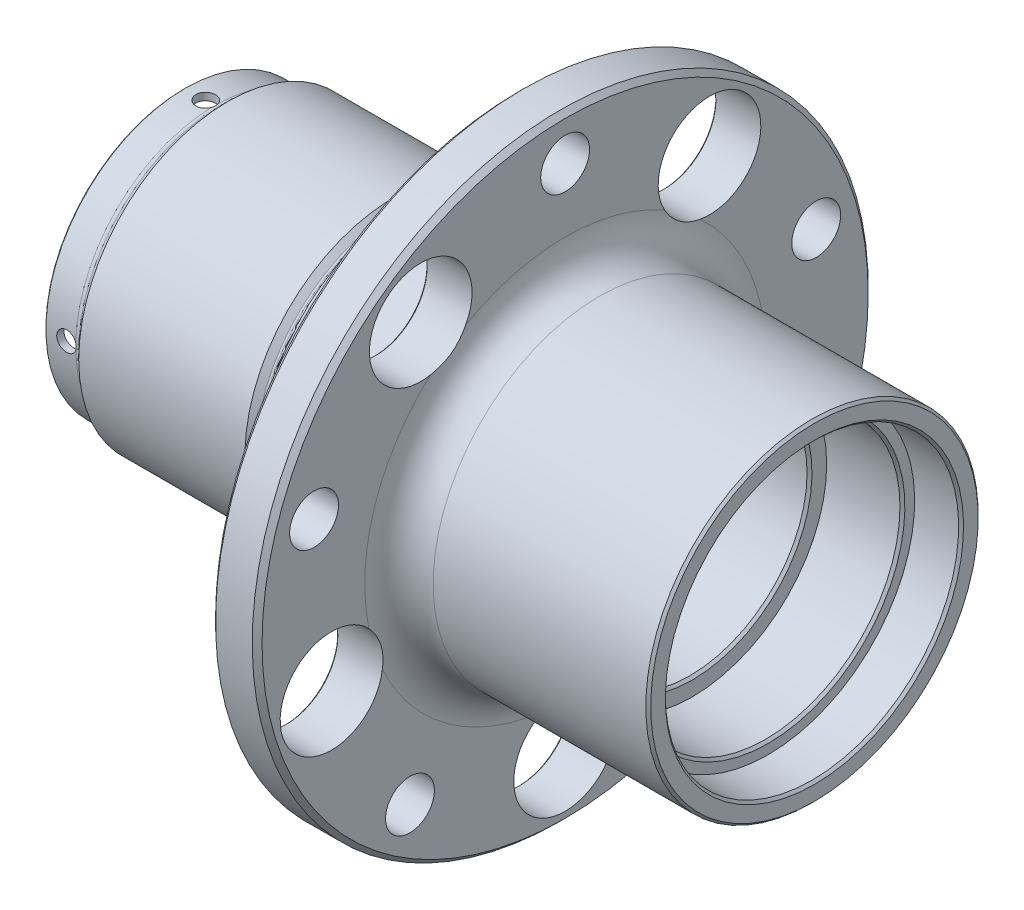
ISO-10303-21;
HEADER;
FILE_DESCRIPTION(('STEP AP214'),'2;1');
FILE_NAME('part.step','',(''),(''),'','','');
FILE_SCHEMA(('AUTOMOTIVE_DESIGN { 1 0 10303 214 1 1 1 1 }'));
ENDSEC;
DATA;
#1=APPLICATION_CONTEXT('core data for automotive mechanical design processes');
#2=APPLICATION_PROTOCOL_DEFINITION('international standard','automotive_design',2000,#1);
#3=PRODUCT_CONTEXT('',#1,'mechanical');
#4=PRODUCT('Part','Part','',(#3));
#5=PRODUCT_RELATED_PRODUCT_CATEGORY('part','',(#4));
#6=PRODUCT_DEFINITION_FORMATION('','',#4);
#7=PRODUCT_DEFINITION_CONTEXT('part definition',#1,'design');
#8=PRODUCT_DEFINITION('design','',#6,#7);
#9=PRODUCT_DEFINITION_SHAPE('','',#8);
#10=(LENGTH_UNIT() NAMED_UNIT(*) SI_UNIT(.MILLI.,.METRE.));
#11=(NAMED_UNIT(*) PLANE_ANGLE_UNIT() SI_UNIT($,.RADIAN.));
#12=(NAMED_UNIT(*) SI_UNIT($,.STERADIAN.) SOLID_ANGLE_UNIT());
#13=UNCERTAINTY_MEASURE_WITH_UNIT(LENGTH_MEASURE(1.E-05),#10,'distance_accuracy_value','');
#14=(GEOMETRIC_REPRESENTATION_CONTEXT(3) GLOBAL_UNCERTAINTY_ASSIGNED_CONTEXT((#13)) GLOBAL_UNIT_ASSIGNED_CONTEXT((#10,
#11,#12)) REPRESENTATION_CONTEXT('',''));
#15=CARTESIAN_POINT('',(0.,0.,0.));
#16=DIRECTION('',(0.,0.,1.));
#17=DIRECTION('',(1.,0.,0.));
#18=AXIS2_PLACEMENT_3D('',#15,#16,#17);
#19=CARTESIAN_POINT('',(0.,27.,0.));
#20=DIRECTION('',(1.,0.,0.));
#21=DIRECTION('',(0.,1.,0.));
#22=AXIS2_PLACEMENT_3D('',#19,#20,#21);
#23=PLANE('',#22);
#24=CARTESIAN_POINT('',(0.,0.,0.));
#25=DIRECTION('',(1.,0.,0.));
#26=DIRECTION('',(0.,1.,0.));
#27=AXIS2_PLACEMENT_3D('',#24,#25,#26);
#28=CIRCLE('',#27,27.3);
#29=CARTESIAN_POINT('',(0.,27.3,0.));
#30=VERTEX_POINT('',#29);
#31=EDGE_CURVE('E186',#30,#30,#28,.T.);
#32=ORIENTED_EDGE('',*,*,#31,.T.);
#33=EDGE_LOOP('',(#32));
#34=FACE_BOUND('',#33,.T.);
#35=CARTESIAN_POINT('',(0.,0.,0.));
#36=DIRECTION('',(1.,0.,0.));
#37=DIRECTION('',(0.,1.,0.));
#38=AXIS2_PLACEMENT_3D('',#35,#36,#37);
#39=CIRCLE('',#38,28.2);
#40=CARTESIAN_POINT('',(0.,28.2,0.));
#41=VERTEX_POINT('',#40);
#42=EDGE_CURVE('E182',#41,#41,#39,.F.);
#43=ORIENTED_EDGE('',*,*,#42,.T.);
#44=EDGE_LOOP('',(#43));
#45=FACE_BOUND('',#44,.T.);
#46=ADVANCED_FACE('F39',(#34,#45),#23,.F.);
#47=CARTESIAN_POINT('',(0.,0.,0.));
#48=DIRECTION('',(-1.,0.,0.));
#49=DIRECTION('',(0.,-1.,0.));
#50=AXIS2_PLACEMENT_3D('',#47,#48,#49);
#51=CYLINDRICAL_SURFACE('',#50,28.5);
#52=CARTESIAN_POINT('',(0.299999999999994,0.,0.));
#53=DIRECTION('',(1.,0.,0.));
#54=DIRECTION('',(0.,1.,0.));
#55=AXIS2_PLACEMENT_3D('',#52,#53,#54);
#56=CIRCLE('',#55,28.5);
#57=CARTESIAN_POINT('',(0.299999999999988,28.5,0.));
#58=VERTEX_POINT('',#57);
#59=EDGE_CURVE('E190',#58,#58,#56,.T.);
#60=ORIENTED_EDGE('',*,*,#59,.T.);
#61=EDGE_LOOP('',(#60));
#62=FACE_BOUND('',#61,.T.);
#63=CARTESIAN_POINT('',(6.37867965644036,0.,0.));
#64=DIRECTION('',(-1.,0.,0.));
#65=DIRECTION('',(0.,-1.,0.));
#66=AXIS2_PLACEMENT_3D('',#63,#64,#65);
#67=CIRCLE('',#66,28.5);
#68=CARTESIAN_POINT('',(6.37867965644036,-0.685975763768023,-28.4917433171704));
#69=VERTEX_POINT('',#68);
#70=CARTESIAN_POINT('',(6.37867965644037,-28.4917433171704,-0.685975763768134));
#71=VERTEX_POINT('',#70);
#72=EDGE_CURVE('E415',#69,#71,#67,.T.);
#73=ORIENTED_EDGE('',*,*,#72,.T.);
#74=CARTESIAN_POINT('',(6.50000000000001,-28.5,0.));
#75=CARTESIAN_POINT('',(6.49999507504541,-28.4999990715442,-0.112192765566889));
#76=CARTESIAN_POINT('',(6.49052785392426,-28.4993304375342,-0.2244633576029));
#77=CARTESIAN_POINT('',(6.45289829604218,-28.4967274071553,-0.445902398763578));
#78=CARTESIAN_POINT('',(6.42471439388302,-28.494791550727,-0.555067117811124));
#79=CARTESIAN_POINT('',(6.35046682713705,-28.4898729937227,-0.767054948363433));
#80=CARTESIAN_POINT('',(6.30441282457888,-28.4868908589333,-0.869881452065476));
#81=CARTESIAN_POINT('',(6.19574858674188,-28.480214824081,-1.06631845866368));
#82=CARTESIAN_POINT('',(6.13314205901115,-28.4765210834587,-1.15993101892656));
#83=CARTESIAN_POINT('',(5.99302380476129,-28.4688291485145,-1.33548217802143));
#84=CARTESIAN_POINT('',(5.91548786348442,-28.4648304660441,-1.41740142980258));
#85=CARTESIAN_POINT('',(5.7477622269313,-28.4569834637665,-1.56707489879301));
#86=CARTESIAN_POINT('',(5.6575719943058,-28.4531351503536,-1.63482851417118));
#87=CARTESIAN_POINT('',(5.46698507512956,-28.4460189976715,-1.75430961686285));
#88=CARTESIAN_POINT('',(5.36657803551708,-28.4427517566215,-1.8060206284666));
#89=CARTESIAN_POINT('',(5.15848011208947,-28.4371726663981,-1.89184330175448));
#90=CARTESIAN_POINT('',(5.05078932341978,-28.4348608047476,-1.92595519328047));
#91=CARTESIAN_POINT('',(4.83137058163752,-28.4314579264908,-1.97555655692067));
#92=CARTESIAN_POINT('',(4.7196496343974,-28.4303648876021,-1.99107687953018));
#93=CARTESIAN_POINT('',(4.49518337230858,-28.4295168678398,-2.00314980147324));
#94=CARTESIAN_POINT('',(4.38243807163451,-28.429761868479,-1.99970266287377));
#95=CARTESIAN_POINT('',(4.15933414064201,-28.4315604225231,-1.97396407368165));
#96=CARTESIAN_POINT('',(4.04897163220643,-28.4331116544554,-1.95170605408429));
#97=CARTESIAN_POINT('',(3.83355304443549,-28.4373442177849,-1.88902940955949));
#98=CARTESIAN_POINT('',(3.72849700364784,-28.4400255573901,-1.84861065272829));
#99=CARTESIAN_POINT('',(3.52656638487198,-28.4462188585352,-1.75072209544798));
#100=CARTESIAN_POINT('',(3.4296991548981,-28.4497315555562,-1.69323718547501));
#101=CARTESIAN_POINT('',(3.24697619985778,-28.4571910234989,-1.56285903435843));
#102=CARTESIAN_POINT('',(3.1611206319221,-28.4611378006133,-1.48996557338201));
#103=CARTESIAN_POINT('',(3.00266366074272,-28.469030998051,-1.33065147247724));
#104=CARTESIAN_POINT('',(2.93009133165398,-28.4729773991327,-1.2442019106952));
#105=CARTESIAN_POINT('',(2.80048533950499,-28.4804169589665,-1.06033081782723));
#106=CARTESIAN_POINT('',(2.74345168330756,-28.4839101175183,-0.962909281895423));
#107=CARTESIAN_POINT('',(2.64654425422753,-28.4900499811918,-0.759841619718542));
#108=CARTESIAN_POINT('',(2.60667164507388,-28.4926966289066,-0.654194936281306));
#109=CARTESIAN_POINT('',(2.54523788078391,-28.4968445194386,-0.437684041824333));
#110=CARTESIAN_POINT('',(2.52367645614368,-28.4983457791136,-0.326819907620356));
#111=CARTESIAN_POINT('',(2.49951327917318,-28.5000315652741,-0.10327330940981));
#112=CARTESIAN_POINT('',(2.4968713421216,-28.5002188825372,0.0094047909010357));
#113=CARTESIAN_POINT('',(2.51051704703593,-28.4992631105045,0.233602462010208));
#114=CARTESIAN_POINT('',(2.52680456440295,-28.4981200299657,0.34512204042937));
#115=CARTESIAN_POINT('',(2.57781355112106,-28.4946338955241,0.563723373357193));
#116=CARTESIAN_POINT('',(2.61251652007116,-28.4922920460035,0.670809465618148));
#117=CARTESIAN_POINT('',(2.69935249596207,-28.4866717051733,0.877638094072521));
#118=CARTESIAN_POINT('',(2.75148569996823,-28.483393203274,0.977380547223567));
#119=CARTESIAN_POINT('',(2.87180413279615,-28.4762606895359,1.16687421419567));
#120=CARTESIAN_POINT('',(2.94001612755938,-28.4724057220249,1.25660839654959));
#121=CARTESIAN_POINT('',(3.09051699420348,-28.4645570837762,1.42336668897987));
#122=CARTESIAN_POINT('',(3.17280603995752,-28.4605634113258,1.5003906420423));
#123=CARTESIAN_POINT('',(3.3492988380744,-28.4528793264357,1.63967875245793));
#124=CARTESIAN_POINT('',(3.44352323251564,-28.4491894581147,1.70191678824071));
#125=CARTESIAN_POINT('',(3.64110864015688,-28.4425378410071,1.80968753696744));
#126=CARTESIAN_POINT('',(3.74446958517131,-28.4395760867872,1.85522037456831));
#127=CARTESIAN_POINT('',(3.95729962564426,-28.4347186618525,1.92824322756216));
#128=CARTESIAN_POINT('',(4.06676310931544,-28.4328220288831,1.95574953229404));
#129=CARTESIAN_POINT('',(4.28876853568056,-28.4303060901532,1.99199166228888));
#130=CARTESIAN_POINT('',(4.40131043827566,-28.4296867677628,2.00072773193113));
#131=CARTESIAN_POINT('',(4.62601839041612,-28.4297957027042,1.9991789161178));
#132=CARTESIAN_POINT('',(4.73818472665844,-28.4305210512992,1.98893508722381));
#133=CARTESIAN_POINT('',(4.95920027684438,-28.4332314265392,1.94980254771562));
#134=CARTESIAN_POINT('',(5.06804948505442,-28.4352164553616,1.92091380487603));
#135=CARTESIAN_POINT('',(5.27934585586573,-28.4402217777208,1.84532115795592));
#136=CARTESIAN_POINT('',(5.38179315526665,-28.4432420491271,1.7986176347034));
#137=CARTESIAN_POINT('',(5.57739853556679,-28.4499775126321,1.68872632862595));
#138=CARTESIAN_POINT('',(5.67055682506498,-28.4536926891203,1.62553891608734));
#139=CARTESIAN_POINT('',(5.84514893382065,-28.4614087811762,1.48432033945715));
#140=CARTESIAN_POINT('',(5.92655843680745,-28.4654102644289,1.40625914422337));
#141=CARTESIAN_POINT('',(6.07514803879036,-28.4732430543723,1.23755594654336));
#142=CARTESIAN_POINT('',(6.14232466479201,-28.4770743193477,1.14691088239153));
#143=CARTESIAN_POINT('',(6.26060444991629,-28.4841399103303,0.955486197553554));
#144=CARTESIAN_POINT('',(6.31168427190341,-28.4873733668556,0.854692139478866));
#145=CARTESIAN_POINT('',(6.39613192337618,-28.4928679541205,0.646007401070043));
#146=CARTESIAN_POINT('',(6.42952036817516,-28.4951302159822,0.538125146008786));
#147=CARTESIAN_POINT('',(6.46901787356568,-28.4978387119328,0.357992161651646));
#148=CARTESIAN_POINT('',(6.48062100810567,-28.4986455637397,0.286903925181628));
#149=CARTESIAN_POINT('',(6.49611364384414,-28.4997265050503,0.14388779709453));
#150=CARTESIAN_POINT('',(6.50000315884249,-28.5000005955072,0.0719599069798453));
#151=CARTESIAN_POINT('',(6.50000000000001,-28.5,0.));
#152=B_SPLINE_CURVE_WITH_KNOTS('',3,(#74,#75,#76,#77,#78,#79,#80,#81,#82,#83,#84,#85,#86,#87,
#88,#89,#90,#91,#92,#93,#94,#95,#96,#97,#98,#99,#100,#101,#102,#103,#104,#105,#106,#107,#108,
#109,#110,#111,#112,#113,#114,#115,#116,#117,#118,#119,#120,#121,#122,#123,#124,#125,#126,#127,
#128,#129,#130,#131,#132,#133,#134,#135,#136,#137,#138,#139,#140,#141,#142,#143,#144,#145,#146,
#147,#148,#149,#150,#151),.UNSPECIFIED.,.T.,.F.,(4,2,2,2,2,2,2,2,2,2,2,2,2,2,2,2,2,2,2,2,2,2,2,
2,2,2,2,2,2,2,2,2,2,2,2,2,2,2,4),(0.,0.336315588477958,0.673019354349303,1.00954132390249,
1.34598798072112,1.68298500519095,2.01999634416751,2.3573526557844,2.69470456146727,
3.03149589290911,3.36828257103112,3.70447196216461,4.04066379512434,4.37715416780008,
4.71364934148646,5.05087244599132,5.38809569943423,5.72534181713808,6.06258297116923,
6.39910761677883,6.73563004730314,7.07181504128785,7.40800383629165,7.744756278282,
8.08151287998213,8.41886006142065,8.75620472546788,9.0932441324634,9.43027915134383,
9.76658596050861,10.1028933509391,10.439193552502,10.7754862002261,11.112465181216,
11.449526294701,11.7870738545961,12.124227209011,12.3399388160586,12.5556500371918),.UNSPECIFIED.);
#153=CARTESIAN_POINT('',(6.37867965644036,-28.4917433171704,0.685975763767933));
#154=VERTEX_POINT('',#153);
#155=EDGE_CURVE('E360',#71,#154,#152,.T.);
#156=ORIENTED_EDGE('',*,*,#155,.T.);
#157=CARTESIAN_POINT('',(6.37867965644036,-0.685975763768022,28.4917433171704));
#158=VERTEX_POINT('',#157);
#159=EDGE_CURVE('E408',#154,#158,#67,.T.);
#160=ORIENTED_EDGE('',*,*,#159,.T.);
#161=CARTESIAN_POINT('',(2.5,0.,28.5));
#162=CARTESIAN_POINT('',(2.5000049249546,0.11219276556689,28.4999990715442));
#163=CARTESIAN_POINT('',(2.50947214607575,0.2244633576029,28.4993304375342));
#164=CARTESIAN_POINT('',(2.54710170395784,0.445902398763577,28.4967274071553));
#165=CARTESIAN_POINT('',(2.57528560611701,0.555067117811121,28.494791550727));
#166=CARTESIAN_POINT('',(2.64953317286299,0.767054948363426,28.4898729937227));
#167=CARTESIAN_POINT('',(2.69558717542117,0.869881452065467,28.4868908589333));
#168=CARTESIAN_POINT('',(2.80425141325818,1.06631845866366,28.480214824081));
#169=CARTESIAN_POINT('',(2.86685794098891,1.15993101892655,28.4765210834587));
#170=CARTESIAN_POINT('',(3.00697619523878,1.33548217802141,28.4688291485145));
#171=CARTESIAN_POINT('',(3.08451213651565,1.41740142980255,28.4648304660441));
#172=CARTESIAN_POINT('',(3.25223777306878,1.56707489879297,28.4569834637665));
#173=CARTESIAN_POINT('',(3.34242800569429,1.63482851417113,28.4531351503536));
#174=CARTESIAN_POINT('',(3.53301492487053,1.7543096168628,28.4460189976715));
#175=CARTESIAN_POINT('',(3.63342196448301,1.80602062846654,28.4427517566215));
#176=CARTESIAN_POINT('',(3.84151988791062,1.89184330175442,28.4371726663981));
#177=CARTESIAN_POINT('',(3.94921067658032,1.9259551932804,28.4348608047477));
#178=CARTESIAN_POINT('',(4.16862941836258,1.97555655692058,28.4314579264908));
#179=CARTESIAN_POINT('',(4.2803503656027,1.99107687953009,28.4303648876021));
#180=CARTESIAN_POINT('',(4.50481662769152,2.00314980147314,28.4295168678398));
#181=CARTESIAN_POINT('',(4.61756192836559,1.99970266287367,28.429761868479));
#182=CARTESIAN_POINT('',(4.84066585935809,1.97396407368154,28.4315604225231));
#183=CARTESIAN_POINT('',(4.95102836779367,1.95170605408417,28.4331116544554));
#184=CARTESIAN_POINT('',(5.16644695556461,1.88902940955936,28.4373442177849));
#185=CARTESIAN_POINT('',(5.27150299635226,1.84861065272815,28.4400255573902));
#186=CARTESIAN_POINT('',(5.47343361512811,1.75072209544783,28.4462188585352));
#187=CARTESIAN_POINT('',(5.57030084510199,1.69323718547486,28.4497315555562));
#188=CARTESIAN_POINT('',(5.7530238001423,1.56285903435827,28.4571910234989));
#189=CARTESIAN_POINT('',(5.83887936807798,1.48996557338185,28.4611378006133));
#190=CARTESIAN_POINT('',(5.99733633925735,1.33065147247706,28.469030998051));
#191=CARTESIAN_POINT('',(6.06990866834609,1.24420191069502,28.4729773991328));
#192=CARTESIAN_POINT('',(6.19951466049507,1.06033081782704,28.4804169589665));
#193=CARTESIAN_POINT('',(6.25654831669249,0.962909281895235,28.4839101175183));
#194=CARTESIAN_POINT('',(6.35345574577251,0.759841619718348,28.4900499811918));
#195=CARTESIAN_POINT('',(6.39332835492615,0.654194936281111,28.4926966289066));
#196=CARTESIAN_POINT('',(6.45476211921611,0.437684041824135,28.4968445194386));
#197=CARTESIAN_POINT('',(6.47632354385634,0.326819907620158,28.4983457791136));
#198=CARTESIAN_POINT('',(6.50048672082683,0.103273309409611,28.5000315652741));
#199=CARTESIAN_POINT('',(6.5031286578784,-0.00940479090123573,28.5002188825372));
#200=CARTESIAN_POINT('',(6.48948295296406,-0.233602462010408,28.4992631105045));
#201=CARTESIAN_POINT('',(6.47319543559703,-0.345122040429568,28.4981200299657));
#202=CARTESIAN_POINT('',(6.42218644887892,-0.563723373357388,28.4946338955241));
#203=CARTESIAN_POINT('',(6.38748347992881,-0.670809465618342,28.4922920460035));
#204=CARTESIAN_POINT('',(6.30064750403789,-0.87763809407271,28.4866717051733));
#205=CARTESIAN_POINT('',(6.24851430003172,-0.977380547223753,28.483393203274));
#206=CARTESIAN_POINT('',(6.12819586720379,-1.16687421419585,28.4762606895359));
#207=CARTESIAN_POINT('',(6.05998387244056,-1.25660839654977,28.4724057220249));
#208=CARTESIAN_POINT('',(5.90948300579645,-1.42336668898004,28.4645570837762));
#209=CARTESIAN_POINT('',(5.8271939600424,-1.50039064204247,28.4605634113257));
#210=CARTESIAN_POINT('',(5.65070116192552,-1.63967875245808,28.4528793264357));
#211=CARTESIAN_POINT('',(5.55647676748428,-1.70191678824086,28.4491894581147));
#212=CARTESIAN_POINT('',(5.35889135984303,-1.80968753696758,28.4425378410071));
#213=CARTESIAN_POINT('',(5.2555304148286,-1.85522037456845,28.4395760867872));
#214=CARTESIAN_POINT('',(5.04270037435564,-1.92824322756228,28.4347186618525));
#215=CARTESIAN_POINT('',(4.93323689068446,-1.95574953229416,28.432822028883));
#216=CARTESIAN_POINT('',(4.71123146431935,-1.99199166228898,28.4303060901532));
#217=CARTESIAN_POINT('',(4.59868956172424,-2.00072773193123,28.4296867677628));
#218=CARTESIAN_POINT('',(4.37398160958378,-1.99917891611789,28.4297957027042));
#219=CARTESIAN_POINT('',(4.26181527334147,-1.98893508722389,28.4305210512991));
#220=CARTESIAN_POINT('',(4.04079972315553,-1.9498025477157,28.4332314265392));
#221=CARTESIAN_POINT('',(3.93195051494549,-1.9209138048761,28.4352164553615));
#222=CARTESIAN_POINT('',(3.72065414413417,-1.84532115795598,28.4402217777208));
#223=CARTESIAN_POINT('',(3.61820684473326,-1.79861763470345,28.4432420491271));
#224=CARTESIAN_POINT('',(3.42260146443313,-1.68872632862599,28.4499775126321));
#225=CARTESIAN_POINT('',(3.32944317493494,-1.62553891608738,28.4536926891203));
#226=CARTESIAN_POINT('',(3.15485106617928,-1.48432033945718,28.4614087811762));
#227=CARTESIAN_POINT('',(3.07344156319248,-1.40625914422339,28.4654102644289));
#228=CARTESIAN_POINT('',(2.92485196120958,-1.23755594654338,28.4732430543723));
#229=CARTESIAN_POINT('',(2.85767533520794,-1.14691088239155,28.4770743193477));
#230=CARTESIAN_POINT('',(2.73939555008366,-0.955486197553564,28.4841399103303));
#231=CARTESIAN_POINT('',(2.68831572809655,-0.854692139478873,28.4873733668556));
#232=CARTESIAN_POINT('',(2.60386807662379,-0.646007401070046,28.4928679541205));
#233=CARTESIAN_POINT('',(2.57047963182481,-0.538125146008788,28.4951302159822));
#234=CARTESIAN_POINT('',(2.53098212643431,-0.357992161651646,28.4978387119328));
#235=CARTESIAN_POINT('',(2.51937899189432,-0.286903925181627,28.4986455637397));
#236=CARTESIAN_POINT('',(2.50388635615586,-0.143887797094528,28.4997265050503));
#237=CARTESIAN_POINT('',(2.49999684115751,-0.071959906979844,28.5000005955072));
#238=CARTESIAN_POINT('',(2.5,0.,28.5));
#239=B_SPLINE_CURVE_WITH_KNOTS('',3,(#161,#162,#163,#164,#165,#166,#167,#168,#169,#170,#171,
#172,#173,#174,#175,#176,#177,#178,#179,#180,#181,#182,#183,#184,#185,#186,#187,#188,#189,#190,
#191,#192,#193,#194,#195,#196,#197,#198,#199,#200,#201,#202,#203,#204,#205,#206,#207,#208,#209,
#210,#211,#212,#213,#214,#215,#216,#217,#218,#219,#220,#221,#222,#223,#224,#225,#226,#227,#228,
#229,#230,#231,#232,#233,#234,#235,#236,#237,#238),.UNSPECIFIED.,.T.,.F.,(4,2,2,2,2,2,2,2,2,2,2,
2,2,2,2,2,2,2,2,2,2,2,2,2,2,2,2,2,2,2,2,2,2,2,2,2,2,2,4),(0.,0.336315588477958,
0.673019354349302,1.00954132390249,1.34598798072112,1.68298500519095,2.01999634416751,
2.3573526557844,2.69470456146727,3.03149589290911,3.36828257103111,3.70447196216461,
4.04066379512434,4.37715416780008,4.71364934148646,5.05087244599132,5.38809569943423,
5.72534181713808,6.06258297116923,6.39910761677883,6.73563004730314,7.07181504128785,
7.40800383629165,7.74475627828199,8.08151287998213,8.41886006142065,8.75620472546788,
9.09324413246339,9.43027915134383,9.76658596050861,10.1028933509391,10.439193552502,
10.7754862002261,11.112465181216,11.449526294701,11.7870738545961,12.124227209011,
12.3399388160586,12.5556500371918),.UNSPECIFIED.);
#240=CARTESIAN_POINT('',(6.37867965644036,0.685975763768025,28.4917433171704));
#241=VERTEX_POINT('',#240);
#242=EDGE_CURVE('E67',#158,#241,#239,.T.);
#243=ORIENTED_EDGE('',*,*,#242,.T.);
#244=CARTESIAN_POINT('',(6.37867965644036,28.4917433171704,0.685975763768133));
#245=VERTEX_POINT('',#244);
#246=EDGE_CURVE('E406',#241,#245,#67,.T.);
#247=ORIENTED_EDGE('',*,*,#246,.T.);
#248=CARTESIAN_POINT('',(4.5,28.429737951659,-1.9999999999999));
#249=CARTESIAN_POINT('',(4.61219238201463,28.4297388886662,-1.99999507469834));
#250=CARTESIAN_POINT('',(4.72446259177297,28.4304092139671,-1.99052791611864));
#251=CARTESIAN_POINT('',(4.94590083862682,28.4330182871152,-1.95289862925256));
#252=CARTESIAN_POINT('',(5.05506514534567,28.4349584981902,-1.92471493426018));
#253=CARTESIAN_POINT('',(5.26705210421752,28.4398865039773,-1.85046797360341));
#254=CARTESIAN_POINT('',(5.36987815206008,28.4428737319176,-1.80441437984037));
#255=CARTESIAN_POINT('',(5.56631439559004,28.4495584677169,-1.69575110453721));
#256=CARTESIAN_POINT('',(5.65992664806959,28.4532558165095,-1.63314512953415));
#257=CARTESIAN_POINT('',(5.83547815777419,28.4609519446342,-1.49302743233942));
#258=CARTESIAN_POINT('',(5.91739796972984,28.46495120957,-1.41549137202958));
#259=CARTESIAN_POINT('',(6.0670725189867,28.4727960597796,-1.24776526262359));
#260=CARTESIAN_POINT('',(6.13482665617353,28.476641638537,-1.15757467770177));
#261=CARTESIAN_POINT('',(6.25430830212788,28.4837501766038,-0.966987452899));
#262=CARTESIAN_POINT('',(6.30601943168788,28.4870125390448,-0.866580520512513));
#263=CARTESIAN_POINT('',(6.39184235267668,28.4925818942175,-0.658482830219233));
#264=CARTESIAN_POINT('',(6.42595437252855,28.494888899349,-0.550792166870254));
#265=CARTESIAN_POINT('',(6.47555600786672,28.4982842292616,-0.331373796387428));
#266=CARTESIAN_POINT('',(6.49107648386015,28.4993745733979,-0.219653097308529));
#267=CARTESIAN_POINT('',(6.50314979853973,28.5002205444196,0.00481267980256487));
#268=CARTESIAN_POINT('',(6.49970289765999,28.4999761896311,0.117557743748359));
#269=CARTESIAN_POINT('',(6.47396468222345,28.4981819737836,0.340662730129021));
#270=CARTESIAN_POINT('',(6.4517065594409,28.4966344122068,0.451026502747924));
#271=CARTESIAN_POINT('',(6.38902926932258,28.4924106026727,0.666447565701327));
#272=CARTESIAN_POINT('',(6.34860997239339,28.4897343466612,0.771504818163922));
#273=CARTESIAN_POINT('',(6.25072030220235,28.4835504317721,0.973436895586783));
#274=CARTESIAN_POINT('',(6.19323494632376,28.4800420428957,1.07030443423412));
#275=CARTESIAN_POINT('',(6.0628558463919,28.4725885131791,1.25302781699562));
#276=CARTESIAN_POINT('',(5.98996188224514,28.4686433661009,1.33888350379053));
#277=CARTESIAN_POINT('',(5.83064742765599,28.4607500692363,1.49733989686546));
#278=CARTESIAN_POINT('',(5.74419811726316,28.4568019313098,1.5699116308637));
#279=CARTESIAN_POINT('',(5.56032773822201,28.44935625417,1.69951654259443));
#280=CARTESIAN_POINT('',(5.46290666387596,28.4458587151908,1.75654971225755));
#281=CARTESIAN_POINT('',(5.25983911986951,28.4397093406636,1.85345679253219));
#282=CARTESIAN_POINT('',(5.15419202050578,28.4370575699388,1.89332938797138));
#283=CARTESIAN_POINT('',(4.93768022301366,28.4329009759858,1.95476299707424));
#284=CARTESIAN_POINT('',(4.82681560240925,28.4313961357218,1.97632428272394));
#285=CARTESIAN_POINT('',(4.60326878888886,28.4297063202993,2.00048693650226));
#286=CARTESIAN_POINT('',(4.49059097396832,28.4295185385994,2.00312862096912));
#287=CARTESIAN_POINT('',(4.26639393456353,28.4304766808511,1.98948251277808));
#288=CARTESIAN_POINT('',(4.15487470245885,28.4316225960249,1.97319484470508));
#289=CARTESIAN_POINT('',(3.93627503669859,28.43511644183,1.92218590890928));
#290=CARTESIAN_POINT('',(3.82919022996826,28.4374631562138,1.88748329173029));
#291=CARTESIAN_POINT('',(3.62236401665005,28.4430931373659,1.80064845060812));
#292=CARTESIAN_POINT('',(3.52262269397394,28.4463764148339,1.74851602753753));
#293=CARTESIAN_POINT('',(3.33312978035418,28.4535163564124,1.62819873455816));
#294=CARTESIAN_POINT('',(3.24339534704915,28.457373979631,1.55998690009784));
#295=CARTESIAN_POINT('',(3.07663647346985,28.4652246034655,1.40948621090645));
#296=CARTESIAN_POINT('',(2.9996121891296,28.4692176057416,1.32719718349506));
#297=CARTESIAN_POINT('',(2.86032338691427,28.4768973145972,1.15070423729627));
#298=CARTESIAN_POINT('',(2.79808499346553,28.4805834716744,1.05647967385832));
#299=CARTESIAN_POINT('',(2.69031361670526,28.487226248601,0.858893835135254));
#300=CARTESIAN_POINT('',(2.64478050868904,28.4901828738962,0.755532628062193));
#301=CARTESIAN_POINT('',(2.5717574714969,28.4950308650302,0.542702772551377));
#302=CARTESIAN_POINT('',(2.54425113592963,28.4969231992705,0.433239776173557));
#303=CARTESIAN_POINT('',(2.50800877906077,28.4994332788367,0.211235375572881));
#304=CARTESIAN_POINT('',(2.49927251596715,28.5000510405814,0.098694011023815));
#305=CARTESIAN_POINT('',(2.50082077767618,28.4999424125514,-0.126014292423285));
#306=CARTESIAN_POINT('',(2.51106447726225,28.4992189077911,-0.238181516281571));
#307=CARTESIAN_POINT('',(2.550197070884,28.4965147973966,-0.459198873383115));
#308=CARTESIAN_POINT('',(2.57908599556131,28.4945341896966,-0.568049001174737));
#309=CARTESIAN_POINT('',(2.65467934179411,28.4895383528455,-0.77934717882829));
#310=CARTESIAN_POINT('',(2.70138338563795,28.4865231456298,-0.881795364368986));
#311=CARTESIAN_POINT('',(2.8112760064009,28.4797962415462,-1.07740229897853));
#312=CARTESIAN_POINT('',(2.87446421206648,28.4760845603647,-1.17056125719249));
#313=CARTESIAN_POINT('',(3.01568364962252,28.4683724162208,-1.34515329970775));
#314=CARTESIAN_POINT('',(3.09374473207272,28.4643713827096,-1.42656221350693));
#315=CARTESIAN_POINT('',(3.26244746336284,28.4565361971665,-1.57515067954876));
#316=CARTESIAN_POINT('',(3.3530921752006,28.4527020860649,-1.64232675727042));
#317=CARTESIAN_POINT('',(3.54451658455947,28.4456287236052,-1.7606059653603));
#318=CARTESIAN_POINT('',(3.6453107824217,28.4423903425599,-1.8116856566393));
#319=CARTESIAN_POINT('',(3.8539958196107,28.4368860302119,-1.89613302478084));
#320=CARTESIAN_POINT('',(3.96187823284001,28.4346189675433,-1.92952131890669));
#321=CARTESIAN_POINT('',(4.14201081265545,28.4319044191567,-1.96901839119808));
#322=CARTESIAN_POINT('',(4.21309845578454,28.4310956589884,-1.98062133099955));
#323=CARTESIAN_POINT('',(4.35611339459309,28.4300121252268,-1.99611370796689));
#324=CARTESIAN_POINT('',(4.42804068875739,28.4297373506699,-2.00000315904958));
#325=CARTESIAN_POINT('',(4.5,28.429737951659,-1.9999999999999));
#326=B_SPLINE_CURVE_WITH_KNOTS('',3,(#248,#249,#250,#251,#252,#253,#254,#255,#256,#257,#258,
#259,#260,#261,#262,#263,#264,#265,#266,#267,#268,#269,#270,#271,#272,#273,#274,#275,#276,#277,
#278,#279,#280,#281,#282,#283,#284,#285,#286,#287,#288,#289,#290,#291,#292,#293,#294,#295,#296,
#297,#298,#299,#300,#301,#302,#303,#304,#305,#306,#307,#308,#309,#310,#311,#312,#313,#314,#315,
#316,#317,#318,#319,#320,#321,#322,#323,#324,#325),.UNSPECIFIED.,.T.,.F.,(4,2,2,2,2,2,2,2,2,2,2,
2,2,2,2,2,2,2,2,2,2,2,2,2,2,2,2,2,2,2,2,2,2,2,2,2,2,2,4),(0.,0.336314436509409,
0.673017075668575,1.00953773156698,1.34598309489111,1.6829816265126,2.01999443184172,
2.35735018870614,2.69470156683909,3.03149218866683,3.36827818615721,3.70447117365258,
4.04066656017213,4.37715797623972,4.7136541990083,5.05087579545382,5.3880975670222,
5.72534517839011,6.06258778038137,6.39911152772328,6.73563306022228,7.07181441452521,
7.40799960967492,7.74475263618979,8.08150979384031,8.41885759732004,8.75620288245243,
9.09324071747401,9.4302742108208,9.76658359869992,10.1028935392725,10.4391963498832,
10.7754915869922,11.1124690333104,11.4495286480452,11.7870768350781,12.1242307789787,
12.3399406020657,12.5556500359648),.UNSPECIFIED.);
#327=CARTESIAN_POINT('',(6.37867965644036,28.4917433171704,-0.685975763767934));
#328=VERTEX_POINT('',#327);
#329=EDGE_CURVE('E60',#245,#328,#326,.T.);
#330=ORIENTED_EDGE('',*,*,#329,.T.);
#331=CARTESIAN_POINT('',(6.37867965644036,0.685975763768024,-28.4917433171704));
#332=VERTEX_POINT('',#331);
#333=EDGE_CURVE('E411',#328,#332,#67,.T.);
#334=ORIENTED_EDGE('',*,*,#333,.T.);
#335=CARTESIAN_POINT('',(6.37867965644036,0.685975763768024,-28.4917433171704));
#336=CARTESIAN_POINT('',(6.35937248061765,0.738851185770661,-28.490470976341));
#337=CARTESIAN_POINT('',(6.33784267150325,0.790882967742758,-28.4890701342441));
#338=CARTESIAN_POINT('',(6.29048180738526,0.89294050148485,-28.4860537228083));
#339=CARTESIAN_POINT('',(6.26465100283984,0.942966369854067,-28.4844381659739));
#340=CARTESIAN_POINT('',(6.18100931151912,1.08940860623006,-28.4793380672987));
#341=CARTESIAN_POINT('',(6.11698596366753,1.18236208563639,-28.4755957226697));
#342=CARTESIAN_POINT('',(5.97425522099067,1.35618630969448,-28.467847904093));
#343=CARTESIAN_POINT('',(5.89554164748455,1.43705194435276,-28.4638423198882));
#344=CARTESIAN_POINT('',(5.72565697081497,1.58442415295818,-28.4560196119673));
#345=CARTESIAN_POINT('',(5.63448813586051,1.6509333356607,-28.452202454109));
#346=CARTESIAN_POINT('',(5.44220863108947,1.76774046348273,-28.4451847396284));
#347=CARTESIAN_POINT('',(5.34109241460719,1.81802929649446,-28.441984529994));
#348=CARTESIAN_POINT('',(5.13180942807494,1.90091681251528,-28.4365653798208));
#349=CARTESIAN_POINT('',(5.02364171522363,1.93351312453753,-28.4343465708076));
#350=CARTESIAN_POINT('',(4.80354568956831,1.98002249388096,-28.4311459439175));
#351=CARTESIAN_POINT('',(4.69162443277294,1.99396879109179,-28.4301619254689));
#352=CARTESIAN_POINT('',(4.4670323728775,2.00288347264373,-28.4295353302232));
#353=CARTESIAN_POINT('',(4.35436162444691,1.99785322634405,-28.4298926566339));
#354=CARTESIAN_POINT('',(4.13166086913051,1.96898772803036,-28.4319062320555));
#355=CARTESIAN_POINT('',(4.02162675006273,1.94518403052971,-28.4335603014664));
#356=CARTESIAN_POINT('',(3.80711707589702,1.87949359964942,-28.4379777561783));
#357=CARTESIAN_POINT('',(3.70264167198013,1.83760637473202,-28.4407411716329));
#358=CARTESIAN_POINT('',(3.50209924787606,1.73689286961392,-28.4470690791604));
#359=CARTESIAN_POINT('',(3.4060406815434,1.67804980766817,-28.4506343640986));
#360=CARTESIAN_POINT('',(3.22515173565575,1.54510867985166,-28.458163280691));
#361=CARTESIAN_POINT('',(3.14032145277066,1.47101048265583,-28.4621269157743));
#362=CARTESIAN_POINT('',(2.9841072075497,1.30947320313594,-28.470016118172));
#363=CARTESIAN_POINT('',(2.91275238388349,1.2220059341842,-28.4739415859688));
#364=CARTESIAN_POINT('',(2.78573588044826,1.03631650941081,-28.4813038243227));
#365=CARTESIAN_POINT('',(2.73007421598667,0.938094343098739,-28.484740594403));
#366=CARTESIAN_POINT('',(2.63603340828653,0.733679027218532,-28.4907381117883));
#367=CARTESIAN_POINT('',(2.59765329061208,0.627486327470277,-28.4932989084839));
#368=CARTESIAN_POINT('',(2.53927461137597,0.410142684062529,-28.4972558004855));
#369=CARTESIAN_POINT('',(2.51927577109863,0.298991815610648,-28.4986519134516));
#370=CARTESIAN_POINT('',(2.49825977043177,0.0751430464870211,-28.5001202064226));
#371=CARTESIAN_POINT('',(2.49720185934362,-0.0375510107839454,-28.5001952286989));
#372=CARTESIAN_POINT('',(2.51399377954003,-0.26151381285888,-28.4990202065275));
#373=CARTESIAN_POINT('',(2.53184349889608,-0.37278256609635,-28.4977701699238));
#374=CARTESIAN_POINT('',(2.58591179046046,-0.590636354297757,-28.4940873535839));
#375=CARTESIAN_POINT('',(2.62211396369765,-0.697225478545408,-28.4916556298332));
#376=CARTESIAN_POINT('',(2.71184377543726,-0.902816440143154,-28.4858826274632));
#377=CARTESIAN_POINT('',(2.76537162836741,-1.00181818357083,-28.4825413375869));
#378=CARTESIAN_POINT('',(2.88834313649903,-1.18961403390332,-28.4753169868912));
#379=CARTESIAN_POINT('',(2.95781454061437,-1.27838993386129,-28.4714329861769));
#380=CARTESIAN_POINT('',(3.11065776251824,-1.4430334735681,-28.4635637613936));
#381=CARTESIAN_POINT('',(3.19402971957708,-1.51890098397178,-28.4595785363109));
#382=CARTESIAN_POINT('',(3.3724760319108,-1.65570226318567,-28.4519483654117));
#383=CARTESIAN_POINT('',(3.46756975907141,-1.71661079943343,-28.4483040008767));
#384=CARTESIAN_POINT('',(3.66665947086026,-1.8215948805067,-28.4417751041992));
#385=CARTESIAN_POINT('',(3.77065542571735,-1.86567048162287,-28.4388905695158));
#386=CARTESIAN_POINT('',(3.98448928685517,-1.93568918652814,-28.43421084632));
#387=CARTESIAN_POINT('',(4.09432116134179,-1.96165063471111,-28.4324145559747));
#388=CARTESIAN_POINT('',(4.31679651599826,-1.99476410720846,-28.4301107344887));
#389=CARTESIAN_POINT('',(4.42943993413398,-2.00191654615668,-28.4296031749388));
#390=CARTESIAN_POINT('',(4.65408627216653,-1.99721128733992,-28.4299340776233));
#391=CARTESIAN_POINT('',(4.76609004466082,-1.98539397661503,-28.4307696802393));
#392=CARTESIAN_POINT('',(4.98651842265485,-1.94316561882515,-28.4336868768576));
#393=CARTESIAN_POINT('',(5.09494302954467,-1.91275457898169,-28.4357684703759));
#394=CARTESIAN_POINT('',(5.30514678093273,-1.83421066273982,-28.4409425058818));
#395=CARTESIAN_POINT('',(5.40692572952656,-1.78607726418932,-28.4440349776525));
#396=CARTESIAN_POINT('',(5.60098138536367,-1.67344712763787,-28.4508829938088));
#397=CARTESIAN_POINT('',(5.69325688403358,-1.60894831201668,-28.4546386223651));
#398=CARTESIAN_POINT('',(5.8659078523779,-1.46524686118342,-28.4624003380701));
#399=CARTESIAN_POINT('',(5.9462530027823,-1.38600787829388,-28.4664070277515));
#400=CARTESIAN_POINT('',(6.092468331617,-1.21517890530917,-28.474209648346));
#401=CARTESIAN_POINT('',(6.15834959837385,-1.12359846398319,-28.4780057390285));
#402=CARTESIAN_POINT('',(6.24849229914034,-0.973024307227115,-28.4834368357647));
#403=CARTESIAN_POINT('',(6.27834920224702,-0.917312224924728,-28.4852904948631));
#404=CARTESIAN_POINT('',(6.33262318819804,-0.803408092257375,-28.4887309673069));
#405=CARTESIAN_POINT('',(6.35704950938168,-0.745220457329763,-28.4903182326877));
#406=CARTESIAN_POINT('',(6.37867965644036,-0.685975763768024,-28.4917433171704));
#407=B_SPLINE_CURVE_WITH_KNOTS('',3,(#335,#336,#337,#338,#339,#340,#341,#342,#343,#344,#345,
#346,#347,#348,#349,#350,#351,#352,#353,#354,#355,#356,#357,#358,#359,#360,#361,#362,#363,#364,
#365,#366,#367,#368,#369,#370,#371,#372,#373,#374,#375,#376,#377,#378,#379,#380,#381,#382,#383,
#384,#385,#386,#387,#388,#389,#390,#391,#392,#393,#394,#395,#396,#397,#398,#399,#400,#401,#402,
#403,#404,#405,#406),.UNSPECIFIED.,.F.,.F.,(4,2,2,2,2,2,2,2,2,2,2,2,2,2,2,2,2,2,2,2,2,2,2,2,2,2,
2,2,2,2,2,2,2,2,2,4),(0.,0.168809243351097,0.337608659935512,0.674663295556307,1.01186001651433,
1.34899541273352,1.68631987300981,2.02368952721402,2.36045708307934,2.6972003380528,
3.03337879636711,3.36956639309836,3.70608787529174,4.04261225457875,4.37985618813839,
4.71710045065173,5.0543256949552,5.39154582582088,5.7280403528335,6.06453288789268,
6.40072527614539,6.73692182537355,7.07370800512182,7.41049755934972,7.74785136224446,
8.08520403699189,8.42221457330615,8.75921768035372,9.0955042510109,9.43179069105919,
9.76808703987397,10.1044261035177,10.4416058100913,10.7785261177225,10.9679782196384,
11.157105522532),.UNSPECIFIED.);
#408=EDGE_CURVE('E624',#332,#69,#407,.T.);
#409=ORIENTED_EDGE('',*,*,#408,.T.);
#410=EDGE_LOOP('',(#73,#156,#160,#243,#247,#330,#334,#409));
#411=FACE_BOUND('',#410,.T.);
#412=ADVANCED_FACE('F405',(#62,#411),#51,.T.);
#413=CARTESIAN_POINT('',(9.,0.,0.));
#414=DIRECTION('',(1.,0.,0.));
#415=DIRECTION('',(0.,1.,0.));
#416=AXIS2_PLACEMENT_3D('',#413,#414,#415);
#417=CONICAL_SURFACE('',#416,30.5,0.785398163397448);
#418=CARTESIAN_POINT('',(7.43933982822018,0.,0.));
#419=DIRECTION('',(1.,0.,0.));
#420=DIRECTION('',(0.,1.,0.));
#421=AXIS2_PLACEMENT_3D('',#418,#419,#420);
#422=CIRCLE('',#421,28.9393398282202);
#423=CARTESIAN_POINT('',(7.43933982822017,28.9393398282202,0.));
#424=VERTEX_POINT('',#423);
#425=EDGE_CURVE('E419',#424,#424,#422,.T.);
#426=ORIENTED_EDGE('',*,*,#425,.T.);
#427=EDGE_LOOP('',(#426));
#428=FACE_BOUND('',#427,.T.);
#429=CARTESIAN_POINT('',(9.,0.,0.));
#430=DIRECTION('',(-1.,0.,0.));
#431=DIRECTION('',(0.,-1.,0.));
#432=AXIS2_PLACEMENT_3D('',#429,#430,#431);
#433=CIRCLE('',#432,30.5);
#434=CARTESIAN_POINT('',(9.00000000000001,-30.5,0.));
#435=VERTEX_POINT('',#434);
#436=EDGE_CURVE('E464',#435,#435,#433,.T.);
#437=ORIENTED_EDGE('',*,*,#436,.T.);
#438=EDGE_LOOP('',(#437));
#439=FACE_BOUND('',#438,.T.);
#440=ADVANCED_FACE('F442',(#428,#439),#417,.T.);
#441=CARTESIAN_POINT('',(0.,0.,0.));
#442=DIRECTION('',(-1.,0.,0.));
#443=DIRECTION('',(0.,-1.,0.));
#444=AXIS2_PLACEMENT_3D('',#441,#442,#443);
#445=CYLINDRICAL_SURFACE('',#444,30.5);
#446=CARTESIAN_POINT('',(27.75,-30.5,0.));
#447=CARTESIAN_POINT('',(27.7499891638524,-30.4999956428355,-0.265089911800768));
#448=CARTESIAN_POINT('',(27.7277336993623,-30.4965078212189,-0.530330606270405));
#449=CARTESIAN_POINT('',(27.639327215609,-30.482929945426,-1.0533897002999));
#450=CARTESIAN_POINT('',(27.5731342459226,-30.4728335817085,-1.31120076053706));
#451=CARTESIAN_POINT('',(27.3988856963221,-30.4471725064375,-1.81175588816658));
#452=CARTESIAN_POINT('',(27.2908626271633,-30.4316120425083,-2.05451148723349));
#453=CARTESIAN_POINT('',(27.0361016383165,-30.3967393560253,-2.51841603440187));
#454=CARTESIAN_POINT('',(26.8893687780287,-30.3774276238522,-2.73956780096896));
#455=CARTESIAN_POINT('',(26.5600416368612,-30.3370164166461,-3.15587860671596));
#456=CARTESIAN_POINT('',(26.3771863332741,-30.3159046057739,-3.35082998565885));
#457=CARTESIAN_POINT('',(25.9813666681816,-30.2743685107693,-3.70741368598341));
#458=CARTESIAN_POINT('',(25.7684005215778,-30.2539442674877,-3.86904403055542));
#459=CARTESIAN_POINT('',(25.3169986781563,-30.2159762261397,-4.15521399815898));
#460=CARTESIAN_POINT('',(25.0784332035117,-30.1984483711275,-4.27955120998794));
#461=CARTESIAN_POINT('',(24.5834855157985,-30.1684270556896,-4.48631162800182));
#462=CARTESIAN_POINT('',(24.3271043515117,-30.1559332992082,-4.56873729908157));
#463=CARTESIAN_POINT('',(23.8059929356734,-30.1375165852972,-4.68868678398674));
#464=CARTESIAN_POINT('',(23.5413466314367,-30.131541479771,-4.72656714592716));
#465=CARTESIAN_POINT('',(23.0093917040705,-30.1266804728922,-4.7574555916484));
#466=CARTESIAN_POINT('',(22.7420832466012,-30.1277941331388,-4.75046645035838));
#467=CARTESIAN_POINT('',(22.2149194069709,-30.136937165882,-4.69210534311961));
#468=CARTESIAN_POINT('',(21.9550187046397,-30.1449044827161,-4.64113161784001));
#469=CARTESIAN_POINT('',(21.4475044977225,-30.1667601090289,-4.49687222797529));
#470=CARTESIAN_POINT('',(21.199891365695,-30.180648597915,-4.40358528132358));
#471=CARTESIAN_POINT('',(20.722775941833,-30.2128497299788,-4.17693681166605));
#472=CARTESIAN_POINT('',(20.493354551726,-30.2311808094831,-4.04340771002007));
#473=CARTESIAN_POINT('',(20.060023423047,-30.2701885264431,-3.74018455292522));
#474=CARTESIAN_POINT('',(19.8561154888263,-30.2908653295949,-3.57048794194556));
#475=CARTESIAN_POINT('',(19.4772923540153,-30.3325084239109,-3.19756621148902));
#476=CARTESIAN_POINT('',(19.3027138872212,-30.3534754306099,-2.99399893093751));
#477=CARTESIAN_POINT('',(18.9901457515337,-30.3931295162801,-2.56027757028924));
#478=CARTESIAN_POINT('',(18.8521562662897,-30.4118165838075,-2.33012335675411));
#479=CARTESIAN_POINT('',(18.6166613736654,-30.4448270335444,-1.84946125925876));
#480=CARTESIAN_POINT('',(18.519183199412,-30.4591474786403,-1.59893981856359));
#481=CARTESIAN_POINT('',(18.367777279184,-30.4817869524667,-1.08480955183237));
#482=CARTESIAN_POINT('',(18.3138463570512,-30.4901064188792,-0.821201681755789));
#483=CARTESIAN_POINT('',(18.2515165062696,-30.4997482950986,-0.291286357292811));
#484=CARTESIAN_POINT('',(18.2426548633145,-30.501141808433,-0.0250345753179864));
#485=CARTESIAN_POINT('',(18.2694851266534,-30.4969687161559,0.505151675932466));
#486=CARTESIAN_POINT('',(18.3051755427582,-30.4914023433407,0.76908622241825));
#487=CARTESIAN_POINT('',(18.4197119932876,-30.4739789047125,1.28573508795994));
#488=CARTESIAN_POINT('',(18.4983313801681,-30.4621548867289,1.538500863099));
#489=CARTESIAN_POINT('',(18.6962541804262,-30.4335372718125,2.02726364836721));
#490=CARTESIAN_POINT('',(18.8155596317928,-30.4167434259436,2.26325981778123));
#491=CARTESIAN_POINT('',(19.0925448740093,-30.379874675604,2.71381076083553));
#492=CARTESIAN_POINT('',(19.2505166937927,-30.3597752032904,2.92818395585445));
#493=CARTESIAN_POINT('',(19.599945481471,-30.3186055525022,3.32754213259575));
#494=CARTESIAN_POINT('',(19.7914045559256,-30.2975353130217,3.51252526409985));
#495=CARTESIAN_POINT('',(20.2044381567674,-30.2565719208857,3.84954651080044));
#496=CARTESIAN_POINT('',(20.4262678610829,-30.236691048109,4.00127361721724));
#497=CARTESIAN_POINT('',(20.8925373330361,-30.2005787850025,4.26531063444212));
#498=CARTESIAN_POINT('',(21.1369764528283,-30.18434729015,4.37762167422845));
#499=CARTESIAN_POINT('',(21.6406178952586,-30.157461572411,4.559162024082));
#500=CARTESIAN_POINT('',(21.8997611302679,-30.1467865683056,4.62855204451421));
#501=CARTESIAN_POINT('',(22.4262029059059,-30.1321682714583,4.72279029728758));
#502=CARTESIAN_POINT('',(22.6935008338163,-30.1282244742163,4.74764186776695));
#503=CARTESIAN_POINT('',(23.2255626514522,-30.127534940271,4.75201378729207));
#504=CARTESIAN_POINT('',(23.4903225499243,-30.1307115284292,4.73202330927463));
#505=CARTESIAN_POINT('',(24.0126649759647,-30.1437355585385,4.64833001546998));
#506=CARTESIAN_POINT('',(24.2702475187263,-30.1535829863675,4.58462729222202));
#507=CARTESIAN_POINT('',(24.7707699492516,-30.1788111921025,4.41549564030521));
#508=CARTESIAN_POINT('',(25.013722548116,-30.1941870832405,4.31010355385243));
#509=CARTESIAN_POINT('',(25.4785767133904,-30.2287452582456,4.06063400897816));
#510=CARTESIAN_POINT('',(25.7004774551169,-30.2479276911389,3.91655503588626));
#511=CARTESIAN_POINT('',(26.1194097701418,-30.288186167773,3.59203472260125));
#512=CARTESIAN_POINT('',(26.3161596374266,-30.3092797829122,3.41123185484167));
#513=CARTESIAN_POINT('',(26.6766981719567,-30.3508394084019,3.01916001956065));
#514=CARTESIAN_POINT('',(26.8404791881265,-30.3713052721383,2.80788399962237));
#515=CARTESIAN_POINT('',(27.1313103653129,-30.4094435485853,2.35937582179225));
#516=CARTESIAN_POINT('',(27.2581357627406,-30.4270985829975,2.12199645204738));
#517=CARTESIAN_POINT('',(27.4699226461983,-30.4574561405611,1.62913626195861));
#518=CARTESIAN_POINT('',(27.5549269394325,-30.4701637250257,1.37367425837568));
#519=CARTESIAN_POINT('',(27.6616505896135,-30.4863361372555,0.930929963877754));
#520=CARTESIAN_POINT('',(27.6947301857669,-30.4914334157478,0.746363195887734));
#521=CARTESIAN_POINT('',(27.7389085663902,-30.4982668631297,0.374556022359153));
#522=CARTESIAN_POINT('',(27.7500076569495,-30.5000030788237,0.187315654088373));
#523=CARTESIAN_POINT('',(27.75,-30.5,0.));
#524=B_SPLINE_CURVE_WITH_KNOTS('',3,(#446,#447,#448,#449,#450,#451,#452,#453,#454,#455,#456,
#457,#458,#459,#460,#461,#462,#463,#464,#465,#466,#467,#468,#469,#470,#471,#472,#473,#474,#475,
#476,#477,#478,#479,#480,#481,#482,#483,#484,#485,#486,#487,#488,#489,#490,#491,#492,#493,#494,
#495,#496,#497,#498,#499,#500,#501,#502,#503,#504,#505,#506,#507,#508,#509,#510,#511,#512,#513,
#514,#515,#516,#517,#518,#519,#520,#521,#522,#523),.UNSPECIFIED.,.T.,.F.,(4,2,2,2,2,2,2,2,2,2,2,
2,2,2,2,2,2,2,2,2,2,2,2,2,2,2,2,2,2,2,2,2,2,2,2,2,2,2,4),(0.,0.794585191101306,1.58993012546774,
2.38465814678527,3.17928234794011,3.97987368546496,4.78051250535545,5.58542132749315,
6.39028280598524,7.18865721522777,7.98698224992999,8.77815412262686,9.56934996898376,
10.36388718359,11.1584805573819,11.9616514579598,12.7648263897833,13.568540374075,
14.3721957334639,15.1675832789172,15.9629442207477,16.7541460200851,17.5453874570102,
18.3427998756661,19.1402624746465,19.9448916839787,20.749497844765,21.5510727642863,
22.3525876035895,23.1454014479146,23.9382136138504,24.7303267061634,25.5224708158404,
26.322828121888,27.1233709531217,27.9286856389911,28.7331742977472,29.2946453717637,
29.8561086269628),.UNSPECIFIED.);
#525=CARTESIAN_POINT('',(27.75,-30.5,0.));
#526=VERTEX_POINT('',#525);
#527=EDGE_CURVE('E160',#526,#526,#524,.T.);
#528=ORIENTED_EDGE('',*,*,#527,.T.);
#529=EDGE_LOOP('',(#528));
#530=FACE_BOUND('',#529,.T.);
#531=ORIENTED_EDGE('',*,*,#436,.F.);
#532=EDGE_LOOP('',(#531));
#533=FACE_BOUND('',#532,.T.);
#534=CARTESIAN_POINT('',(43.,0.,0.));
#535=DIRECTION('',(-1.,0.,0.));
#536=DIRECTION('',(0.,-1.,0.));
#537=AXIS2_PLACEMENT_3D('',#534,#535,#536);
#538=CIRCLE('',#537,30.5);
#539=CARTESIAN_POINT('',(43.,-30.5,0.));
#540=VERTEX_POINT('',#539);
#541=EDGE_CURVE('E472',#540,#540,#538,.T.);
#542=ORIENTED_EDGE('',*,*,#541,.T.);
#543=EDGE_LOOP('',(#542));
#544=FACE_BOUND('',#543,.T.);
#545=ADVANCED_FACE('F554',(#530,#533,#544),#445,.T.);
#546=CARTESIAN_POINT('',(44.25,0.,0.));
#547=DIRECTION('',(-1.,0.,0.));
#548=DIRECTION('',(0.,-1.,0.));
#549=AXIS2_PLACEMENT_3D('',#546,#547,#548);
#550=CONICAL_SURFACE('',#549,29.25,0.785398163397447);
#551=CARTESIAN_POINT('',(44.1035533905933,0.,0.));
#552=DIRECTION('',(-1.,0.,0.));
#553=DIRECTION('',(0.,-1.,0.));
#554=AXIS2_PLACEMENT_3D('',#551,#552,#553);
#555=CIRCLE('',#554,29.3964466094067);
#556=CARTESIAN_POINT('',(44.1035533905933,-29.3964466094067,0.));
#557=VERTEX_POINT('',#556);
#558=EDGE_CURVE('E502',#557,#557,#555,.T.);
#559=ORIENTED_EDGE('',*,*,#558,.T.);
#560=EDGE_LOOP('',(#559));
#561=FACE_BOUND('',#560,.T.);
#562=ORIENTED_EDGE('',*,*,#541,.F.);
#563=EDGE_LOOP('',(#562));
#564=FACE_BOUND('',#563,.T.);
#565=ADVANCED_FACE('F548',(#561,#564),#550,.T.);
#566=CARTESIAN_POINT('',(0.,0.,0.));
#567=DIRECTION('',(-1.,0.,0.));
#568=DIRECTION('',(0.,-1.,0.));
#569=AXIS2_PLACEMENT_3D('',#566,#567,#568);
#570=CYLINDRICAL_SURFACE('',#569,29.25);
#571=CARTESIAN_POINT('',(44.4571067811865,0.,0.));
#572=DIRECTION('',(-1.,0.,0.));
#573=DIRECTION('',(0.,-1.,0.));
#574=AXIS2_PLACEMENT_3D('',#571,#572,#573);
#575=CIRCLE('',#574,29.25);
#576=CARTESIAN_POINT('',(44.4571067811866,-29.25,0.));
#577=VERTEX_POINT('',#576);
#578=EDGE_CURVE('E416',#577,#577,#575,.F.);
#579=ORIENTED_EDGE('',*,*,#578,.T.);
#580=EDGE_LOOP('',(#579));
#581=FACE_BOUND('',#580,.T.);
#582=CARTESIAN_POINT('',(44.5,0.,0.));
#583=DIRECTION('',(1.,0.,0.));
#584=DIRECTION('',(0.,1.,0.));
#585=AXIS2_PLACEMENT_3D('',#582,#583,#584);
#586=CIRCLE('',#585,29.25);
#587=CARTESIAN_POINT('',(44.5,29.25,0.));
#588=VERTEX_POINT('',#587);
#589=EDGE_CURVE('E499',#588,#588,#586,.F.);
#590=ORIENTED_EDGE('',*,*,#589,.T.);
#591=EDGE_LOOP('',(#590));
#592=FACE_BOUND('',#591,.T.);
#593=ADVANCED_FACE('F511',(#581,#592),#570,.T.);
#594=CARTESIAN_POINT('',(0.,0.,0.));
#595=DIRECTION('',(-1.,0.,0.));
#596=DIRECTION('',(0.,-1.,0.));
#597=AXIS2_PLACEMENT_3D('',#594,#595,#596);
#598=CYLINDRICAL_SURFACE('',#597,31.75);
#599=CARTESIAN_POINT('',(47.,0.,0.));
#600=DIRECTION('',(1.,0.,0.));
#601=DIRECTION('',(0.,1.,0.));
#602=AXIS2_PLACEMENT_3D('',#599,#600,#601);
#603=CIRCLE('',#602,31.75);
#604=CARTESIAN_POINT('',(47.,31.75,0.));
#605=VERTEX_POINT('',#604);
#606=EDGE_CURVE('E495',#605,#605,#603,.T.);
#607=ORIENTED_EDGE('',*,*,#606,.T.);
#608=EDGE_LOOP('',(#607));
#609=FACE_BOUND('',#608,.T.);
#610=CARTESIAN_POINT('',(65.5,0.,0.));
#611=DIRECTION('',(1.,0.,0.));
#612=DIRECTION('',(0.,1.,0.));
#613=AXIS2_PLACEMENT_3D('',#610,#611,#612);
#614=CIRCLE('',#613,31.75);
#615=CARTESIAN_POINT('',(65.5,31.75,0.));
#616=VERTEX_POINT('',#615);
#617=EDGE_CURVE('E483',#616,#616,#614,.F.);
#618=ORIENTED_EDGE('',*,*,#617,.T.);
#619=EDGE_LOOP('',(#618));
#620=FACE_BOUND('',#619,.T.);
#621=ADVANCED_FACE('F536',(#609,#620),#598,.T.);
#622=CARTESIAN_POINT('',(68.5,31.75,0.));
#623=DIRECTION('',(1.,0.,0.));
#624=DIRECTION('',(0.,1.,0.));
#625=AXIS2_PLACEMENT_3D('',#622,#623,#624);
#626=PLANE('',#625);
#627=CARTESIAN_POINT('',(68.5,40.6531039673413,-29.5362089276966));
#628=DIRECTION('',(1.,0.,0.));
#629=DIRECTION('',(0.,1.,0.));
#630=AXIS2_PLACEMENT_3D('',#627,#628,#629);
#631=CIRCLE('',#630,10.7999999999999);
#632=CARTESIAN_POINT('',(68.5,40.6531039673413,-18.7362089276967));
#633=VERTEX_POINT('',#632);
#634=EDGE_CURVE('E655',#633,#633,#631,.T.);
#635=ORIENTED_EDGE('',*,*,#634,.T.);
#636=EDGE_LOOP('',(#635));
#637=FACE_BOUND('',#636,.T.);
#638=CARTESIAN_POINT('',(68.5,16.6869176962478,-51.3570518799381));
#639=DIRECTION('',(1.,0.,0.));
#640=DIRECTION('',(0.,1.,0.));
#641=AXIS2_PLACEMENT_3D('',#638,#639,#640);
#642=CIRCLE('',#641,5.29999999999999);
#643=CARTESIAN_POINT('',(68.5,21.9869176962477,-51.3570518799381));
#644=VERTEX_POINT('',#643);
#645=EDGE_CURVE('E669',#644,#644,#642,.T.);
#646=ORIENTED_EDGE('',*,*,#645,.T.);
#647=EDGE_LOOP('',(#646));
#648=FACE_BOUND('',#647,.T.);
#649=CARTESIAN_POINT('',(68.5,-15.528103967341,-47.7905899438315));
#650=DIRECTION('',(1.,0.,0.));
#651=DIRECTION('',(0.,1.,0.));
#652=AXIS2_PLACEMENT_3D('',#649,#650,#651);
#653=CIRCLE('',#652,10.8);
#654=CARTESIAN_POINT('',(68.5,-4.72810396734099,-47.7905899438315));
#655=VERTEX_POINT('',#654);
#656=EDGE_CURVE('E681',#655,#655,#653,.T.);
#657=ORIENTED_EDGE('',*,*,#656,.T.);
#658=EDGE_LOOP('',(#657));
#659=FACE_BOUND('',#658,.T.);
#660=CARTESIAN_POINT('',(68.5,-43.6869176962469,-31.7404036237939));
#661=DIRECTION('',(1.,0.,0.));
#662=DIRECTION('',(0.,1.,0.));
#663=AXIS2_PLACEMENT_3D('',#660,#661,#662);
#664=CIRCLE('',#663,5.29999999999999);
#665=CARTESIAN_POINT('',(68.5,-38.3869176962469,-31.7404036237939));
#666=VERTEX_POINT('',#665);
#667=EDGE_CURVE('E685',#666,#666,#664,.T.);
#668=ORIENTED_EDGE('',*,*,#667,.T.);
#669=EDGE_LOOP('',(#668));
#670=FACE_BOUND('',#669,.T.);
#671=CARTESIAN_POINT('',(68.5,-50.25,0.));
#672=DIRECTION('',(1.,0.,0.));
#673=DIRECTION('',(0.,1.,0.));
#674=AXIS2_PLACEMENT_3D('',#671,#672,#673);
#675=CIRCLE('',#674,10.8);
#676=CARTESIAN_POINT('',(68.5,-39.45,0.));
#677=VERTEX_POINT('',#676);
#678=EDGE_CURVE('E697',#677,#677,#675,.T.);
#679=ORIENTED_EDGE('',*,*,#678,.T.);
#680=EDGE_LOOP('',(#679));
#681=FACE_BOUND('',#680,.T.);
#682=CARTESIAN_POINT('',(68.5,-43.6869176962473,31.7404036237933));
#683=DIRECTION('',(1.,0.,0.));
#684=DIRECTION('',(0.,1.,0.));
#685=AXIS2_PLACEMENT_3D('',#682,#683,#684);
#686=CIRCLE('',#685,5.29999999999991);
#687=CARTESIAN_POINT('',(68.5,-38.3869176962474,31.7404036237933));
#688=VERTEX_POINT('',#687);
#689=EDGE_CURVE('E701',#688,#688,#686,.T.);
#690=ORIENTED_EDGE('',*,*,#689,.T.);
#691=EDGE_LOOP('',(#690));
#692=FACE_BOUND('',#691,.T.);
#693=CARTESIAN_POINT('',(68.5,-15.528103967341,47.7905899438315));
#694=DIRECTION('',(1.,0.,0.));
#695=DIRECTION('',(0.,1.,0.));
#696=AXIS2_PLACEMENT_3D('',#693,#694,#695);
#697=CIRCLE('',#696,10.7999999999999);
#698=CARTESIAN_POINT('',(68.5,-15.528103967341,58.5905899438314));
#699=VERTEX_POINT('',#698);
#700=EDGE_CURVE('E713',#699,#699,#697,.T.);
#701=ORIENTED_EDGE('',*,*,#700,.T.);
#702=EDGE_LOOP('',(#701));
#703=FACE_BOUND('',#702,.T.);
#704=CARTESIAN_POINT('',(68.5,16.686917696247,51.3570518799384));
#705=DIRECTION('',(1.,0.,0.));
#706=DIRECTION('',(0.,1.,0.));
#707=AXIS2_PLACEMENT_3D('',#704,#705,#706);
#708=CIRCLE('',#707,5.29999999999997);
#709=CARTESIAN_POINT('',(68.5,21.986917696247,51.3570518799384));
#710=VERTEX_POINT('',#709);
#711=EDGE_CURVE('E717',#710,#710,#708,.T.);
#712=ORIENTED_EDGE('',*,*,#711,.T.);
#713=EDGE_LOOP('',(#712));
#714=FACE_BOUND('',#713,.T.);
#715=CARTESIAN_POINT('',(68.5,40.6531039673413,29.5362089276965));
#716=DIRECTION('',(1.,0.,0.));
#717=DIRECTION('',(0.,1.,0.));
#718=AXIS2_PLACEMENT_3D('',#715,#716,#717);
#719=CIRCLE('',#718,10.8);
#720=CARTESIAN_POINT('',(68.5,51.4531039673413,29.5362089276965));
#721=VERTEX_POINT('',#720);
#722=EDGE_CURVE('E885',#721,#721,#719,.T.);
#723=ORIENTED_EDGE('',*,*,#722,.T.);
#724=EDGE_LOOP('',(#723));
#725=FACE_BOUND('',#724,.T.);
#726=CARTESIAN_POINT('',(68.5,54.,0.));
#727=DIRECTION('',(1.,0.,0.));
#728=DIRECTION('',(0.,1.,0.));
#729=AXIS2_PLACEMENT_3D('',#726,#727,#728);
#730=CIRCLE('',#729,5.29999999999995);
#731=CARTESIAN_POINT('',(68.5,59.3,0.));
#732=VERTEX_POINT('',#731);
#733=EDGE_CURVE('E889',#732,#732,#730,.T.);
#734=ORIENTED_EDGE('',*,*,#733,.T.);
#735=EDGE_LOOP('',(#734));
#736=FACE_BOUND('',#735,.T.);
#737=CARTESIAN_POINT('',(68.5,0.,0.));
#738=DIRECTION('',(1.,0.,0.));
#739=DIRECTION('',(0.,1.,0.));
#740=AXIS2_PLACEMENT_3D('',#737,#738,#739);
#741=CIRCLE('',#740,62.);
#742=CARTESIAN_POINT('',(68.5,62.,0.));
#743=VERTEX_POINT('',#742);
#744=EDGE_CURVE('E242',#743,#743,#741,.F.);
#745=ORIENTED_EDGE('',*,*,#744,.T.);
#746=EDGE_LOOP('',(#745));
#747=FACE_BOUND('',#746,.T.);
#748=CARTESIAN_POINT('',(68.5,0.,0.));
#749=DIRECTION('',(1.,0.,0.));
#750=DIRECTION('',(0.,1.,0.));
#751=AXIS2_PLACEMENT_3D('',#748,#749,#750);
#752=CIRCLE('',#751,34.75);
#753=CARTESIAN_POINT('',(68.5,34.75,0.));
#754=VERTEX_POINT('',#753);
#755=EDGE_CURVE('E487',#754,#754,#752,.T.);
#756=ORIENTED_EDGE('',*,*,#755,.T.);
#757=EDGE_LOOP('',(#756));
#758=FACE_BOUND('',#757,.T.);
#759=ADVANCED_FACE('F538',(#637,#648,#659,#670,#681,#692,#703,#714,#725,#736,#747,#758),#626,.F.);
#760=CARTESIAN_POINT('',(0.,0.,0.));
#761=DIRECTION('',(-1.,0.,0.));
#762=DIRECTION('',(0.,-1.,0.));
#763=AXIS2_PLACEMENT_3D('',#760,#761,#762);
#764=CYLINDRICAL_SURFACE('',#763,63.);
#765=CARTESIAN_POINT('',(69.5,0.,0.));
#766=DIRECTION('',(1.,0.,0.));
#767=DIRECTION('',(0.,1.,0.));
#768=AXIS2_PLACEMENT_3D('',#765,#766,#767);
#769=CIRCLE('',#768,63.);
#770=CARTESIAN_POINT('',(69.5,63.,0.));
#771=VERTEX_POINT('',#770);
#772=EDGE_CURVE('E250',#771,#771,#769,.T.);
#773=ORIENTED_EDGE('',*,*,#772,.T.);
#774=EDGE_LOOP('',(#773));
#775=FACE_BOUND('',#774,.T.);
#776=CARTESIAN_POINT('',(77.,0.,0.));
#777=DIRECTION('',(-1.,0.,0.));
#778=DIRECTION('',(0.,-1.,0.));
#779=AXIS2_PLACEMENT_3D('',#776,#777,#778);
#780=CIRCLE('',#779,63.);
#781=CARTESIAN_POINT('',(77.,-63.,0.));
#782=VERTEX_POINT('',#781);
#783=EDGE_CURVE('E246',#782,#782,#780,.T.);
#784=ORIENTED_EDGE('',*,*,#783,.T.);
#785=EDGE_LOOP('',(#784));
#786=FACE_BOUND('',#785,.T.);
#787=ADVANCED_FACE('F545',(#775,#786),#764,.T.);
#788=CARTESIAN_POINT('',(78.,63.,0.));
#789=DIRECTION('',(-1.,0.,0.));
#790=DIRECTION('',(0.,-1.,0.));
#791=AXIS2_PLACEMENT_3D('',#788,#789,#790);
#792=PLANE('',#791);
#793=CARTESIAN_POINT('',(78.,-43.6869176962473,31.7404036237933));
#794=DIRECTION('',(-1.,0.,0.));
#795=DIRECTION('',(0.,-1.,0.));
#796=AXIS2_PLACEMENT_3D('',#793,#794,#795);
#797=CIRCLE('',#796,5.);
#798=CARTESIAN_POINT('',(78.,-48.6869176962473,31.7404036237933));
#799=VERTEX_POINT('',#798);
#800=EDGE_CURVE('E607',#799,#799,#797,.T.);
#801=ORIENTED_EDGE('',*,*,#800,.T.);
#802=EDGE_LOOP('',(#801));
#803=FACE_BOUND('',#802,.T.);
#804=CARTESIAN_POINT('',(78.,-43.6869176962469,-31.7404036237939));
#805=DIRECTION('',(-1.,0.,0.));
#806=DIRECTION('',(0.,-1.,0.));
#807=AXIS2_PLACEMENT_3D('',#804,#805,#806);
#808=CIRCLE('',#807,5.);
#809=CARTESIAN_POINT('',(78.,-48.6869176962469,-31.7404036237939));
#810=VERTEX_POINT('',#809);
#811=EDGE_CURVE('E729',#810,#810,#808,.T.);
#812=ORIENTED_EDGE('',*,*,#811,.T.);
#813=EDGE_LOOP('',(#812));
#814=FACE_BOUND('',#813,.T.);
#815=CARTESIAN_POINT('',(78.,16.6869176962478,-51.3570518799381));
#816=DIRECTION('',(-1.,0.,0.));
#817=DIRECTION('',(0.,-1.,0.));
#818=AXIS2_PLACEMENT_3D('',#815,#816,#817);
#819=CIRCLE('',#818,5.);
#820=CARTESIAN_POINT('',(78.,11.6869176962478,-51.3570518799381));
#821=VERTEX_POINT('',#820);
#822=EDGE_CURVE('E733',#821,#821,#819,.T.);
#823=ORIENTED_EDGE('',*,*,#822,.T.);
#824=EDGE_LOOP('',(#823));
#825=FACE_BOUND('',#824,.T.);
#826=CARTESIAN_POINT('',(78.,16.686917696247,51.3570518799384));
#827=DIRECTION('',(-1.,0.,0.));
#828=DIRECTION('',(0.,-1.,0.));
#829=AXIS2_PLACEMENT_3D('',#826,#827,#828);
#830=CIRCLE('',#829,5.);
#831=CARTESIAN_POINT('',(78.,11.686917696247,51.3570518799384));
#832=VERTEX_POINT('',#831);
#833=EDGE_CURVE('E612',#832,#832,#830,.T.);
#834=ORIENTED_EDGE('',*,*,#833,.T.);
#835=EDGE_LOOP('',(#834));
#836=FACE_BOUND('',#835,.T.);
#837=CARTESIAN_POINT('',(78.,54.,0.));
#838=DIRECTION('',(-1.,0.,0.));
#839=DIRECTION('',(0.,-1.,0.));
#840=AXIS2_PLACEMENT_3D('',#837,#838,#839);
#841=CIRCLE('',#840,5.);
#842=CARTESIAN_POINT('',(78.,49.,0.));
#843=VERTEX_POINT('',#842);
#844=EDGE_CURVE('E269',#843,#843,#841,.T.);
#845=ORIENTED_EDGE('',*,*,#844,.T.);
#846=EDGE_LOOP('',(#845));
#847=FACE_BOUND('',#846,.T.);
#848=CARTESIAN_POINT('',(78.,0.,0.));
#849=DIRECTION('',(-1.,0.,0.));
#850=DIRECTION('',(0.,-1.,0.));
#851=AXIS2_PLACEMENT_3D('',#848,#849,#850);
#852=CIRCLE('',#851,61.9999999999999);
#853=CARTESIAN_POINT('',(78.,-61.9999999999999,0.));
#854=VERTEX_POINT('',#853);
#855=EDGE_CURVE('E254',#854,#854,#852,.F.);
#856=ORIENTED_EDGE('',*,*,#855,.T.);
#857=EDGE_LOOP('',(#856));
#858=FACE_BOUND('',#857,.T.);
#859=CARTESIAN_POINT('',(78.,0.,0.));
#860=DIRECTION('',(-1.,0.,0.));
#861=DIRECTION('',(0.,-1.,0.));
#862=AXIS2_PLACEMENT_3D('',#859,#860,#861);
#863=CIRCLE('',#862,41.);
#864=CARTESIAN_POINT('',(78.,-40.7543532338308,4.48137171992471));
#865=VERTEX_POINT('',#864);
#866=CARTESIAN_POINT('',(78.,-16.8558255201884,37.3748731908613));
#867=VERTEX_POINT('',#866);
#868=EDGE_CURVE('E468',#865,#867,#863,.T.);
#869=ORIENTED_EDGE('',*,*,#868,.T.);
#870=CARTESIAN_POINT('',(78.,-15.528103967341,47.7905899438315));
#871=DIRECTION('',(-1.,0.,0.));
#872=DIRECTION('',(0.,-1.,0.));
#873=AXIS2_PLACEMENT_3D('',#870,#871,#872);
#874=CIRCLE('',#873,10.5);
#875=CARTESIAN_POINT('',(78.,-8.33174996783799,40.1445132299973));
#876=VERTEX_POINT('',#875);
#877=EDGE_CURVE('E608',#867,#876,#874,.T.);
#878=ORIENTED_EDGE('',*,*,#877,.T.);
#879=CARTESIAN_POINT('',(78.,30.3368801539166,27.580313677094));
#880=VERTEX_POINT('',#879);
#881=EDGE_CURVE('E463',#876,#880,#863,.T.);
#882=ORIENTED_EDGE('',*,*,#881,.T.);
#883=CARTESIAN_POINT('',(78.,40.6531039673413,29.5362089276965));
#884=DIRECTION('',(-1.,0.,0.));
#885=DIRECTION('',(0.,-1.,0.));
#886=AXIS2_PLACEMENT_3D('',#883,#884,#885);
#887=CIRCLE('',#886,10.5);
#888=CARTESIAN_POINT('',(78.,35.6050485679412,20.3293019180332));
#889=VERTEX_POINT('',#888);
#890=EDGE_CURVE('E603',#880,#889,#887,.T.);
#891=ORIENTED_EDGE('',*,*,#890,.T.);
#892=CARTESIAN_POINT('',(78.,35.6050485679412,-20.3293019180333));
#893=VERTEX_POINT('',#892);
#894=EDGE_CURVE('E470',#889,#893,#863,.T.);
#895=ORIENTED_EDGE('',*,*,#894,.T.);
#896=CARTESIAN_POINT('',(78.,40.6531039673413,-29.5362089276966));
#897=DIRECTION('',(-1.,0.,0.));
#898=DIRECTION('',(0.,-1.,0.));
#899=AXIS2_PLACEMENT_3D('',#896,#897,#898);
#900=CIRCLE('',#899,10.5);
#901=CARTESIAN_POINT('',(78.,30.3368801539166,-27.580313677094));
#902=VERTEX_POINT('',#901);
#903=EDGE_CURVE('E621',#893,#902,#900,.T.);
#904=ORIENTED_EDGE('',*,*,#903,.T.);
#905=CARTESIAN_POINT('',(78.,-8.33174996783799,-40.1445132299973));
#906=VERTEX_POINT('',#905);
#907=EDGE_CURVE('E479',#902,#906,#863,.T.);
#908=ORIENTED_EDGE('',*,*,#907,.T.);
#909=CARTESIAN_POINT('',(78.,-15.528103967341,-47.7905899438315));
#910=DIRECTION('',(-1.,0.,0.));
#911=DIRECTION('',(0.,-1.,0.));
#912=AXIS2_PLACEMENT_3D('',#909,#910,#911);
#913=CIRCLE('',#912,10.5);
#914=CARTESIAN_POINT('',(78.,-16.8558255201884,-37.3748731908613));
#915=VERTEX_POINT('',#914);
#916=EDGE_CURVE('E617',#906,#915,#913,.T.);
#917=ORIENTED_EDGE('',*,*,#916,.T.);
#918=CARTESIAN_POINT('',(78.,-40.7543532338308,-4.48137171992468));
#919=VERTEX_POINT('',#918);
#920=EDGE_CURVE('E807',#915,#919,#863,.T.);
#921=ORIENTED_EDGE('',*,*,#920,.T.);
#922=CARTESIAN_POINT('',(78.,-50.25,0.));
#923=DIRECTION('',(-1.,0.,0.));
#924=DIRECTION('',(0.,-1.,0.));
#925=AXIS2_PLACEMENT_3D('',#922,#923,#924);
#926=CIRCLE('',#925,10.5);
#927=EDGE_CURVE('E613',#919,#865,#926,.T.);
#928=ORIENTED_EDGE('',*,*,#927,.T.);
#929=EDGE_LOOP('',(#869,#878,#882,#891,#895,#904,#908,#917,#921,#928));
#930=FACE_BOUND('',#929,.T.);
#931=ADVANCED_FACE('F789',(#803,#814,#825,#836,#847,#858,#930),#792,.F.);
#932=CARTESIAN_POINT('',(0.,0.,0.));
#933=DIRECTION('',(-1.,0.,0.));
#934=DIRECTION('',(0.,-1.,0.));
#935=AXIS2_PLACEMENT_3D('',#932,#933,#934);
#936=CYLINDRICAL_SURFACE('',#935,34.);
#937=CARTESIAN_POINT('',(128.5,0.,0.));
#938=DIRECTION('',(-1.,0.,0.));
#939=DIRECTION('',(0.,-1.,0.));
#940=AXIS2_PLACEMENT_3D('',#937,#938,#939);
#941=CIRCLE('',#940,34.);
#942=CARTESIAN_POINT('',(128.5,-34.,0.));
#943=VERTEX_POINT('',#942);
#944=EDGE_CURVE('E194',#943,#943,#941,.T.);
#945=ORIENTED_EDGE('',*,*,#944,.T.);
#946=EDGE_LOOP('',(#945));
#947=FACE_BOUND('',#946,.T.);
#948=CARTESIAN_POINT('',(85.,0.,0.));
#949=DIRECTION('',(-1.,0.,0.));
#950=DIRECTION('',(0.,-1.,0.));
#951=AXIS2_PLACEMENT_3D('',#948,#949,#950);
#952=CIRCLE('',#951,34.);
#953=CARTESIAN_POINT('',(85.,-34.,0.));
#954=VERTEX_POINT('',#953);
#955=EDGE_CURVE('E478',#954,#954,#952,.F.);
#956=ORIENTED_EDGE('',*,*,#955,.T.);
#957=EDGE_LOOP('',(#956));
#958=FACE_BOUND('',#957,.T.);
#959=ADVANCED_FACE('F792',(#947,#958),#936,.T.);
#960=CARTESIAN_POINT('',(129.,34.,0.));
#961=DIRECTION('',(-1.,0.,0.));
#962=DIRECTION('',(0.,-1.,0.));
#963=AXIS2_PLACEMENT_3D('',#960,#961,#962);
#964=PLANE('',#963);
#965=CARTESIAN_POINT('',(129.,0.,0.));
#966=DIRECTION('',(-1.,0.,0.));
#967=DIRECTION('',(0.,-1.,0.));
#968=AXIS2_PLACEMENT_3D('',#965,#966,#967);
#969=CIRCLE('',#968,33.4999999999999);
#970=CARTESIAN_POINT('',(129.,-33.4999999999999,0.));
#971=VERTEX_POINT('',#970);
#972=EDGE_CURVE('E202',#971,#971,#969,.F.);
#973=ORIENTED_EDGE('',*,*,#972,.T.);
#974=EDGE_LOOP('',(#973));
#975=FACE_BOUND('',#974,.T.);
#976=CARTESIAN_POINT('',(129.,0.,0.));
#977=DIRECTION('',(-1.,0.,0.));
#978=DIRECTION('',(0.,-1.,0.));
#979=AXIS2_PLACEMENT_3D('',#976,#977,#978);
#980=CIRCLE('',#979,30.5);
#981=CARTESIAN_POINT('',(129.,-30.4999999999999,0.));
#982=VERTEX_POINT('',#981);
#983=EDGE_CURVE('E198',#982,#982,#980,.T.);
#984=ORIENTED_EDGE('',*,*,#983,.T.);
#985=EDGE_LOOP('',(#984));
#986=FACE_BOUND('',#985,.T.);
#987=ADVANCED_FACE('F1276',(#975,#986),#964,.F.);
#988=CARTESIAN_POINT('',(0.,0.,0.));
#989=DIRECTION('',(-1.,0.,0.));
#990=DIRECTION('',(0.,-1.,0.));
#991=AXIS2_PLACEMENT_3D('',#988,#989,#990);
#992=CYLINDRICAL_SURFACE('',#991,30.);
#993=CARTESIAN_POINT('',(128.5,0.,0.));
#994=DIRECTION('',(-1.,0.,0.));
#995=DIRECTION('',(0.,-1.,0.));
#996=AXIS2_PLACEMENT_3D('',#993,#994,#995);
#997=CIRCLE('',#996,30.);
#998=CARTESIAN_POINT('',(128.5,-29.9999999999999,0.));
#999=VERTEX_POINT('',#998);
#1000=EDGE_CURVE('E206',#999,#999,#997,.F.);
#1001=ORIENTED_EDGE('',*,*,#1000,.T.);
#1002=EDGE_LOOP('',(#1001));
#1003=FACE_BOUND('',#1002,.T.);
#1004=CARTESIAN_POINT('',(119.5,0.,0.));
#1005=DIRECTION('',(-1.,0.,0.));
#1006=DIRECTION('',(0.,-1.,0.));
#1007=AXIS2_PLACEMENT_3D('',#1004,#1005,#1006);
#1008=CIRCLE('',#1007,30.);
#1009=CARTESIAN_POINT('',(119.5,-30.,0.));
#1010=VERTEX_POINT('',#1009);
#1011=EDGE_CURVE('E580',#1010,#1010,#1008,.T.);
#1012=ORIENTED_EDGE('',*,*,#1011,.T.);
#1013=EDGE_LOOP('',(#1012));
#1014=FACE_BOUND('',#1013,.T.);
#1015=ADVANCED_FACE('F1286',(#1003,#1014),#992,.F.);
#1016=CARTESIAN_POINT('',(119.5,30.,0.));
#1017=DIRECTION('',(-1.,0.,0.));
#1018=DIRECTION('',(0.,-1.,0.));
#1019=AXIS2_PLACEMENT_3D('',#1016,#1017,#1018);
#1020=PLANE('',#1019);
#1021=CARTESIAN_POINT('',(119.5,0.,0.));
#1022=DIRECTION('',(-1.,0.,0.));
#1023=DIRECTION('',(0.,-1.,0.));
#1024=AXIS2_PLACEMENT_3D('',#1021,#1022,#1023);
#1025=CIRCLE('',#1024,28.);
#1026=CARTESIAN_POINT('',(119.5,-28.,0.));
#1027=VERTEX_POINT('',#1026);
#1028=EDGE_CURVE('E210',#1027,#1027,#1025,.T.);
#1029=ORIENTED_EDGE('',*,*,#1028,.T.);
#1030=EDGE_LOOP('',(#1029));
#1031=FACE_BOUND('',#1030,.T.);
#1032=ORIENTED_EDGE('',*,*,#1011,.F.);
#1033=EDGE_LOOP('',(#1032));
#1034=FACE_BOUND('',#1033,.T.);
#1035=ADVANCED_FACE('F1296',(#1031,#1034),#1020,.F.);
#1036=CARTESIAN_POINT('',(0.,0.,0.));
#1037=DIRECTION('',(-1.,0.,0.));
#1038=DIRECTION('',(0.,-1.,0.));
#1039=AXIS2_PLACEMENT_3D('',#1036,#1037,#1038);
#1040=CYLINDRICAL_SURFACE('',#1039,27.5);
#1041=CARTESIAN_POINT('',(119.,0.,0.));
#1042=DIRECTION('',(-1.,0.,0.));
#1043=DIRECTION('',(0.,-1.,0.));
#1044=AXIS2_PLACEMENT_3D('',#1041,#1042,#1043);
#1045=CIRCLE('',#1044,27.5);
#1046=CARTESIAN_POINT('',(119.,-27.5,0.));
#1047=VERTEX_POINT('',#1046);
#1048=EDGE_CURVE('E214',#1047,#1047,#1045,.F.);
#1049=ORIENTED_EDGE('',*,*,#1048,.T.);
#1050=EDGE_LOOP('',(#1049));
#1051=FACE_BOUND('',#1050,.T.);
#1052=CARTESIAN_POINT('',(104.,0.,0.));
#1053=DIRECTION('',(-1.,0.,0.));
#1054=DIRECTION('',(0.,-1.,0.));
#1055=AXIS2_PLACEMENT_3D('',#1052,#1053,#1054);
#1056=CIRCLE('',#1055,27.5);
#1057=CARTESIAN_POINT('',(104.,-27.5,0.));
#1058=VERTEX_POINT('',#1057);
#1059=EDGE_CURVE('E583',#1058,#1058,#1056,.T.);
#1060=ORIENTED_EDGE('',*,*,#1059,.T.);
#1061=EDGE_LOOP('',(#1060));
#1062=FACE_BOUND('',#1061,.T.);
#1063=ADVANCED_FACE('F1306',(#1051,#1062),#1040,.F.);
#1064=CARTESIAN_POINT('',(104.,27.5,0.));
#1065=DIRECTION('',(-1.,0.,0.));
#1066=DIRECTION('',(0.,-1.,0.));
#1067=AXIS2_PLACEMENT_3D('',#1064,#1065,#1066);
#1068=PLANE('',#1067);
#1069=CARTESIAN_POINT('',(104.,0.,0.));
#1070=DIRECTION('',(-1.,0.,0.));
#1071=DIRECTION('',(0.,-1.,0.));
#1072=AXIS2_PLACEMENT_3D('',#1069,#1070,#1071);
#1073=CIRCLE('',#1072,24.5);
#1074=CARTESIAN_POINT('',(104.,-24.5,0.));
#1075=VERTEX_POINT('',#1074);
#1076=EDGE_CURVE('E218',#1075,#1075,#1073,.T.);
#1077=ORIENTED_EDGE('',*,*,#1076,.T.);
#1078=EDGE_LOOP('',(#1077));
#1079=FACE_BOUND('',#1078,.T.);
#1080=ORIENTED_EDGE('',*,*,#1059,.F.);
#1081=EDGE_LOOP('',(#1080));
#1082=FACE_BOUND('',#1081,.T.);
#1083=ADVANCED_FACE('F1316',(#1079,#1082),#1068,.F.);
#1084=CARTESIAN_POINT('',(0.,0.,0.));
#1085=DIRECTION('',(-1.,0.,0.));
#1086=DIRECTION('',(0.,-1.,0.));
#1087=AXIS2_PLACEMENT_3D('',#1084,#1085,#1086);
#1088=CYLINDRICAL_SURFACE('',#1087,24.);
#1089=CARTESIAN_POINT('',(103.5,0.,0.));
#1090=DIRECTION('',(-1.,0.,0.));
#1091=DIRECTION('',(0.,-1.,0.));
#1092=AXIS2_PLACEMENT_3D('',#1089,#1090,#1091);
#1093=CIRCLE('',#1092,24.);
#1094=CARTESIAN_POINT('',(103.5,-24.,0.));
#1095=VERTEX_POINT('',#1094);
#1096=EDGE_CURVE('E222',#1095,#1095,#1093,.F.);
#1097=ORIENTED_EDGE('',*,*,#1096,.T.);
#1098=EDGE_LOOP('',(#1097));
#1099=FACE_BOUND('',#1098,.T.);
#1100=CARTESIAN_POINT('',(73.5326872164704,0.,0.));
#1101=DIRECTION('',(-1.,0.,0.));
#1102=DIRECTION('',(0.,-1.,0.));
#1103=AXIS2_PLACEMENT_3D('',#1100,#1101,#1102);
#1104=CIRCLE('',#1103,24.);
#1105=CARTESIAN_POINT('',(73.5326872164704,-24.,0.));
#1106=VERTEX_POINT('',#1105);
#1107=EDGE_CURVE('E460',#1106,#1106,#1104,.T.);
#1108=ORIENTED_EDGE('',*,*,#1107,.T.);
#1109=EDGE_LOOP('',(#1108));
#1110=FACE_BOUND('',#1109,.T.);
#1111=ADVANCED_FACE('F1326',(#1099,#1110),#1088,.F.);
#1112=CARTESIAN_POINT('',(0.,0.,0.));
#1113=DIRECTION('',(-1.,0.,0.));
#1114=DIRECTION('',(0.,-1.,0.));
#1115=AXIS2_PLACEMENT_3D('',#1112,#1113,#1114);
#1116=CYLINDRICAL_SURFACE('',#1115,17.75);
#1117=CARTESIAN_POINT('',(59.5,0.,0.));
#1118=DIRECTION('',(1.,0.,0.));
#1119=DIRECTION('',(0.,1.,0.));
#1120=AXIS2_PLACEMENT_3D('',#1117,#1118,#1119);
#1121=CIRCLE('',#1120,17.75);
#1122=CARTESIAN_POINT('',(59.5,17.75,0.));
#1123=VERTEX_POINT('',#1122);
#1124=EDGE_CURVE('E226',#1123,#1123,#1121,.F.);
#1125=ORIENTED_EDGE('',*,*,#1124,.T.);
#1126=EDGE_LOOP('',(#1125));
#1127=FACE_BOUND('',#1126,.T.);
#1128=CARTESIAN_POINT('',(63.,0.,0.));
#1129=DIRECTION('',(-1.,0.,0.));
#1130=DIRECTION('',(0.,-1.,0.));
#1131=AXIS2_PLACEMENT_3D('',#1128,#1129,#1130);
#1132=CIRCLE('',#1131,17.75);
#1133=CARTESIAN_POINT('',(63.,-17.75,0.));
#1134=VERTEX_POINT('',#1133);
#1135=EDGE_CURVE('E457',#1134,#1134,#1132,.T.);
#1136=ORIENTED_EDGE('',*,*,#1135,.F.);
#1137=EDGE_LOOP('',(#1136));
#1138=FACE_BOUND('',#1137,.T.);
#1139=ADVANCED_FACE('F1335',(#1127,#1138),#1116,.F.);
#1140=CARTESIAN_POINT('',(59.,17.75,0.));
#1141=DIRECTION('',(1.,0.,0.));
#1142=DIRECTION('',(0.,1.,0.));
#1143=AXIS2_PLACEMENT_3D('',#1140,#1141,#1142);
#1144=PLANE('',#1143);
#1145=CARTESIAN_POINT('',(59.,0.,0.));
#1146=DIRECTION('',(1.,0.,0.));
#1147=DIRECTION('',(0.,1.,0.));
#1148=AXIS2_PLACEMENT_3D('',#1145,#1146,#1147);
#1149=CIRCLE('',#1148,18.25);
#1150=CARTESIAN_POINT('',(59.,18.25,0.));
#1151=VERTEX_POINT('',#1150);
#1152=EDGE_CURVE('E230',#1151,#1151,#1149,.T.);
#1153=ORIENTED_EDGE('',*,*,#1152,.T.);
#1154=EDGE_LOOP('',(#1153));
#1155=FACE_BOUND('',#1154,.T.);
#1156=CARTESIAN_POINT('',(59.,0.,0.));
#1157=DIRECTION('',(-1.,0.,0.));
#1158=DIRECTION('',(0.,-1.,0.));
#1159=AXIS2_PLACEMENT_3D('',#1156,#1157,#1158);
#1160=CIRCLE('',#1159,21.);
#1161=CARTESIAN_POINT('',(59.,-21.,0.));
#1162=VERTEX_POINT('',#1161);
#1163=EDGE_CURVE('E591',#1162,#1162,#1160,.T.);
#1164=ORIENTED_EDGE('',*,*,#1163,.T.);
#1165=EDGE_LOOP('',(#1164));
#1166=FACE_BOUND('',#1165,.T.);
#1167=ADVANCED_FACE('F1050',(#1155,#1166),#1144,.F.);
#1168=CARTESIAN_POINT('',(0.,0.,0.));
#1169=DIRECTION('',(-1.,0.,0.));
#1170=DIRECTION('',(0.,-1.,0.));
#1171=AXIS2_PLACEMENT_3D('',#1168,#1169,#1170);
#1172=CYLINDRICAL_SURFACE('',#1171,21.);
#1173=ORIENTED_EDGE('',*,*,#1163,.F.);
#1174=EDGE_LOOP('',(#1173));
#1175=FACE_BOUND('',#1174,.T.);
#1176=CARTESIAN_POINT('',(48.,0.,0.));
#1177=DIRECTION('',(-1.,0.,0.));
#1178=DIRECTION('',(0.,-1.,0.));
#1179=AXIS2_PLACEMENT_3D('',#1176,#1177,#1178);
#1180=CIRCLE('',#1179,21.);
#1181=CARTESIAN_POINT('',(48.,-21.,0.));
#1182=VERTEX_POINT('',#1181);
#1183=EDGE_CURVE('E595',#1182,#1182,#1180,.T.);
#1184=ORIENTED_EDGE('',*,*,#1183,.T.);
#1185=EDGE_LOOP('',(#1184));
#1186=FACE_BOUND('',#1185,.T.);
#1187=ADVANCED_FACE('F1350',(#1175,#1186),#1172,.F.);
#1188=CARTESIAN_POINT('',(46.5,0.,0.));
#1189=DIRECTION('',(-1.,0.,0.));
#1190=DIRECTION('',(0.,-1.,0.));
#1191=AXIS2_PLACEMENT_3D('',#1188,#1189,#1190);
#1192=CONICAL_SURFACE('',#1191,22.5,0.785398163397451);
#1193=ORIENTED_EDGE('',*,*,#1183,.F.);
#1194=EDGE_LOOP('',(#1193));
#1195=FACE_BOUND('',#1194,.T.);
#1196=CARTESIAN_POINT('',(46.5,0.,0.));
#1197=DIRECTION('',(-1.,0.,0.));
#1198=DIRECTION('',(0.,-1.,0.));
#1199=AXIS2_PLACEMENT_3D('',#1196,#1197,#1198);
#1200=CIRCLE('',#1199,22.5);
#1201=CARTESIAN_POINT('',(46.5,-22.5,0.));
#1202=VERTEX_POINT('',#1201);
#1203=EDGE_CURVE('E599',#1202,#1202,#1200,.T.);
#1204=ORIENTED_EDGE('',*,*,#1203,.T.);
#1205=EDGE_LOOP('',(#1204));
#1206=FACE_BOUND('',#1205,.T.);
#1207=ADVANCED_FACE('F1029',(#1195,#1206),#1192,.F.);
#1208=CARTESIAN_POINT('',(0.,0.,0.));
#1209=DIRECTION('',(-1.,0.,0.));
#1210=DIRECTION('',(0.,-1.,0.));
#1211=AXIS2_PLACEMENT_3D('',#1208,#1209,#1210);
#1212=CYLINDRICAL_SURFACE('',#1211,22.5);
#1213=CARTESIAN_POINT('',(27.75,-22.5,0.));
#1214=CARTESIAN_POINT('',(27.7499906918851,-22.4999951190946,0.263673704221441));
#1215=CARTESIAN_POINT('',(27.7279709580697,-22.4953177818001,0.527462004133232));
#1216=CARTESIAN_POINT('',(27.6405562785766,-22.4771104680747,1.04756102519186));
#1217=CARTESIAN_POINT('',(27.5751288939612,-22.46357387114,1.30386600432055));
#1218=CARTESIAN_POINT('',(27.4030273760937,-22.4291570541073,1.80140533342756));
#1219=CARTESIAN_POINT('',(27.2963948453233,-22.4082842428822,2.04265459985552));
#1220=CARTESIAN_POINT('',(27.0450385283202,-22.3614545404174,2.50382637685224));
#1221=CARTESIAN_POINT('',(26.9003162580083,-22.3354978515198,2.72374973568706));
#1222=CARTESIAN_POINT('',(26.5745886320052,-22.280913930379,3.13933897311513));
#1223=CARTESIAN_POINT('',(26.393121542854,-22.2522554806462,3.33463889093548));
#1224=CARTESIAN_POINT('',(26.000047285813,-22.1957209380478,3.69226599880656));
#1225=CARTESIAN_POINT('',(25.7884375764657,-22.167844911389,3.8545904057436));
#1226=CARTESIAN_POINT('',(25.3384096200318,-22.1157249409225,4.14324961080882));
#1227=CARTESIAN_POINT('',(25.0997392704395,-22.0915210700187,4.26919925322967));
#1228=CARTESIAN_POINT('',(24.6040267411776,-22.0499320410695,4.47906442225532));
#1229=CARTESIAN_POINT('',(24.3469866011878,-22.0325461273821,4.562984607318));
#1230=CARTESIAN_POINT('',(23.8257874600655,-22.0068786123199,4.68520809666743));
#1231=CARTESIAN_POINT('',(23.5617863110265,-21.9984683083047,4.72415693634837));
#1232=CARTESIAN_POINT('',(23.0308730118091,-21.9913173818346,4.75733845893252));
#1233=CARTESIAN_POINT('',(22.7639611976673,-21.9925756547,4.75157625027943));
#1234=CARTESIAN_POINT('',(22.2395702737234,-22.0045030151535,4.69601974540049));
#1235=CARTESIAN_POINT('',(21.982007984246,-22.0150127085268,4.64697120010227));
#1236=CARTESIAN_POINT('',(21.478852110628,-22.0440071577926,4.50741400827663));
#1237=CARTESIAN_POINT('',(21.2332591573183,-22.0624923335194,4.41690317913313));
#1238=CARTESIAN_POINT('',(20.7588950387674,-22.1055144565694,4.19629459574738));
#1239=CARTESIAN_POINT('',(20.530263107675,-22.1300955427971,4.06590641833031));
#1240=CARTESIAN_POINT('',(20.0978464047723,-22.1825122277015,3.76944887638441));
#1241=CARTESIAN_POINT('',(19.8940648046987,-22.2103482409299,3.60337496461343));
#1242=CARTESIAN_POINT('',(19.5128357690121,-22.2668250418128,3.23629368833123));
#1243=CARTESIAN_POINT('',(19.3360000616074,-22.2954707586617,3.03465119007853));
#1244=CARTESIAN_POINT('',(19.0185599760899,-22.3498285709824,2.60425364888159));
#1245=CARTESIAN_POINT('',(18.8779561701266,-22.3755406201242,2.37549817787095));
#1246=CARTESIAN_POINT('',(18.6368358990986,-22.4212087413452,1.89664959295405));
#1247=CARTESIAN_POINT('',(18.5363953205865,-22.4411538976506,1.6465171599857));
#1248=CARTESIAN_POINT('',(18.3791369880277,-22.4729591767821,1.13241190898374));
#1249=CARTESIAN_POINT('',(18.3223133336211,-22.4848203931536,0.868440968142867));
#1250=CARTESIAN_POINT('',(18.2547817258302,-22.4989671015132,0.339403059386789));
#1251=CARTESIAN_POINT('',(18.2432375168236,-22.5014262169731,0.0744473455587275));
#1252=CARTESIAN_POINT('',(18.2643319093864,-22.4969764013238,-0.453606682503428));
#1253=CARTESIAN_POINT('',(18.2969677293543,-22.4900680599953,-0.716705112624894));
#1254=CARTESIAN_POINT('',(18.4048017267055,-22.4677687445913,-1.23083579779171));
#1255=CARTESIAN_POINT('',(18.4795652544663,-22.4524644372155,-1.48196330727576));
#1256=CARTESIAN_POINT('',(18.6690530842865,-22.4150846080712,-1.96811534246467));
#1257=CARTESIAN_POINT('',(18.7837806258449,-22.3930085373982,-2.20313856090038));
#1258=CARTESIAN_POINT('',(19.0517099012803,-22.3441037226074,-2.65389730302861));
#1259=CARTESIAN_POINT('',(19.2054080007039,-22.3172150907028,-2.86933114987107));
#1260=CARTESIAN_POINT('',(19.5462573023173,-22.2617974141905,-3.27164956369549));
#1261=CARTESIAN_POINT('',(19.7334125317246,-22.2332681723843,-3.45853068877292));
#1262=CARTESIAN_POINT('',(20.139688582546,-22.1771909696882,-3.80171241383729));
#1263=CARTESIAN_POINT('',(20.3593009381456,-22.149668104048,-3.9574359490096));
#1264=CARTESIAN_POINT('',(20.8220548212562,-22.0992791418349,-4.22978993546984));
#1265=CARTESIAN_POINT('',(21.0651953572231,-22.0764128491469,-4.34642203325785));
#1266=CARTESIAN_POINT('',(21.5668264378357,-22.0381343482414,-4.53652371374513));
#1267=CARTESIAN_POINT('',(21.8252243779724,-22.0226815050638,-4.61022907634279));
#1268=CARTESIAN_POINT('',(22.3511027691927,-22.0009006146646,-4.71308671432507));
#1269=CARTESIAN_POINT('',(22.6185818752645,-21.9945712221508,-4.74224555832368));
#1270=CARTESIAN_POINT('',(23.1492220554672,-21.9918344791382,-4.75491791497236));
#1271=CARTESIAN_POINT('',(23.4123607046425,-21.995228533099,-4.7393450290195));
#1272=CARTESIAN_POINT('',(23.9321751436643,-22.0111093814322,-4.66502753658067));
#1273=CARTESIAN_POINT('',(24.1888509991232,-22.0235960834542,-4.60628336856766));
#1274=CARTESIAN_POINT('',(24.6877882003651,-22.0561617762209,-4.44771836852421));
#1275=CARTESIAN_POINT('',(24.9300906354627,-22.0762177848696,-4.34802179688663));
#1276=CARTESIAN_POINT('',(25.3946685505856,-22.1216729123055,-4.11049213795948));
#1277=CARTESIAN_POINT('',(25.6169421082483,-22.1470725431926,-3.97265539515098));
#1278=CARTESIAN_POINT('',(26.0396755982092,-22.200952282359,-3.65969026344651));
#1279=CARTESIAN_POINT('',(26.2396446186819,-22.2294814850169,-3.48390711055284));
#1280=CARTESIAN_POINT('',(26.6075474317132,-22.2860667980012,-3.10137656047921));
#1281=CARTESIAN_POINT('',(26.7754738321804,-22.3141227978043,-2.89462203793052));
#1282=CARTESIAN_POINT('',(27.0764283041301,-22.3669958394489,-2.45305437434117));
#1283=CARTESIAN_POINT('',(27.2090171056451,-22.3917703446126,-2.21793649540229));
#1284=CARTESIAN_POINT('',(27.4325868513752,-22.4348659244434,-1.72828717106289));
#1285=CARTESIAN_POINT('',(27.5236037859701,-22.4531925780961,-1.47377274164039));
#1286=CARTESIAN_POINT('',(27.6446350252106,-22.477935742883,-1.01572274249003));
#1287=CARTESIAN_POINT('',(27.684073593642,-22.4861597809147,-0.814721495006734));
#1288=CARTESIAN_POINT('',(27.7367591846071,-22.4971936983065,-0.409169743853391));
#1289=CARTESIAN_POINT('',(27.7500072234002,-22.5000037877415,-0.204619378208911));
#1290=CARTESIAN_POINT('',(27.75,-22.5,0.));
#1291=B_SPLINE_CURVE_WITH_KNOTS('',3,(#1213,#1214,#1215,#1216,#1217,#1218,#1219,#1220,#1221,
#1222,#1223,#1224,#1225,#1226,#1227,#1228,#1229,#1230,#1231,#1232,#1233,#1234,#1235,#1236,#1237,
#1238,#1239,#1240,#1241,#1242,#1243,#1244,#1245,#1246,#1247,#1248,#1249,#1250,#1251,#1252,#1253,
#1254,#1255,#1256,#1257,#1258,#1259,#1260,#1261,#1262,#1263,#1264,#1265,#1266,#1267,#1268,#1269,
#1270,#1271,#1272,#1273,#1274,#1275,#1276,#1277,#1278,#1279,#1280,#1281,#1282,#1283,#1284,#1285,
#1286,#1287,#1288,#1289,#1290),.UNSPECIFIED.,.T.,.F.,(4,2,2,2,2,2,2,2,2,2,2,2,2,2,2,2,2,2,2,2,2,
2,2,2,2,2,2,2,2,2,2,2,2,2,2,2,2,2,4),(0.,0.790272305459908,1.58113585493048,2.37120299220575,
3.16123869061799,3.96189809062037,4.76262503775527,5.57154330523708,6.38037189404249,
7.17743997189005,7.97441698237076,8.75792574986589,9.54147576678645,10.3308739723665,
11.1203728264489,11.9257424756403,12.7311248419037,13.5380218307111,14.344809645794,
15.1366249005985,15.9283903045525,16.7121324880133,17.4959382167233,18.2902782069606,
19.0847138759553,19.8927234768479,20.7006990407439,21.5041938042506,22.3075700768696,
23.0946555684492,23.8817330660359,24.6664397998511,25.4512217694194,26.2508162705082,
27.0505950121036,27.8598952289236,28.6684934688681,29.2817943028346,29.8950713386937),.UNSPECIFIED.);
#1292=CARTESIAN_POINT('',(27.75,-22.5,0.));
#1293=VERTEX_POINT('',#1292);
#1294=EDGE_CURVE('E43',#1293,#1293,#1291,.T.);
#1295=ORIENTED_EDGE('',*,*,#1294,.T.);
#1296=EDGE_LOOP('',(#1295));
#1297=FACE_BOUND('',#1296,.T.);
#1298=CARTESIAN_POINT('',(7.50000000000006,0.,0.));
#1299=DIRECTION('',(1.,0.,0.));
#1300=DIRECTION('',(0.,1.,0.));
#1301=AXIS2_PLACEMENT_3D('',#1298,#1299,#1300);
#1302=CIRCLE('',#1301,22.5);
#1303=CARTESIAN_POINT('',(7.50000000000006,22.5,0.));
#1304=VERTEX_POINT('',#1303);
#1305=EDGE_CURVE('E234',#1304,#1304,#1302,.F.);
#1306=ORIENTED_EDGE('',*,*,#1305,.T.);
#1307=EDGE_LOOP('',(#1306));
#1308=FACE_BOUND('',#1307,.T.);
#1309=ORIENTED_EDGE('',*,*,#1203,.F.);
#1310=EDGE_LOOP('',(#1309));
#1311=FACE_BOUND('',#1310,.T.);
#1312=ADVANCED_FACE('F1025',(#1297,#1308,#1311),#1212,.F.);
#1313=CARTESIAN_POINT('',(7.,22.5,0.));
#1314=DIRECTION('',(1.,0.,0.));
#1315=DIRECTION('',(0.,1.,0.));
#1316=AXIS2_PLACEMENT_3D('',#1313,#1314,#1315);
#1317=PLANE('',#1316);
#1318=CARTESIAN_POINT('',(7.00000000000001,0.,0.));
#1319=DIRECTION('',(1.,0.,0.));
#1320=DIRECTION('',(0.,1.,0.));
#1321=AXIS2_PLACEMENT_3D('',#1318,#1319,#1320);
#1322=CIRCLE('',#1321,23.0000000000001);
#1323=CARTESIAN_POINT('',(7.,23.0000000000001,0.));
#1324=VERTEX_POINT('',#1323);
#1325=EDGE_CURVE('E238',#1324,#1324,#1322,.T.);
#1326=ORIENTED_EDGE('',*,*,#1325,.T.);
#1327=EDGE_LOOP('',(#1326));
#1328=FACE_BOUND('',#1327,.T.);
#1329=CARTESIAN_POINT('',(7.,0.,0.));
#1330=DIRECTION('',(1.,0.,0.));
#1331=DIRECTION('',(0.,1.,0.));
#1332=AXIS2_PLACEMENT_3D('',#1329,#1330,#1331);
#1333=CIRCLE('',#1332,26.);
#1334=CARTESIAN_POINT('',(7.,26.,0.));
#1335=VERTEX_POINT('',#1334);
#1336=EDGE_CURVE('E172',#1335,#1335,#1333,.F.);
#1337=ORIENTED_EDGE('',*,*,#1336,.T.);
#1338=EDGE_LOOP('',(#1337));
#1339=FACE_BOUND('',#1338,.T.);
#1340=ADVANCED_FACE('F288',(#1328,#1339),#1317,.F.);
#1341=CARTESIAN_POINT('',(0.,0.,0.));
#1342=DIRECTION('',(-1.,0.,0.));
#1343=DIRECTION('',(0.,-1.,0.));
#1344=AXIS2_PLACEMENT_3D('',#1341,#1342,#1343);
#1345=CYLINDRICAL_SURFACE('',#1344,27.);
#1346=CARTESIAN_POINT('',(0.300000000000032,0.,0.));
#1347=DIRECTION('',(1.,0.,0.));
#1348=DIRECTION('',(0.,1.,0.));
#1349=AXIS2_PLACEMENT_3D('',#1346,#1347,#1348);
#1350=CIRCLE('',#1349,27.);
#1351=CARTESIAN_POINT('',(0.300000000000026,27.,0.));
#1352=VERTEX_POINT('',#1351);
#1353=EDGE_CURVE('E177',#1352,#1352,#1350,.F.);
#1354=ORIENTED_EDGE('',*,*,#1353,.T.);
#1355=EDGE_LOOP('',(#1354));
#1356=FACE_BOUND('',#1355,.T.);
#1357=CARTESIAN_POINT('',(6.00000000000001,0.,0.));
#1358=DIRECTION('',(1.,0.,0.));
#1359=DIRECTION('',(0.,1.,0.));
#1360=AXIS2_PLACEMENT_3D('',#1357,#1358,#1359);
#1361=CIRCLE('',#1360,27.);
#1362=CARTESIAN_POINT('',(6.00000000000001,-1.32287565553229,26.9675731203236));
#1363=VERTEX_POINT('',#1362);
#1364=CARTESIAN_POINT('',(6.00000000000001,-26.9675731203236,1.3228756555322));
#1365=VERTEX_POINT('',#1364);
#1366=EDGE_CURVE('E155',#1363,#1365,#1361,.T.);
#1367=ORIENTED_EDGE('',*,*,#1366,.T.);
#1368=CARTESIAN_POINT('',(6.50000000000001,-27.,0.));
#1369=CARTESIAN_POINT('',(6.49999508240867,-26.9999990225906,0.112175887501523));
#1370=CARTESIAN_POINT('',(6.49053069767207,-26.9992934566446,0.224429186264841));
#1371=CARTESIAN_POINT('',(6.45291306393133,-26.9965466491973,0.445832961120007));
#1372=CARTESIAN_POINT('',(6.4247383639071,-26.9945038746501,0.554979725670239));
#1373=CARTESIAN_POINT('',(6.35051666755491,-26.9893136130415,0.766931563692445));
#1374=CARTESIAN_POINT('',(6.30447945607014,-26.9861667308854,0.869740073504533));
#1375=CARTESIAN_POINT('',(6.19585630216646,-26.9791216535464,1.06614462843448));
#1376=CARTESIAN_POINT('',(6.13327401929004,-26.9752236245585,1.1597427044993));
#1377=CARTESIAN_POINT('',(5.99319823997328,-26.9671051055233,1.33528660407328));
#1378=CARTESIAN_POINT('',(5.91567796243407,-26.9628840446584,1.41721103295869));
#1379=CARTESIAN_POINT('',(5.74798280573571,-26.9546000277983,1.56689876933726));
#1380=CARTESIAN_POINT('',(5.65780738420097,-26.950537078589,1.63466146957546));
#1381=CARTESIAN_POINT('',(5.46723531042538,-26.9430228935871,1.75417218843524));
#1382=CARTESIAN_POINT('',(5.36682708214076,-26.9395723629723,1.80590179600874));
#1383=CARTESIAN_POINT('',(5.15872050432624,-26.9336797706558,1.89176024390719));
#1384=CARTESIAN_POINT('',(5.05102225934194,-26.9312376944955,1.92588933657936));
#1385=CARTESIAN_POINT('',(4.83160415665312,-26.9276429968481,1.97551690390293));
#1386=CARTESIAN_POINT('',(4.71989211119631,-26.9264879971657,1.9910497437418));
#1387=CARTESIAN_POINT('',(4.49544088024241,-26.9255905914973,2.00315001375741));
#1388=CARTESIAN_POINT('',(4.38270171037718,-26.9258481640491,1.99971773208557));
#1389=CARTESIAN_POINT('',(4.15963133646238,-26.9277446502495,1.97401363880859));
#1390=CARTESIAN_POINT('',(4.04929581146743,-26.9293808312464,1.9517790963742));
#1391=CARTESIAN_POINT('',(3.83392725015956,-26.9338458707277,1.88915949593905));
#1392=CARTESIAN_POINT('',(3.72889425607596,-26.936674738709,1.8487742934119));
#1393=CARTESIAN_POINT('',(3.52699301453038,-26.943209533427,1.75095775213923));
#1394=CARTESIAN_POINT('',(3.4301329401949,-26.9469163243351,1.69350960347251));
#1395=CARTESIAN_POINT('',(3.24741640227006,-26.9547884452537,1.56321005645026));
#1396=CARTESIAN_POINT('',(3.16156011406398,-26.9589537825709,1.49035841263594));
#1397=CARTESIAN_POINT('',(3.0030715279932,-26.967285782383,1.33111041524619));
#1398=CARTESIAN_POINT('',(2.93047161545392,-26.9714524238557,1.24468182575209));
#1399=CARTESIAN_POINT('',(2.80080673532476,-26.9793079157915,1.06084604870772));
#1400=CARTESIAN_POINT('',(2.74374177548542,-26.9829967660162,0.963438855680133));
#1401=CARTESIAN_POINT('',(2.6467690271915,-26.9894815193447,0.760390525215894));
#1402=CARTESIAN_POINT('',(2.60686257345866,-26.9922773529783,0.654748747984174));
#1403=CARTESIAN_POINT('',(2.54536180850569,-26.9966601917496,0.438239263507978));
#1404=CARTESIAN_POINT('',(2.52376719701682,-26.9982472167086,0.32737164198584));
#1405=CARTESIAN_POINT('',(2.49954348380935,-27.0000310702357,0.103838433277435));
#1406=CARTESIAN_POINT('',(2.49686962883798,-27.0002311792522,-0.00882227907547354));
#1407=CARTESIAN_POINT('',(2.51044623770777,-26.9992273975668,-0.232990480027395));
#1408=CARTESIAN_POINT('',(2.52669656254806,-26.9980235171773,-0.344497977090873));
#1409=CARTESIAN_POINT('',(2.57762316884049,-26.9943493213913,-0.563067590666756));
#1410=CARTESIAN_POINT('',(2.61227880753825,-26.9918804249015,-0.670134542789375));
#1411=CARTESIAN_POINT('',(2.69901126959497,-26.9859537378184,-0.876933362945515));
#1412=CARTESIAN_POINT('',(2.75108831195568,-26.9824959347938,-0.976665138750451));
#1413=CARTESIAN_POINT('',(2.87129847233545,-26.9749713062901,-1.166166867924));
#1414=CARTESIAN_POINT('',(2.93946135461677,-26.9709033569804,-1.25591789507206));
#1415=CARTESIAN_POINT('',(3.08986514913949,-26.9626196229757,-1.42271962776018));
#1416=CARTESIAN_POINT('',(3.17210625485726,-26.9584038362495,-1.49977015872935));
#1417=CARTESIAN_POINT('',(3.3485256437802,-26.9502899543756,-1.63913631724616));
#1418=CARTESIAN_POINT('',(3.44272696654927,-26.9463924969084,-1.7014228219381));
#1419=CARTESIAN_POINT('',(3.64027755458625,-26.9393650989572,-1.80929339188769));
#1420=CARTESIAN_POINT('',(3.7436267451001,-26.9362351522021,-1.85487759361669));
#1421=CARTESIAN_POINT('',(3.95643468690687,-26.9311004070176,-1.92799958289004));
#1422=CARTESIAN_POINT('',(4.06588720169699,-26.929094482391,-1.95555543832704));
#1423=CARTESIAN_POINT('',(4.28788081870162,-26.9264309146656,-1.99189744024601));
#1424=CARTESIAN_POINT('',(4.4004218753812,-26.9257732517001,-2.00068386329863));
#1425=CARTESIAN_POINT('',(4.62510848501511,-26.9258808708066,-1.99923466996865));
#1426=CARTESIAN_POINT('',(4.73725433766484,-26.9266427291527,-1.98904482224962));
#1427=CARTESIAN_POINT('',(4.95823764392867,-26.929496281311,-1.9500275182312));
#1428=CARTESIAN_POINT('',(5.06707509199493,-26.9315879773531,-1.92120003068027));
#1429=CARTESIAN_POINT('',(5.27835683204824,-26.9368646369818,-1.84573678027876));
#1430=CARTESIAN_POINT('',(5.38080131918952,-26.9400495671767,-1.79910156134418));
#1431=CARTESIAN_POINT('',(5.57641365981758,-26.9471538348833,-1.68935218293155));
#1432=CARTESIAN_POINT('',(5.66958170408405,-26.9510731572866,-1.62623836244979));
#1433=CARTESIAN_POINT('',(5.84423004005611,-26.9592157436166,-1.48515209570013));
#1434=CARTESIAN_POINT('',(5.92568313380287,-26.9634396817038,-1.40714602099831));
#1435=CARTESIAN_POINT('',(6.0743698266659,-26.9717095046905,-1.23854523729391));
#1436=CARTESIAN_POINT('',(6.14159996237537,-26.9757553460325,-1.14794747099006));
#1437=CARTESIAN_POINT('',(6.26000269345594,-26.9832188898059,-0.956595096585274));
#1438=CARTESIAN_POINT('',(6.31115010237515,-26.9866356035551,-0.855824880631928));
#1439=CARTESIAN_POINT('',(6.39573519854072,-26.9924436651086,-0.647172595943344));
#1440=CARTESIAN_POINT('',(6.42919342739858,-26.9948362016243,-0.539298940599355));
#1441=CARTESIAN_POINT('',(6.46884512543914,-26.9977059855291,-0.358981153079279));
#1442=CARTESIAN_POINT('',(6.48051287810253,-26.9985623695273,-0.287699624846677));
#1443=CARTESIAN_POINT('',(6.49609188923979,-26.999709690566,-0.144289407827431));
#1444=CARTESIAN_POINT('',(6.50000316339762,-27.0000006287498,-0.0721607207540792));
#1445=CARTESIAN_POINT('',(6.50000000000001,-27.,0.));
#1446=B_SPLINE_CURVE_WITH_KNOTS('',3,(#1368,#1369,#1370,#1371,#1372,#1373,#1374,#1375,#1376,
#1377,#1378,#1379,#1380,#1381,#1382,#1383,#1384,#1385,#1386,#1387,#1388,#1389,#1390,#1391,#1392,
#1393,#1394,#1395,#1396,#1397,#1398,#1399,#1400,#1401,#1402,#1403,#1404,#1405,#1406,#1407,#1408,
#1409,#1410,#1411,#1412,#1413,#1414,#1415,#1416,#1417,#1418,#1419,#1420,#1421,#1422,#1423,#1424,
#1425,#1426,#1427,#1428,#1429,#1430,#1431,#1432,#1433,#1434,#1435,#1436,#1437,#1438,#1439,#1440,
#1441,#1442,#1443,#1444,#1445),.UNSPECIFIED.,.T.,.F.,(4,2,2,2,2,2,2,2,2,2,2,2,2,2,2,2,2,2,2,2,2,
2,2,2,2,2,2,2,2,2,2,2,2,2,2,2,2,2,4),(0.,0.336264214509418,0.672914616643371,1.0093808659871,
1.34577275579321,1.68277344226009,2.01978857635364,2.35718928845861,2.69458516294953,
3.03135657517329,3.36812287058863,3.70422320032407,4.04032620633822,4.37676143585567,
4.71320202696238,5.05045385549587,5.38770585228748,5.72498407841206,6.0622567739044,
6.39873145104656,6.73520365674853,7.07129928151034,7.40739913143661,7.74412582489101,
8.08085714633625,8.41824726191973,8.7556346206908,9.0926833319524,9.42972707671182,
9.76595896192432,10.1021914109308,10.4384135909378,10.7746288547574,11.1116125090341,
11.4486781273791,11.7862690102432,12.1234669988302,12.3397801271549,12.5560928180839),.UNSPECIFIED.);
#1447=CARTESIAN_POINT('',(6.00000000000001,-26.9675731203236,-1.32287565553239));
#1448=VERTEX_POINT('',#1447);
#1449=EDGE_CURVE('E310',#1365,#1448,#1446,.T.);
#1450=ORIENTED_EDGE('',*,*,#1449,.T.);
#1451=CARTESIAN_POINT('',(6.00000000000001,-1.32287565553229,-26.9675731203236));
#1452=VERTEX_POINT('',#1451);
#1453=EDGE_CURVE('E167',#1448,#1452,#1361,.T.);
#1454=ORIENTED_EDGE('',*,*,#1453,.T.);
#1455=CARTESIAN_POINT('',(6.00000000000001,-1.32287565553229,-26.9675731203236));
#1456=CARTESIAN_POINT('',(5.9627869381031,-1.36507057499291,-26.9655033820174));
#1457=CARTESIAN_POINT('',(5.92381142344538,-1.40567411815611,-26.9634122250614));
#1458=CARTESIAN_POINT('',(5.84258213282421,-1.48345493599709,-26.9592447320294));
#1459=CARTESIAN_POINT('',(5.8003284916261,-1.52063235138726,-26.9571683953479));
#1460=CARTESIAN_POINT('',(5.66914635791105,-1.62655951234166,-26.9510539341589));
#1461=CARTESIAN_POINT('',(5.57568392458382,-1.68983174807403,-26.9471238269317));
#1462=CARTESIAN_POINT('',(5.37943971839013,-1.79979453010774,-26.9400036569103));
#1463=CARTESIAN_POINT('',(5.27665325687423,-1.84647667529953,-26.9368139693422));
#1464=CARTESIAN_POINT('',(5.06468550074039,-1.92191958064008,-26.9315365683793));
#1465=CARTESIAN_POINT('',(4.95550572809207,-1.95068458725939,-26.9294485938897));
#1466=CARTESIAN_POINT('',(4.73403025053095,-1.98943472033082,-26.9266138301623));
#1467=CARTESIAN_POINT('',(4.62173983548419,-1.99944995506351,-26.9258648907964));
#1468=CARTESIAN_POINT('',(4.39705135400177,-2.00050590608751,-26.925786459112));
#1469=CARTESIAN_POINT('',(4.28465327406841,-1.99154380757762,-26.9264571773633));
#1470=CARTESIAN_POINT('',(4.06315869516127,-1.95492940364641,-26.9291400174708));
#1471=CARTESIAN_POINT('',(3.95405690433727,-1.92730892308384,-26.9311498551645));
#1472=CARTESIAN_POINT('',(3.74204716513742,-1.85420603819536,-26.9362813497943));
#1473=CARTESIAN_POINT('',(3.63913888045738,-1.80872460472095,-26.9394029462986));
#1474=CARTESIAN_POINT('',(3.44226502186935,-1.70111713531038,-26.9464116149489));
#1475=CARTESIAN_POINT('',(3.3483124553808,-1.63896737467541,-26.9502997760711));
#1476=CARTESIAN_POINT('',(3.17215579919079,-1.49980982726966,-26.9584015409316));
#1477=CARTESIAN_POINT('',(3.08995213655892,-1.42280150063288,-26.9626151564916));
#1478=CARTESIAN_POINT('',(2.9394365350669,-1.25590497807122,-26.9709043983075));
#1479=CARTESIAN_POINT('',(2.87115649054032,-1.16598799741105,-26.9749796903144));
#1480=CARTESIAN_POINT('',(2.7506600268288,-0.975944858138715,-26.9825232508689));
#1481=CARTESIAN_POINT('',(2.69844346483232,-0.875818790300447,-26.985991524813));
#1482=CARTESIAN_POINT('',(2.61158288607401,-0.668232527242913,-26.9919290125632));
#1483=CARTESIAN_POINT('',(2.57693184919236,-0.560775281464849,-26.9943986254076));
#1484=CARTESIAN_POINT('',(2.52617002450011,-0.341546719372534,-26.9980620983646));
#1485=CARTESIAN_POINT('',(2.51005895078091,-0.2297754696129,-26.9992559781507));
#1486=CARTESIAN_POINT('',(2.4968595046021,-0.00538373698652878,-27.0002319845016));
#1487=CARTESIAN_POINT('',(2.49972480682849,0.107234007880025,-27.0000175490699));
#1488=CARTESIAN_POINT('',(2.52428605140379,0.330384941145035,-26.9982091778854));
#1489=CARTESIAN_POINT('',(2.54598191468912,0.440918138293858,-26.9966152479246));
#1490=CARTESIAN_POINT('',(2.6075579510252,0.656690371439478,-26.9922285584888));
#1491=CARTESIAN_POINT('',(2.64742586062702,0.761932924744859,-26.9894366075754));
#1492=CARTESIAN_POINT('',(2.74420367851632,0.964237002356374,-26.9829668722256));
#1493=CARTESIAN_POINT('',(2.8011138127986,1.06129841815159,-26.9792890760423));
#1494=CARTESIAN_POINT('',(2.93050375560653,1.244710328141,-26.9714507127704));
#1495=CARTESIAN_POINT('',(3.00301656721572,1.33103749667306,-26.967289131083));
#1496=CARTESIAN_POINT('',(3.1614932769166,1.49030891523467,-26.9589568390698));
#1497=CARTESIAN_POINT('',(3.24745735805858,1.56325298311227,-26.9547861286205));
#1498=CARTESIAN_POINT('',(3.43056661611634,1.69380510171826,-26.9468981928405));
#1499=CARTESIAN_POINT('',(3.52772979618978,1.75138795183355,-26.9431817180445));
#1500=CARTESIAN_POINT('',(3.73037479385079,1.8494175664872,-26.9366308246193));
#1501=CARTESIAN_POINT('',(3.83585653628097,1.88986448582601,-26.933796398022));
#1502=CARTESIAN_POINT('',(4.05198991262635,1.95241537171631,-26.9293346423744));
#1503=CARTESIAN_POINT('',(4.16263409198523,1.97454497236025,-26.9277056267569));
#1504=CARTESIAN_POINT('',(4.38607367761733,1.99991540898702,-26.9258333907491));
#1505=CARTESIAN_POINT('',(4.49886896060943,2.00315732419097,-26.9255900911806));
#1506=CARTESIAN_POINT('',(4.72312742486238,1.99067763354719,-26.9265155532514));
#1507=CARTESIAN_POINT('',(4.83459314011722,1.9750012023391,-26.9276809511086));
#1508=CARTESIAN_POINT('',(5.05334003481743,1.92520067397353,-26.9312869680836));
#1509=CARTESIAN_POINT('',(5.16062002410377,1.89107137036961,-26.9337279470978));
#1510=CARTESIAN_POINT('',(5.36801468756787,1.80531550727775,-26.9396116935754));
#1511=CARTESIAN_POINT('',(5.46812219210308,1.7536717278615,-26.9430554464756));
#1512=CARTESIAN_POINT('',(5.65817033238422,1.63437788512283,-26.9505538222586));
#1513=CARTESIAN_POINT('',(5.74812467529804,1.56674979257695,-26.9546076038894));
#1514=CARTESIAN_POINT('',(5.86143048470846,1.4656412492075,-26.9602040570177));
#1515=CARTESIAN_POINT('',(5.89036109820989,1.43822375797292,-26.9616823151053));
#1516=CARTESIAN_POINT('',(5.94648462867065,1.38175963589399,-26.9646349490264));
#1517=CARTESIAN_POINT('',(5.97368049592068,1.3527159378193,-26.9661093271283));
#1518=CARTESIAN_POINT('',(6.00000000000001,1.32287565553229,-26.9675731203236));
#1519=B_SPLINE_CURVE_WITH_KNOTS('',3,(#1455,#1456,#1457,#1458,#1459,#1460,#1461,#1462,#1463,
#1464,#1465,#1466,#1467,#1468,#1469,#1470,#1471,#1472,#1473,#1474,#1475,#1476,#1477,#1478,#1479,
#1480,#1481,#1482,#1483,#1484,#1485,#1486,#1487,#1488,#1489,#1490,#1491,#1492,#1493,#1494,#1495,
#1496,#1497,#1498,#1499,#1500,#1501,#1502,#1503,#1504,#1505,#1506,#1507,#1508,#1509,#1510,#1511,
#1512,#1513,#1514,#1515,#1516,#1517,#1518),.UNSPECIFIED.,.F.,.F.,(4,2,2,2,2,2,2,2,2,2,2,2,2,2,2,
2,2,2,2,2,2,2,2,2,2,2,2,2,2,2,2,4),(0.,0.168791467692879,0.337575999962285,0.674640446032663,
1.01187533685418,1.34903027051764,1.68564333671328,2.0223063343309,2.35839654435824,
2.69446848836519,3.03102133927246,3.36758642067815,3.70491400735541,4.04223859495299,
4.37942826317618,4.71661273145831,5.05297436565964,5.3893345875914,5.72546815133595,
6.06160617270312,6.3984623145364,6.7353230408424,7.07273304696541,7.41014000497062,
7.74707397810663,8.08398869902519,8.42010049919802,8.75630718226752,9.09284538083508,
9.42892366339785,9.54852796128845,9.66792310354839),.UNSPECIFIED.);
#1520=CARTESIAN_POINT('',(6.00000000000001,1.32287565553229,-26.9675731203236));
#1521=VERTEX_POINT('',#1520);
#1522=EDGE_CURVE('E293',#1452,#1521,#1519,.T.);
#1523=ORIENTED_EDGE('',*,*,#1522,.T.);
#1524=CARTESIAN_POINT('',(6.,26.9675731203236,-1.3228756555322));
#1525=VERTEX_POINT('',#1524);
#1526=EDGE_CURVE('E171',#1521,#1525,#1361,.T.);
#1527=ORIENTED_EDGE('',*,*,#1526,.T.);
#1528=CARTESIAN_POINT('',(4.5,26.9258240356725,-1.99999999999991));
#1529=CARTESIAN_POINT('',(4.38782458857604,26.9258250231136,-1.99999508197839));
#1530=CARTESIAN_POINT('',(4.27557176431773,26.9265325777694,-1.99053077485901));
#1531=CARTESIAN_POINT('',(4.05416897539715,26.9292864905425,-1.95291347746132));
#1532=CARTESIAN_POINT('',(3.9450227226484,26.9313343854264,-1.92473903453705));
#1533=CARTESIAN_POINT('',(3.73307196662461,26.936535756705,-1.85051809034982));
#1534=CARTESIAN_POINT('',(3.63026402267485,26.9396886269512,-1.8044813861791));
#1535=CARTESIAN_POINT('',(3.43386041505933,26.9467439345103,-1.69585942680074));
#1536=CARTESIAN_POINT('',(3.34026272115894,26.9506462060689,-1.63327782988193));
#1537=CARTESIAN_POINT('',(3.16471838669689,26.9587696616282,-1.49320274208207));
#1538=CARTESIAN_POINT('',(3.08279326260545,26.9629914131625,-1.41568231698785));
#1539=CARTESIAN_POINT('',(2.93310418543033,26.9712729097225,-1.24798657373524));
#1540=CARTESIAN_POINT('',(2.86534083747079,26.9753326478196,-1.15781071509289));
#1541=CARTESIAN_POINT('',(2.74582944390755,26.9828378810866,-0.967238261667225));
#1542=CARTESIAN_POINT('',(2.69409968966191,26.9862826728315,-0.866830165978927));
#1543=CARTESIAN_POINT('',(2.60824093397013,26.9921638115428,-0.658723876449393));
#1544=CARTESIAN_POINT('',(2.57411168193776,26.9946001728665,-0.551025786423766));
#1545=CARTESIAN_POINT('',(2.52448377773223,26.9981859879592,-0.331608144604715));
#1546=CARTESIAN_POINT('',(2.50895074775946,26.9993378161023,-0.219896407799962));
#1547=CARTESIAN_POINT('',(2.49684999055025,27.0002328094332,0.00455421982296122));
#1548=CARTESIAN_POINT('',(2.50028197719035,26.9999759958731,0.117293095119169));
#1549=CARTESIAN_POINT('',(2.52598560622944,26.9980846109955,0.340364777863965));
#1550=CARTESIAN_POINT('',(2.54822027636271,26.9964527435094,0.450701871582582));
#1551=CARTESIAN_POINT('',(2.61084067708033,26.9919979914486,0.666073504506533));
#1552=CARTESIAN_POINT('',(2.65122654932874,26.9891750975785,0.771108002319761));
#1553=CARTESIAN_POINT('',(2.74904447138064,26.9826513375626,0.973011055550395));
#1554=CARTESIAN_POINT('',(2.80649317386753,26.9789496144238,1.0698715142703));
#1555=CARTESIAN_POINT('',(2.93679389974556,26.9710844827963,1.25258858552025));
#1556=CARTESIAN_POINT('',(3.00964616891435,26.9669210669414,1.3384450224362));
#1557=CARTESIAN_POINT('',(3.16889460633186,26.9585889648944,1.49693289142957));
#1558=CARTESIAN_POINT('',(3.2553228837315,26.9544202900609,1.56953206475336));
#1559=CARTESIAN_POINT('',(3.43915777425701,26.9465576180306,1.69919560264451));
#1560=CARTESIAN_POINT('',(3.53656439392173,26.9428636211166,1.75625995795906));
#1561=CARTESIAN_POINT('',(3.73961257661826,26.9363676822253,1.85323227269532));
#1562=CARTESIAN_POINT('',(3.84525486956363,26.9335658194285,1.89313870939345));
#1563=CARTESIAN_POINT('',(4.06176547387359,26.9291727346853,1.95463928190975));
#1564=CARTESIAN_POINT('',(4.17263369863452,26.9275814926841,1.9762337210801));
#1565=CARTESIAN_POINT('',(4.39616717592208,26.9257928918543,2.00045678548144));
#1566=CARTESIAN_POINT('',(4.50882753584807,26.9255922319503,2.00313032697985));
#1567=CARTESIAN_POINT('',(4.73299495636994,26.9265987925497,1.98955321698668));
#1568=CARTESIAN_POINT('',(4.84450202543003,26.9278060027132,1.97330270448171));
#1569=CARTESIAN_POINT('',(5.06306957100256,26.9314892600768,1.92237615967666));
#1570=CARTESIAN_POINT('',(5.17013492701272,26.9339638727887,1.88772095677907));
#1571=CARTESIAN_POINT('',(5.37693074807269,26.939901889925,1.80098990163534));
#1572=CARTESIAN_POINT('',(5.47666111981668,26.9433653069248,1.74891382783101));
#1573=CARTESIAN_POINT('',(5.66616191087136,26.9508986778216,1.62870508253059));
#1574=CARTESIAN_POINT('',(5.75591324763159,26.9549697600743,1.56054240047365));
#1575=CARTESIAN_POINT('',(5.92271569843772,26.9632558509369,1.41013882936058));
#1576=CARTESIAN_POINT('',(5.99976663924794,26.9674708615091,1.32789774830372));
#1577=CARTESIAN_POINT('',(6.13913365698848,26.9755796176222,1.15147817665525));
#1578=CARTESIAN_POINT('',(6.20142060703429,26.979472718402,1.05727664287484));
#1579=CARTESIAN_POINT('',(6.30929195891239,26.9864897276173,0.85972551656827));
#1580=CARTESIAN_POINT('',(6.3548764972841,26.9896136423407,0.75637599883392));
#1581=CARTESIAN_POINT('',(6.42799871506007,26.994737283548,0.543568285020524));
#1582=CARTESIAN_POINT('',(6.45555460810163,26.9967381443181,0.434116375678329));
#1583=CARTESIAN_POINT('',(6.49189689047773,26.9993948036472,0.212124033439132));
#1584=CARTESIAN_POINT('',(6.50068355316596,27.0000506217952,0.0995836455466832));
#1585=CARTESIAN_POINT('',(6.49923504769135,26.999943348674,-0.125103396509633));
#1586=CARTESIAN_POINT('',(6.48904536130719,26.9991836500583,-0.237250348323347));
#1587=CARTESIAN_POINT('',(6.45002799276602,26.9963374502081,-0.458235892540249));
#1588=CARTESIAN_POINT('',(6.42120028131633,26.9942509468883,-0.567074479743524));
#1589=CARTESIAN_POINT('',(6.34573616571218,26.9889854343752,-0.778358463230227));
#1590=CARTESIAN_POINT('',(6.29910030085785,26.9858064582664,-0.880804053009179));
#1591=CARTESIAN_POINT('',(6.18934929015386,26.9787122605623,-1.07641832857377));
#1592=CARTESIAN_POINT('',(6.12623448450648,26.9747970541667,-1.16958720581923));
#1593=CARTESIAN_POINT('',(5.98514714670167,26.9666591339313,-1.34423546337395));
#1594=CARTESIAN_POINT('',(5.90714121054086,26.9624357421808,-1.42568782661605));
#1595=CARTESIAN_POINT('',(5.73854100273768,26.9541631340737,-1.57437311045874));
#1596=CARTESIAN_POINT('',(5.64794367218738,26.9501139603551,-1.64160256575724));
#1597=CARTESIAN_POINT('',(5.45659164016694,26.9426412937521,-1.76000457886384));
#1598=CARTESIAN_POINT('',(5.35582125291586,26.939218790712,-1.81115182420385));
#1599=CARTESIAN_POINT('',(5.14716860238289,26.9333992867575,-1.89573656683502));
#1600=CARTESIAN_POINT('',(5.03929475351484,26.9310010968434,-1.92919460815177));
#1601=CARTESIAN_POINT('',(4.85897746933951,26.9281241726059,-1.96884576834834));
#1602=CARTESIAN_POINT('',(4.78769667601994,26.9272655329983,-1.98051327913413));
#1603=CARTESIAN_POINT('',(4.6442879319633,26.9261151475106,-1.99609196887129));
#1604=CARTESIAN_POINT('',(4.5721599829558,26.9258234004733,-2.00000316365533));
#1605=CARTESIAN_POINT('',(4.5,26.9258240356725,-1.99999999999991));
#1606=B_SPLINE_CURVE_WITH_KNOTS('',3,(#1528,#1529,#1530,#1531,#1532,#1533,#1534,#1535,#1536,
#1537,#1538,#1539,#1540,#1541,#1542,#1543,#1544,#1545,#1546,#1547,#1548,#1549,#1550,#1551,#1552,
#1553,#1554,#1555,#1556,#1557,#1558,#1559,#1560,#1561,#1562,#1563,#1564,#1565,#1566,#1567,#1568,
#1569,#1570,#1571,#1572,#1573,#1574,#1575,#1576,#1577,#1578,#1579,#1580,#1581,#1582,#1583,#1584,
#1585,#1586,#1587,#1588,#1589,#1590,#1591,#1592,#1593,#1594,#1595,#1596,#1597,#1598,#1599,#1600,
#1601,#1602,#1603,#1604,#1605),.UNSPECIFIED.,.T.,.F.,(4,2,2,2,2,2,2,2,2,2,2,2,2,2,2,2,2,2,2,2,2,
2,2,2,2,2,2,2,2,2,2,2,2,2,2,2,2,2,4),(0.,0.336262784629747,0.672911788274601,1.00937640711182,
1.34576669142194,1.68276924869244,2.01978620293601,2.3571862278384,2.69458144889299,
3.03135197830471,3.36811742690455,3.70422221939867,4.04032963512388,4.37676616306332,
4.71320805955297,5.05045801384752,5.38770816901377,5.72498824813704,6.06226273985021,
6.39873630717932,6.73520740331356,7.07129850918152,7.40739388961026,7.74412130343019,
8.08085330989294,8.41824420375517,8.75563233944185,9.09267909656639,9.42972094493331,
9.7659560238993,10.1021916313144,10.4384170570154,10.7746355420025,11.1116172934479,
11.4486810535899,11.7862727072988,12.123471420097,12.3397823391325,12.5560928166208),.UNSPECIFIED.);
#1607=CARTESIAN_POINT('',(6.,26.9675731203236,1.32287565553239));
#1608=VERTEX_POINT('',#1607);
#1609=EDGE_CURVE('E317',#1525,#1608,#1606,.T.);
#1610=ORIENTED_EDGE('',*,*,#1609,.T.);
#1611=CARTESIAN_POINT('',(6.00000000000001,1.32287565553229,26.9675731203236));
#1612=VERTEX_POINT('',#1611);
#1613=EDGE_CURVE('E157',#1608,#1612,#1361,.T.);
#1614=ORIENTED_EDGE('',*,*,#1613,.T.);
#1615=CARTESIAN_POINT('',(2.5,0.,27.));
#1616=CARTESIAN_POINT('',(2.50000491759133,-0.112175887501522,26.9999990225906));
#1617=CARTESIAN_POINT('',(2.50946930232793,-0.22442918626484,26.9992934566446));
#1618=CARTESIAN_POINT('',(2.54708693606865,-0.445832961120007,26.9965466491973));
#1619=CARTESIAN_POINT('',(2.57526163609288,-0.554979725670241,26.9945038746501));
#1620=CARTESIAN_POINT('',(2.64948333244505,-0.76693156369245,26.9893136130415));
#1621=CARTESIAN_POINT('',(2.69552054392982,-0.869740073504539,26.9861667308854));
#1622=CARTESIAN_POINT('',(2.80414369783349,-1.06614462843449,26.9791216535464));
#1623=CARTESIAN_POINT('',(2.86672598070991,-1.15974270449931,26.9752236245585));
#1624=CARTESIAN_POINT('',(3.00680176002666,-1.3352866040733,26.9671051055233));
#1625=CARTESIAN_POINT('',(3.08432203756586,-1.41721103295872,26.9628840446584));
#1626=CARTESIAN_POINT('',(3.25201719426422,-1.5668987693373,26.9546000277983));
#1627=CARTESIAN_POINT('',(3.34219261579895,-1.63466146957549,26.950537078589));
#1628=CARTESIAN_POINT('',(3.53276468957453,-1.75417218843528,26.9430228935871));
#1629=CARTESIAN_POINT('',(3.63317291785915,-1.80590179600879,26.9395723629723));
#1630=CARTESIAN_POINT('',(3.84127949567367,-1.89176024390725,26.9336797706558));
#1631=CARTESIAN_POINT('',(3.94897774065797,-1.92588933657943,26.9312376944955));
#1632=CARTESIAN_POINT('',(4.16839584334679,-1.97551690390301,26.9276429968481));
#1633=CARTESIAN_POINT('',(4.2801078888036,-1.99104974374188,26.9264879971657));
#1634=CARTESIAN_POINT('',(4.50455911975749,-2.0031500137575,26.9255905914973));
#1635=CARTESIAN_POINT('',(4.61729828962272,-1.99971773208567,26.9258481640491));
#1636=CARTESIAN_POINT('',(4.84036866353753,-1.9740136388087,26.9277446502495));
#1637=CARTESIAN_POINT('',(4.95070418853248,-1.95177909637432,26.9293808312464));
#1638=CARTESIAN_POINT('',(5.16607274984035,-1.88915949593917,26.9338458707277));
#1639=CARTESIAN_POINT('',(5.27110574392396,-1.84877429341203,26.9366747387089));
#1640=CARTESIAN_POINT('',(5.47300698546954,-1.75095775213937,26.943209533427));
#1641=CARTESIAN_POINT('',(5.56986705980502,-1.69350960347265,26.946916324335));
#1642=CARTESIAN_POINT('',(5.75258359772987,-1.56321005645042,26.9547884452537));
#1643=CARTESIAN_POINT('',(5.83843988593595,-1.49035841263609,26.9589537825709));
#1644=CARTESIAN_POINT('',(5.99692847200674,-1.33111041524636,26.967285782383));
#1645=CARTESIAN_POINT('',(6.06952838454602,-1.24468182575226,26.9714524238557));
#1646=CARTESIAN_POINT('',(6.19919326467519,-1.06084604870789,26.9793079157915));
#1647=CARTESIAN_POINT('',(6.25625822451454,-0.963438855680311,26.9829967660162));
#1648=CARTESIAN_POINT('',(6.35323097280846,-0.760390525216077,26.9894815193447));
#1649=CARTESIAN_POINT('',(6.39313742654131,-0.654748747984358,26.9922773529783));
#1650=CARTESIAN_POINT('',(6.45463819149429,-0.438239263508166,26.9966601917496));
#1651=CARTESIAN_POINT('',(6.47623280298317,-0.327371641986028,26.9982472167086));
#1652=CARTESIAN_POINT('',(6.50045651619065,-0.103838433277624,27.0000310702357));
#1653=CARTESIAN_POINT('',(6.50313037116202,0.00882227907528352,27.0002311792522));
#1654=CARTESIAN_POINT('',(6.48955376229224,0.232990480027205,26.9992273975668));
#1655=CARTESIAN_POINT('',(6.47330343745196,0.344497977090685,26.9980235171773));
#1656=CARTESIAN_POINT('',(6.42237683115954,0.56306759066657,26.9943493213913));
#1657=CARTESIAN_POINT('',(6.38772119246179,0.670134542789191,26.9918804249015));
#1658=CARTESIAN_POINT('',(6.30098873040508,0.876933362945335,26.9859537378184));
#1659=CARTESIAN_POINT('',(6.24891168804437,0.976665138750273,26.9824959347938));
#1660=CARTESIAN_POINT('',(6.12870152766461,1.16616686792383,26.9749713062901));
#1661=CARTESIAN_POINT('',(6.06053864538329,1.25591789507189,26.9709033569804));
#1662=CARTESIAN_POINT('',(5.91013485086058,1.42271962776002,26.9626196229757));
#1663=CARTESIAN_POINT('',(5.82789374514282,1.4997701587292,26.9584038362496));
#1664=CARTESIAN_POINT('',(5.65147435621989,1.63913631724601,26.9502899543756));
#1665=CARTESIAN_POINT('',(5.55727303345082,1.70142282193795,26.9463924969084));
#1666=CARTESIAN_POINT('',(5.35972244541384,1.80929339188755,26.9393650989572));
#1667=CARTESIAN_POINT('',(5.2563732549,1.85487759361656,26.9362351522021));
#1668=CARTESIAN_POINT('',(5.04356531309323,1.92799958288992,26.9311004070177));
#1669=CARTESIAN_POINT('',(4.93411279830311,1.95555543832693,26.929094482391));
#1670=CARTESIAN_POINT('',(4.71211918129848,1.99189744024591,26.9264309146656));
#1671=CARTESIAN_POINT('',(4.5995781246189,2.00068386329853,26.9257732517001));
#1672=CARTESIAN_POINT('',(4.37489151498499,1.99923466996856,26.9258808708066));
#1673=CARTESIAN_POINT('',(4.26274566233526,1.98904482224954,26.9266427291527));
#1674=CARTESIAN_POINT('',(4.04176235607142,1.95002751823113,26.929496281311));
#1675=CARTESIAN_POINT('',(3.93292490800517,1.92120003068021,26.9315879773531));
#1676=CARTESIAN_POINT('',(3.72164316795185,1.8457367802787,26.9368646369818));
#1677=CARTESIAN_POINT('',(3.61919868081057,1.79910156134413,26.9400495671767));
#1678=CARTESIAN_POINT('',(3.4235863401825,1.68935218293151,26.9471538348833));
#1679=CARTESIAN_POINT('',(3.33041829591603,1.62623836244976,26.9510731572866));
#1680=CARTESIAN_POINT('',(3.15576995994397,1.4851520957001,26.9592157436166));
#1681=CARTESIAN_POINT('',(3.0743168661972,1.40714602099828,26.9634396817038));
#1682=CARTESIAN_POINT('',(2.92563017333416,1.23854523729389,26.9717095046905));
#1683=CARTESIAN_POINT('',(2.85840003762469,1.14794747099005,26.9757553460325));
#1684=CARTESIAN_POINT('',(2.73999730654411,0.956595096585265,26.9832188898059));
#1685=CARTESIAN_POINT('',(2.68884989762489,0.855824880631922,26.9866356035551));
#1686=CARTESIAN_POINT('',(2.60426480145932,0.647172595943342,26.9924436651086));
#1687=CARTESIAN_POINT('',(2.57080657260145,0.539298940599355,26.9948362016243));
#1688=CARTESIAN_POINT('',(2.53115487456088,0.358981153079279,26.9977059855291));
#1689=CARTESIAN_POINT('',(2.51948712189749,0.287699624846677,26.9985623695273));
#1690=CARTESIAN_POINT('',(2.50390811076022,0.144289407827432,26.999709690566));
#1691=CARTESIAN_POINT('',(2.49999683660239,0.0721607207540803,27.0000006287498));
#1692=CARTESIAN_POINT('',(2.5,0.,27.));
#1693=B_SPLINE_CURVE_WITH_KNOTS('',3,(#1615,#1616,#1617,#1618,#1619,#1620,#1621,#1622,#1623,
#1624,#1625,#1626,#1627,#1628,#1629,#1630,#1631,#1632,#1633,#1634,#1635,#1636,#1637,#1638,#1639,
#1640,#1641,#1642,#1643,#1644,#1645,#1646,#1647,#1648,#1649,#1650,#1651,#1652,#1653,#1654,#1655,
#1656,#1657,#1658,#1659,#1660,#1661,#1662,#1663,#1664,#1665,#1666,#1667,#1668,#1669,#1670,#1671,
#1672,#1673,#1674,#1675,#1676,#1677,#1678,#1679,#1680,#1681,#1682,#1683,#1684,#1685,#1686,#1687,
#1688,#1689,#1690,#1691,#1692),.UNSPECIFIED.,.T.,.F.,(4,2,2,2,2,2,2,2,2,2,2,2,2,2,2,2,2,2,2,2,2,
2,2,2,2,2,2,2,2,2,2,2,2,2,2,2,2,2,4),(0.,0.336264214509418,0.67291461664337,1.00938086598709,
1.34577275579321,1.68277344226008,2.01978857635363,2.35718928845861,2.69458516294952,
3.03135657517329,3.36812287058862,3.70422320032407,4.04032620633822,4.37676143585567,
4.71320202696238,5.05045385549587,5.38770585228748,5.72498407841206,6.0622567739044,
6.39873145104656,6.73520365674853,7.07129928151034,7.4073991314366,7.744125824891,
8.08085714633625,8.41824726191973,8.7556346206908,9.0926833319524,9.42972707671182,
9.76595896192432,10.1021914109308,10.4384135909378,10.7746288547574,11.111612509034,
11.4486781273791,11.7862690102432,12.1234669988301,12.3397801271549,12.5560928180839),.UNSPECIFIED.);
#1694=EDGE_CURVE('E143',#1612,#1363,#1693,.T.);
#1695=ORIENTED_EDGE('',*,*,#1694,.T.);
#1696=EDGE_LOOP('',(#1367,#1450,#1454,#1523,#1527,#1610,#1614,#1695));
#1697=FACE_BOUND('',#1696,.T.);
#1698=ADVANCED_FACE('F153',(#1356,#1697),#1345,.F.);
#1699=CARTESIAN_POINT('',(73.5326872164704,0.,0.));
#1700=DIRECTION('',(-1.,0.,0.));
#1701=DIRECTION('',(0.,-1.,0.));
#1702=AXIS2_PLACEMENT_3D('',#1699,#1700,#1701);
#1703=DEGENERATE_TOROIDAL_SURFACE('',#1702,12.,12.,.T.);
#1704=ORIENTED_EDGE('',*,*,#1135,.T.);
#1705=EDGE_LOOP('',(#1704));
#1706=FACE_BOUND('',#1705,.T.);
#1707=ORIENTED_EDGE('',*,*,#1107,.F.);
#1708=EDGE_LOOP('',(#1707));
#1709=FACE_BOUND('',#1708,.T.);
#1710=ADVANCED_FACE('F287',(#1706,#1709),#1703,.F.);
#1711=CARTESIAN_POINT('',(85.,0.,0.));
#1712=DIRECTION('',(-1.,0.,0.));
#1713=DIRECTION('',(0.,-1.,0.));
#1714=AXIS2_PLACEMENT_3D('',#1711,#1712,#1713);
#1715=TOROIDAL_SURFACE('',#1714,41.,7.);
#1716=ORIENTED_EDGE('',*,*,#955,.F.);
#1717=EDGE_LOOP('',(#1716));
#1718=FACE_BOUND('',#1717,.T.);
#1719=ORIENTED_EDGE('',*,*,#881,.F.);
#1720=CARTESIAN_POINT('',(78.1619404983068,-6.80316001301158,41.9488990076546));
#1721=CARTESIAN_POINT('',(78.1303891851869,-6.91278642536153,41.7851177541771));
#1722=CARTESIAN_POINT('',(78.104463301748,-7.02750385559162,41.6238003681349));
#1723=CARTESIAN_POINT('',(78.0622123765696,-7.266429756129,41.3072348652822));
#1724=CARTESIAN_POINT('',(78.0458795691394,-7.39063045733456,41.151981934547));
#1725=CARTESIAN_POINT('',(78.0150214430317,-7.7113948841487,40.7736616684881));
#1726=CARTESIAN_POINT('',(78.0053483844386,-7.91347049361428,40.5548554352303));
#1727=CARTESIAN_POINT('',(77.9980777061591,-8.33569831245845,40.1349983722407));
#1728=CARTESIAN_POINT('',(78.0004908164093,-8.55586641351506,39.9339634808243));
#1729=CARTESIAN_POINT('',(78.0122316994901,-9.0131296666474,39.5507845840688));
#1730=CARTESIAN_POINT('',(78.0215827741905,-9.25027942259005,39.3687066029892));
#1731=CARTESIAN_POINT('',(78.0425650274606,-9.7390860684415,39.0255214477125));
#1732=CARTESIAN_POINT('',(78.0541955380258,-9.99073869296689,38.8644081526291));
#1733=CARTESIAN_POINT('',(78.0752765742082,-10.4919274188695,38.5728881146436));
#1734=CARTESIAN_POINT('',(78.0848144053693,-10.7407399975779,38.4412425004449));
#1735=CARTESIAN_POINT('',(78.1001724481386,-11.2482303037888,38.1983112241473));
#1736=CARTESIAN_POINT('',(78.1059927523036,-11.5069077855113,38.0870250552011));
#1737=CARTESIAN_POINT('',(78.1125851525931,-12.0320607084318,37.8857099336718));
#1738=CARTESIAN_POINT('',(78.1133642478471,-12.2985248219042,37.7956516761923));
#1739=CARTESIAN_POINT('',(78.1097219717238,-12.8377835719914,37.6372084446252));
#1740=CARTESIAN_POINT('',(78.1053005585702,-13.1105782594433,37.5688236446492));
#1741=CARTESIAN_POINT('',(78.0920368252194,-13.6694521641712,37.452337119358));
#1742=CARTESIAN_POINT('',(78.0830579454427,-13.9556775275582,37.4049522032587));
#1743=CARTESIAN_POINT('',(78.0628856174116,-14.5310213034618,37.3340199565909));
#1744=CARTESIAN_POINT('',(78.0516918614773,-14.8201401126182,37.3104759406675));
#1745=CARTESIAN_POINT('',(78.0303608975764,-15.3996388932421,37.2873680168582));
#1746=CARTESIAN_POINT('',(78.020224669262,-15.6900197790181,37.287826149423));
#1747=CARTESIAN_POINT('',(78.0050937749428,-16.2698471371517,37.3128055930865));
#1748=CARTESIAN_POINT('',(78.0000976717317,-16.5592938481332,37.3373201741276));
#1749=CARTESIAN_POINT('',(77.9999268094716,-17.0706658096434,37.4020744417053));
#1750=CARTESIAN_POINT('',(78.0028034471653,-17.2931982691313,37.4375641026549));
#1751=CARTESIAN_POINT('',(78.0168106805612,-17.7353146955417,37.522733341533));
#1752=CARTESIAN_POINT('',(78.0279414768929,-17.9548985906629,37.5724132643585));
#1753=CARTESIAN_POINT('',(78.0608213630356,-18.3890033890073,37.6853738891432));
#1754=CARTESIAN_POINT('',(78.0825361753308,-18.6035383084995,37.7486103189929));
#1755=CARTESIAN_POINT('',(78.138930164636,-19.0265357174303,37.8880393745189));
#1756=CARTESIAN_POINT('',(78.1736020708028,-19.2350015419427,37.9642247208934));
#1757=CARTESIAN_POINT('',(78.2516190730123,-19.6126881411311,38.1158283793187));
#1758=CARTESIAN_POINT('',(78.2928187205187,-19.7830247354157,38.1895726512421));
#1759=CARTESIAN_POINT('',(78.3872556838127,-20.1169199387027,38.3446043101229));
#1760=CARTESIAN_POINT('',(78.4404980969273,-20.2804756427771,38.4258948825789));
#1761=CARTESIAN_POINT('',(78.5561794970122,-20.5895062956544,38.5894571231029));
#1762=CARTESIAN_POINT('',(78.6178380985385,-20.7354727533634,38.6713516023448));
#1763=CARTESIAN_POINT('',(78.7530186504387,-21.0193149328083,38.8393996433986));
#1764=CARTESIAN_POINT('',(78.8265439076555,-21.1571883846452,38.9255543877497));
#1765=CARTESIAN_POINT('',(78.9857526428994,-21.4240955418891,39.1007793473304));
#1766=CARTESIAN_POINT('',(79.0714522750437,-21.5531171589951,39.1898533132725));
#1767=CARTESIAN_POINT('',(79.2548461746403,-21.8014042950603,39.36923843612));
#1768=CARTESIAN_POINT('',(79.3525399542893,-21.9206702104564,39.4595495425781));
#1769=CARTESIAN_POINT('',(79.5534203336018,-22.1421771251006,39.6344412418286));
#1770=CARTESIAN_POINT('',(79.6559380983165,-22.2450082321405,39.7190442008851));
#1771=CARTESIAN_POINT('',(79.8707911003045,-22.4413724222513,39.8865796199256));
#1772=CARTESIAN_POINT('',(79.9831269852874,-22.5349048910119,39.9695119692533));
#1773=CARTESIAN_POINT('',(80.2170775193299,-22.7126527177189,40.1324691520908));
#1774=CARTESIAN_POINT('',(80.3386992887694,-22.7968608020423,40.2124916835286));
#1775=CARTESIAN_POINT('',(80.5903851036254,-22.955960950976,40.3683701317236));
#1776=CARTESIAN_POINT('',(80.7204480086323,-23.0308542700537,40.4442266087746));
#1777=CARTESIAN_POINT('',(80.8543679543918,-23.1011437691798,40.5174153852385));
#1778=B_SPLINE_CURVE_WITH_KNOTS('',3,(#1720,#1721,#1722,#1723,#1724,#1725,#1726,#1727,#1728,
#1729,#1730,#1731,#1732,#1733,#1734,#1735,#1736,#1737,#1738,#1739,#1740,#1741,#1742,#1743,#1744,
#1745,#1746,#1747,#1748,#1749,#1750,#1751,#1752,#1753,#1754,#1755,#1756,#1757,#1758,#1759,#1760,
#1761,#1762,#1763,#1764,#1765,#1766,#1767,#1768,#1769,#1770,#1771,#1772,#1773,#1774,#1775,#1776,
#1777),.UNSPECIFIED.,.F.,.F.,(4,2,2,2,2,2,2,2,2,2,2,2,2,2,2,2,2,2,2,2,2,2,2,2,2,2,2,2,4),(0.,
0.598444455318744,1.19640379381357,2.08887305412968,2.98213477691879,3.8784102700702,
4.77442349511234,5.61847716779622,6.46250982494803,7.30537038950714,8.14823772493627,
9.01799902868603,9.88788124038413,10.7585622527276,11.6289997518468,12.304538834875,
12.9800943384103,13.6534763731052,14.3264811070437,14.8962783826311,15.4663172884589,
16.0008143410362,16.5354605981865,17.0708230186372,17.6061636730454,18.1097720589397,
18.6134136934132,19.1174454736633,19.6214092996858),.UNSPECIFIED.);
#1779=EDGE_CURVE('E725',#876,#867,#1778,.T.);
#1780=ORIENTED_EDGE('',*,*,#1779,.T.);
#1781=ORIENTED_EDGE('',*,*,#868,.F.);
#1782=CARTESIAN_POINT('',(78.0064406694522,-41.0002,4.96902404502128));
#1783=CARTESIAN_POINT('',(78.0027598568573,-40.9296563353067,4.83771019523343));
#1784=CARTESIAN_POINT('',(78.0007885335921,-40.8619069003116,4.70488412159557));
#1785=CARTESIAN_POINT('',(77.9996015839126,-40.7321288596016,4.43647880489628));
#1786=CARTESIAN_POINT('',(78.0003855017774,-40.6700993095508,4.30090002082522));
#1787=CARTESIAN_POINT('',(78.0058723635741,-40.4928311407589,3.89055090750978));
#1788=CARTESIAN_POINT('',(78.013707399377,-40.3863222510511,3.61199881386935));
#1789=CARTESIAN_POINT('',(78.0328954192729,-40.1976048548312,3.04758380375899));
#1790=CARTESIAN_POINT('',(78.0442413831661,-40.1153484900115,2.76173651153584));
#1791=CARTESIAN_POINT('',(78.0664139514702,-39.9753588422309,2.1840468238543));
#1792=CARTESIAN_POINT('',(78.0772405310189,-39.9176267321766,1.89220414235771));
#1793=CARTESIAN_POINT('',(78.0950646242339,-39.8283006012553,1.31225025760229));
#1794=CARTESIAN_POINT('',(78.1021548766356,-39.7960624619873,1.02424108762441));
#1795=CARTESIAN_POINT('',(78.1112016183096,-39.7555006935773,0.44647090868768));
#1796=CARTESIAN_POINT('',(78.1131584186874,-39.7471756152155,0.156710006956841));
#1797=CARTESIAN_POINT('',(78.111478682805,-39.7545057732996,-0.422445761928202));
#1798=CARTESIAN_POINT('',(78.1078429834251,-39.7701574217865,-0.711840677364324));
#1799=CARTESIAN_POINT('',(78.0958384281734,-39.8253067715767,-1.28825499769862));
#1800=CARTESIAN_POINT('',(78.0874694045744,-39.8648053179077,-1.57527431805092));
#1801=CARTESIAN_POINT('',(78.0685621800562,-39.9648449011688,-2.13104988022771));
#1802=CARTESIAN_POINT('',(78.0581499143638,-40.0242637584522,-2.40001335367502));
#1803=CARTESIAN_POINT('',(78.0376029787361,-40.1640335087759,-2.93240936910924));
#1804=CARTESIAN_POINT('',(78.0274682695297,-40.2443814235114,-3.1958426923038));
#1805=CARTESIAN_POINT('',(78.0107937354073,-40.4257035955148,-3.71606528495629));
#1806=CARTESIAN_POINT('',(78.0042585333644,-40.5267041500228,-3.97284560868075));
#1807=CARTESIAN_POINT('',(78.0000697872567,-40.693155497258,-4.35152450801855));
#1808=CARTESIAN_POINT('',(77.999610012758,-40.7511532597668,-4.47671026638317));
#1809=CARTESIAN_POINT('',(78.0010919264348,-40.8720365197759,-4.72470461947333));
#1810=CARTESIAN_POINT('',(78.0030339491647,-40.9349226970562,-4.84751288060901));
#1811=CARTESIAN_POINT('',(78.0064406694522,-41.0002,-4.96902404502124));
#1812=B_SPLINE_CURVE_WITH_KNOTS('',3,(#1782,#1783,#1784,#1785,#1786,#1787,#1788,#1789,#1790,
#1791,#1792,#1793,#1794,#1795,#1796,#1797,#1798,#1799,#1800,#1801,#1802,#1803,#1804,#1805,#1806,
#1807,#1808,#1809,#1810,#1811),.UNSPECIFIED.,.F.,.F.,(4,2,2,2,2,2,2,2,2,2,2,2,2,2,4),(0.,
0.447224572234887,0.894375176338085,1.78810298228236,2.68005517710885,3.57205002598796,
4.44071589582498,5.30932912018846,6.17781237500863,7.04632640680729,7.87241360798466,
8.69838331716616,9.52541136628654,9.93920640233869,10.3530590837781),.UNSPECIFIED.);
#1813=EDGE_CURVE('E748',#865,#919,#1812,.T.);
#1814=ORIENTED_EDGE('',*,*,#1813,.T.);
#1815=ORIENTED_EDGE('',*,*,#920,.F.);
#1816=CARTESIAN_POINT('',(78.5002,-20.439962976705,-38.510307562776));
#1817=CARTESIAN_POINT('',(78.4650639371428,-20.3461106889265,-38.4606298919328));
#1818=CARTESIAN_POINT('',(78.4321742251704,-20.2508667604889,-38.4120462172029));
#1819=CARTESIAN_POINT('',(78.3706937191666,-20.0578421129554,-38.3173107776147));
#1820=CARTESIAN_POINT('',(78.3421020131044,-19.960061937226,-38.2711584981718));
#1821=CARTESIAN_POINT('',(78.2625723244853,-19.6636353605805,-38.136868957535));
#1822=CARTESIAN_POINT('',(78.2177360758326,-19.461512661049,-38.052691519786));
#1823=CARTESIAN_POINT('',(78.1428229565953,-19.0521146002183,-37.8972148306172));
#1824=CARTESIAN_POINT('',(78.1126072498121,-18.8449081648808,-37.8257986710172));
#1825=CARTESIAN_POINT('',(78.0640957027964,-18.4250740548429,-37.6957448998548));
#1826=CARTESIAN_POINT('',(78.0458062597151,-18.2124435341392,-37.63711415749));
#1827=CARTESIAN_POINT('',(78.0156507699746,-17.7316961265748,-37.5207717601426));
#1828=CARTESIAN_POINT('',(78.0063896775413,-17.4625403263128,-37.4666766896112));
#1829=CARTESIAN_POINT('',(77.9984005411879,-16.9206934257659,-37.3797280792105));
#1830=CARTESIAN_POINT('',(77.9996742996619,-16.6480017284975,-37.3468781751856));
#1831=CARTESIAN_POINT('',(78.0086697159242,-16.1000630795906,-37.3025645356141));
#1832=CARTESIAN_POINT('',(78.0164137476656,-15.8248105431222,-37.2911754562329));
#1833=CARTESIAN_POINT('',(78.034642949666,-15.2743806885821,-37.2900484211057));
#1834=CARTESIAN_POINT('',(78.0451279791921,-14.9992033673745,-37.30030935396));
#1835=CARTESIAN_POINT('',(78.065818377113,-14.4461270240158,-37.3427452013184));
#1836=CARTESIAN_POINT('',(78.0760166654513,-14.1682541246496,-37.3752653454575));
#1837=CARTESIAN_POINT('',(78.0933721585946,-13.6158929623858,-37.4623946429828));
#1838=CARTESIAN_POINT('',(78.1005293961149,-13.341404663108,-37.5170035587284));
#1839=CARTESIAN_POINT('',(78.1101599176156,-12.7977992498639,-37.6479310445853));
#1840=CARTESIAN_POINT('',(78.1126369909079,-12.5286779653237,-37.7242319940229));
#1841=CARTESIAN_POINT('',(78.1123756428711,-11.9973894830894,-37.8980585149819));
#1842=CARTESIAN_POINT('',(78.1096372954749,-11.7352221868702,-37.9955837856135));
#1843=CARTESIAN_POINT('',(78.0993372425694,-11.2090784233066,-38.2155912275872));
#1844=CARTESIAN_POINT('',(78.0915837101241,-10.9454628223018,-38.3389277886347));
#1845=CARTESIAN_POINT('',(78.0729936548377,-10.429416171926,-38.6070201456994));
#1846=CARTESIAN_POINT('',(78.0621564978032,-10.1769874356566,-38.751780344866));
#1847=CARTESIAN_POINT('',(78.0404238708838,-9.68525707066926,-39.0615864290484));
#1848=CARTESIAN_POINT('',(78.0295284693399,-9.44594269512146,-39.2266120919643));
#1849=CARTESIAN_POINT('',(78.0115347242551,-8.98182315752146,-39.5759370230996));
#1850=CARTESIAN_POINT('',(78.0044344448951,-8.75701064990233,-39.7602264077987));
#1851=CARTESIAN_POINT('',(77.9989957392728,-8.35800440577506,-40.1160080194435));
#1852=CARTESIAN_POINT('',(77.999439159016,-8.1814603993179,-40.2848440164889));
#1853=CARTESIAN_POINT('',(78.0091355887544,-7.84084363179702,-40.6340804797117));
#1854=CARTESIAN_POINT('',(78.0183800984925,-7.67675900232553,-40.8144696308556));
#1855=CARTESIAN_POINT('',(78.0334993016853,-7.51932101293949,-41.0002));
#1856=B_SPLINE_CURVE_WITH_KNOTS('',3,(#1816,#1817,#1818,#1819,#1820,#1821,#1822,#1823,#1824,
#1825,#1826,#1827,#1828,#1829,#1830,#1831,#1832,#1833,#1834,#1835,#1836,#1837,#1838,#1839,#1840,
#1841,#1842,#1843,#1844,#1845,#1846,#1847,#1848,#1849,#1850,#1851,#1852,#1853,#1854,#1855),
.UNSPECIFIED.,.F.,.F.,(4,2,2,2,2,2,2,2,2,2,2,2,2,2,2,2,2,2,2,4),(0.,0.335473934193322,
0.670876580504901,1.34029369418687,2.00322281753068,2.66650723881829,3.48941009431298,
4.31245374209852,5.13835527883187,5.96421441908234,6.80318143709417,7.64213942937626,
8.48041786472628,9.31868441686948,10.1910779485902,11.0636510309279,11.9353603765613,
12.8066246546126,13.5387517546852,14.2701724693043),.UNSPECIFIED.);
#1857=EDGE_CURVE('E817',#915,#906,#1856,.T.);
#1858=ORIENTED_EDGE('',*,*,#1857,.T.);
#1859=ORIENTED_EDGE('',*,*,#907,.F.);
#1860=CARTESIAN_POINT('',(78.5002,30.3091830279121,-31.3398994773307));
#1861=CARTESIAN_POINT('',(78.4650639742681,30.29093872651,-31.2352895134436));
#1862=CARTESIAN_POINT('',(78.4321742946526,30.2741649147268,-31.129694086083));
#1863=CARTESIAN_POINT('',(78.3706938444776,30.2437140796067,-30.9168421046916));
#1864=CARTESIAN_POINT('',(78.3421021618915,30.2300363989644,-30.809585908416));
#1865=CARTESIAN_POINT('',(78.2625725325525,30.1939203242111,-30.4861700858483));
#1866=CARTESIAN_POINT('',(78.2177363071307,30.1763221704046,-30.2679279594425));
#1867=CARTESIAN_POINT('',(78.1428231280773,30.1549659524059,-29.8305223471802));
#1868=CARTESIAN_POINT('',(78.1126073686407,30.1510754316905,-29.6113882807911));
#1869=CARTESIAN_POINT('',(78.064095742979,30.1571227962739,-29.1719130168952));
#1870=CARTESIAN_POINT('',(78.0458062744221,30.1670680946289,-28.9515712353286));
#1871=CARTESIAN_POINT('',(78.0156512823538,30.2049783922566,-28.4584096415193));
#1872=CARTESIAN_POINT('',(78.0063902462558,30.2367033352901,-28.1857193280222));
#1873=CARTESIAN_POINT('',(77.99840070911,30.3214462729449,-27.643540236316));
#1874=CARTESIAN_POINT('',(77.9996740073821,30.3744679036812,-27.3740520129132));
#1875=CARTESIAN_POINT('',(78.0086686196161,30.5016428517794,-26.8392372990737));
#1876=CARTESIAN_POINT('',(78.0164127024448,30.5758701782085,-26.5739288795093));
#1877=CARTESIAN_POINT('',(78.0346422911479,30.7448943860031,-26.0500741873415));
#1878=CARTESIAN_POINT('',(78.0451276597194,30.8396902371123,-25.7915275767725));
#1879=CARTESIAN_POINT('',(78.0658206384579,31.0509855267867,-25.2785699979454));
#1880=CARTESIAN_POINT('',(78.0760210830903,31.1678090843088,-25.0242921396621));
#1881=CARTESIAN_POINT('',(78.0933790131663,31.4214261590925,-24.5257870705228));
#1882=CARTESIAN_POINT('',(78.1005365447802,31.5582193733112,-24.2815597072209));
#1883=CARTESIAN_POINT('',(78.1101630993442,31.8507369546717,-23.8050315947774));
#1884=CARTESIAN_POINT('',(78.1126379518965,32.00643752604,-23.57271636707));
#1885=CARTESIAN_POINT('',(78.1123745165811,32.3358701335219,-23.1212489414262));
#1886=CARTESIAN_POINT('',(78.1096362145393,32.5096022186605,-22.9020967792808));
#1887=CARTESIAN_POINT('',(78.0993433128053,32.8811735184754,-22.4699874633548));
#1888=CARTESIAN_POINT('',(78.0916016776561,33.0796962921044,-22.2576223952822));
#1889=CARTESIAN_POINT('',(78.0730404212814,33.4936049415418,-21.8501217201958));
#1890=CARTESIAN_POINT('',(78.0622203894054,33.7089930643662,-21.654988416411));
#1891=CARTESIAN_POINT('',(78.0404899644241,34.1554747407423,-21.2830059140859));
#1892=CARTESIAN_POINT('',(78.029579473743,34.3865879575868,-21.1061803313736));
#1893=CARTESIAN_POINT('',(78.0115529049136,34.8627691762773,-20.7722749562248));
#1894=CARTESIAN_POINT('',(78.0044359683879,35.1078340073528,-20.615190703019));
#1895=CARTESIAN_POINT('',(77.9990896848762,35.5620075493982,-20.3500236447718));
#1896=CARTESIAN_POINT('',(77.9994168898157,35.7689915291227,-20.2383221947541));
#1897=CARTESIAN_POINT('',(78.008121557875,36.1898975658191,-20.0291061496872));
#1898=CARTESIAN_POINT('',(78.0164992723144,36.4038198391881,-19.9315919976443));
#1899=CARTESIAN_POINT('',(78.0439827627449,36.8363082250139,-19.7516960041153));
#1900=CARTESIAN_POINT('',(78.0630459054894,37.0548525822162,-19.669255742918));
#1901=CARTESIAN_POINT('',(78.1145675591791,37.4954444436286,-19.5195591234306));
#1902=CARTESIAN_POINT('',(78.1470186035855,37.7174899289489,-19.4522943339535));
#1903=CARTESIAN_POINT('',(78.2247614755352,38.1456527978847,-19.3377823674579));
#1904=CARTESIAN_POINT('',(78.2688662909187,38.3516741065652,-19.2893894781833));
#1905=CARTESIAN_POINT('',(78.3465777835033,38.6600633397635,-19.2265599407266));
#1906=CARTESIAN_POINT('',(78.3744595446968,38.7629115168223,-19.2072210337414));
#1907=CARTESIAN_POINT('',(78.434258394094,38.968014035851,-19.1717834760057));
#1908=CARTESIAN_POINT('',(78.4661763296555,39.0702682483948,-19.1556855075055));
#1909=CARTESIAN_POINT('',(78.5002,39.1720682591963,-19.1411844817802));
#1910=B_SPLINE_CURVE_WITH_KNOTS('',3,(#1860,#1861,#1862,#1863,#1864,#1865,#1866,#1867,#1868,
#1869,#1870,#1871,#1872,#1873,#1874,#1875,#1876,#1877,#1878,#1879,#1880,#1881,#1882,#1883,#1884,
#1885,#1886,#1887,#1888,#1889,#1890,#1891,#1892,#1893,#1894,#1895,#1896,#1897,#1898,#1899,#1900,
#1901,#1902,#1903,#1904,#1905,#1906,#1907,#1908,#1909),.UNSPECIFIED.,.F.,.F.,(4,2,2,2,2,2,2,2,2,
2,2,2,2,2,2,2,2,2,2,2,2,2,2,2,4),(0.,0.335473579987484,0.670875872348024,1.34029226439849,
2.00322208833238,2.66650723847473,3.48938484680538,4.31240300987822,5.13832939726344,
5.96421442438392,6.80336358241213,7.64250000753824,8.48059107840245,9.31868442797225,
10.1900763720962,11.0615846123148,11.934203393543,12.8066246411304,13.511627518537,
14.2166524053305,14.9188841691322,15.6207248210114,16.268292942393,16.5930852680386,
16.9179458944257),.UNSPECIFIED.);
#1911=EDGE_CURVE('E816',#902,#893,#1910,.T.);
#1912=ORIENTED_EDGE('',*,*,#1911,.T.);
#1913=ORIENTED_EDGE('',*,*,#894,.F.);
#1914=CARTESIAN_POINT('',(78.5002,39.1720682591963,19.1411844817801));
#1915=CARTESIAN_POINT('',(78.4650639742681,39.0669404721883,19.1561593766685));
#1916=CARTESIAN_POINT('',(78.4321742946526,38.9613298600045,19.1728373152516));
#1917=CARTESIAN_POINT('',(78.3706938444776,38.7494857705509,19.2096517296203));
#1918=CARTESIAN_POINT('',(78.3421021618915,38.6432524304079,19.2297874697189));
#1919=CARTESIAN_POINT('',(78.2625725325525,38.324505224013,19.295380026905));
#1920=CARTESIAN_POINT('',(78.2177363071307,38.1115064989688,19.3460837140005));
#1921=CARTESIAN_POINT('',(78.1428231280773,37.6889096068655,19.4609385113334));
#1922=CARTESIAN_POINT('',(78.1126073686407,37.4792984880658,19.524954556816));
#1923=CARTESIAN_POINT('',(78.0640957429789,37.0632014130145,19.6665112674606));
#1924=CARTESIAN_POINT('',(78.0458062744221,36.8567171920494,19.7440591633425));
#1925=CARTESIAN_POINT('',(78.0156512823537,36.3994075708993,19.9325093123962));
#1926=CARTESIAN_POINT('',(78.0063902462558,36.1498672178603,20.0469474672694));
#1927=CARTESIAN_POINT('',(77.99840070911,35.6604112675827,20.2950853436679));
#1928=CARTESIAN_POINT('',(77.9996740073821,35.4204973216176,20.4287883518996));
#1929=CARTESIAN_POINT('',(78.0086686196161,34.9511575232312,20.7150057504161));
#1930=CARTESIAN_POINT('',(78.0164127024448,34.7217717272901,20.8675849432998));
#1931=CARTESIAN_POINT('',(78.0346422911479,34.2757876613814,21.1902165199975));
#1932=CARTESIAN_POINT('',(78.0451276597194,34.0591887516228,21.3602680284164));
#1933=CARTESIAN_POINT('',(78.0658206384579,33.636630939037,21.7197343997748));
#1934=CARTESIAN_POINT('',(78.0760210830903,33.4308987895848,21.9094163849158));
#1935=CARTESIAN_POINT('',(78.0933790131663,33.0351642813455,22.3046670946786));
#1936=CARTESIAN_POINT('',(78.1005365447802,32.8451616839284,22.5102355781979));
#1937=CARTESIAN_POINT('',(78.1101630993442,32.482349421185,22.9356916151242));
#1938=CARTESIAN_POINT('',(78.1126379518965,32.3095186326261,23.1555610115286));
#1939=CARTESIAN_POINT('',(78.1123745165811,31.9819478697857,23.6083811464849));
#1940=CARTESIAN_POINT('',(78.1096362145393,31.8272079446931,23.8413319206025));
#1941=CARTESIAN_POINT('',(78.0993433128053,31.5310694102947,24.3282463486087));
#1942=CARTESIAN_POINT('',(78.0916016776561,31.3904451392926,24.5826771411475));
#1943=CARTESIAN_POINT('',(78.0730404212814,31.1307937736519,25.1022522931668));
#1944=CARTESIAN_POINT('',(78.0622203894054,31.0117695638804,25.3673980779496));
#1945=CARTESIAN_POINT('',(78.0404899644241,30.7959636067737,25.9069763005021));
#1946=CARTESIAN_POINT('',(78.029579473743,30.699210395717,26.1814201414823));
#1947=CARTESIAN_POINT('',(78.0115529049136,30.5287956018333,26.7374778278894));
#1948=CARTESIAN_POINT('',(78.0044359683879,30.4551287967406,27.0190900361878));
#1949=CARTESIAN_POINT('',(77.9990896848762,30.3432872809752,27.5329758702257));
#1950=CARTESIAN_POINT('',(77.9994168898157,30.3010144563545,27.7643469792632));
#1951=CARTESIAN_POINT('',(78.008121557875,30.2321052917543,28.2293037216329));
#1952=CARTESIAN_POINT('',(78.0164992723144,30.2054694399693,28.4628894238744));
#1953=CARTESIAN_POINT('',(78.0439827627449,30.168024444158,28.9298012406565));
#1954=CARTESIAN_POINT('',(78.0630459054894,30.1571530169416,29.1631247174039));
#1955=CARTESIAN_POINT('',(78.1145675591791,30.1509334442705,29.6284112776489));
#1956=CARTESIAN_POINT('',(78.1470186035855,30.1555766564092,29.8603750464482));
#1957=CARTESIAN_POINT('',(78.2247614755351,30.1789789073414,30.3029682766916));
#1958=CARTESIAN_POINT('',(78.2688662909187,30.19661862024,30.5138604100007));
#1959=CARTESIAN_POINT('',(78.3465777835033,30.2321616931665,30.826571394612));
#1960=CARTESIAN_POINT('',(78.3744595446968,30.2455511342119,30.9303618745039));
#1961=CARTESIAN_POINT('',(78.434258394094,30.2752281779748,31.1363767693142));
#1962=CARTESIAN_POINT('',(78.4661763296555,30.291516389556,31.2386008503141));
#1963=CARTESIAN_POINT('',(78.5002,30.3091830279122,31.3398994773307));
#1964=B_SPLINE_CURVE_WITH_KNOTS('',3,(#1914,#1915,#1916,#1917,#1918,#1919,#1920,#1921,#1922,
#1923,#1924,#1925,#1926,#1927,#1928,#1929,#1930,#1931,#1932,#1933,#1934,#1935,#1936,#1937,#1938,
#1939,#1940,#1941,#1942,#1943,#1944,#1945,#1946,#1947,#1948,#1949,#1950,#1951,#1952,#1953,#1954,
#1955,#1956,#1957,#1958,#1959,#1960,#1961,#1962,#1963),.UNSPECIFIED.,.F.,.F.,(4,2,2,2,2,2,2,2,2,
2,2,2,2,2,2,2,2,2,2,2,2,2,2,2,4),(0.,0.335473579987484,0.67087587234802,1.34029226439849,
2.00322208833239,2.66650723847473,3.48938484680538,4.31240300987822,5.13832939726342,
5.96421442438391,6.80336358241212,7.64250000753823,8.48059107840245,9.31868442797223,
10.1900763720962,11.0615846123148,11.934203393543,12.8066246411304,13.511627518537,
14.2166524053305,14.9188841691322,15.6207248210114,16.268292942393,16.5930852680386,
16.9179458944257),.UNSPECIFIED.);
#1965=EDGE_CURVE('E258',#889,#880,#1964,.T.);
#1966=ORIENTED_EDGE('',*,*,#1965,.T.);
#1967=EDGE_LOOP('',(#1719,#1780,#1781,#1814,#1815,#1858,#1859,#1912,#1913,#1966));
#1968=FACE_BOUND('',#1967,.T.);
#1969=ADVANCED_FACE('F271',(#1718,#1968),#1715,.F.);
#1970=CARTESIAN_POINT('',(65.5,0.,0.));
#1971=DIRECTION('',(1.,0.,0.));
#1972=DIRECTION('',(0.,1.,0.));
#1973=AXIS2_PLACEMENT_3D('',#1970,#1971,#1972);
#1974=TOROIDAL_SURFACE('',#1973,34.75,3.);
#1975=ORIENTED_EDGE('',*,*,#755,.F.);
#1976=EDGE_LOOP('',(#1975));
#1977=FACE_BOUND('',#1976,.T.);
#1978=ORIENTED_EDGE('',*,*,#617,.F.);
#1979=EDGE_LOOP('',(#1978));
#1980=FACE_BOUND('',#1979,.T.);
#1981=ADVANCED_FACE('F452',(#1977,#1980),#1974,.F.);
#1982=CARTESIAN_POINT('',(47.,0.,0.));
#1983=DIRECTION('',(1.,0.,0.));
#1984=DIRECTION('',(0.,1.,0.));
#1985=AXIS2_PLACEMENT_3D('',#1982,#1983,#1984);
#1986=TOROIDAL_SURFACE('',#1985,30.75,1.);
#1987=ORIENTED_EDGE('',*,*,#606,.F.);
#1988=EDGE_LOOP('',(#1987));
#1989=FACE_BOUND('',#1988,.T.);
#1990=CARTESIAN_POINT('',(46.,0.,0.));
#1991=DIRECTION('',(1.,0.,0.));
#1992=DIRECTION('',(0.,1.,0.));
#1993=AXIS2_PLACEMENT_3D('',#1990,#1991,#1992);
#1994=CIRCLE('',#1993,30.75);
#1995=CARTESIAN_POINT('',(46.,30.75,0.));
#1996=VERTEX_POINT('',#1995);
#1997=EDGE_CURVE('E491',#1996,#1996,#1994,.F.);
#1998=ORIENTED_EDGE('',*,*,#1997,.F.);
#1999=EDGE_LOOP('',(#1998));
#2000=FACE_BOUND('',#1999,.T.);
#2001=ADVANCED_FACE('F520',(#1989,#2000),#1986,.T.);
#2002=CARTESIAN_POINT('',(44.5,0.,0.));
#2003=DIRECTION('',(1.,0.,0.));
#2004=DIRECTION('',(0.,1.,0.));
#2005=AXIS2_PLACEMENT_3D('',#2002,#2003,#2004);
#2006=TOROIDAL_SURFACE('',#2005,30.75,1.5);
#2007=ORIENTED_EDGE('',*,*,#1997,.T.);
#2008=EDGE_LOOP('',(#2007));
#2009=FACE_BOUND('',#2008,.T.);
#2010=ORIENTED_EDGE('',*,*,#589,.F.);
#2011=EDGE_LOOP('',(#2010));
#2012=FACE_BOUND('',#2011,.T.);
#2013=ADVANCED_FACE('F516',(#2009,#2012),#2006,.F.);
#2014=CARTESIAN_POINT('',(44.4571067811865,0.,0.));
#2015=DIRECTION('',(-1.,0.,0.));
#2016=DIRECTION('',(0.,-1.,0.));
#2017=AXIS2_PLACEMENT_3D('',#2014,#2015,#2016);
#2018=TOROIDAL_SURFACE('',#2017,29.75,0.5);
#2019=ORIENTED_EDGE('',*,*,#578,.F.);
#2020=EDGE_LOOP('',(#2019));
#2021=FACE_BOUND('',#2020,.T.);
#2022=ORIENTED_EDGE('',*,*,#558,.F.);
#2023=EDGE_LOOP('',(#2022));
#2024=FACE_BOUND('',#2023,.T.);
#2025=ADVANCED_FACE('F378',(#2021,#2024),#2018,.F.);
#2026=CARTESIAN_POINT('',(6.37867965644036,0.,0.));
#2027=DIRECTION('',(-1.,0.,0.));
#2028=DIRECTION('',(0.,-1.,0.));
#2029=AXIS2_PLACEMENT_3D('',#2026,#2027,#2028);
#2030=TOROIDAL_SURFACE('',#2029,30.,1.5);
#2031=ORIENTED_EDGE('',*,*,#425,.F.);
#2032=EDGE_LOOP('',(#2031));
#2033=FACE_BOUND('',#2032,.T.);
#2034=ORIENTED_EDGE('',*,*,#333,.F.);
#2035=CARTESIAN_POINT('',(6.37847965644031,28.4917301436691,-0.686523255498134));
#2036=CARTESIAN_POINT('',(6.40084143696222,28.4932408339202,-0.625366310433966));
#2037=CARTESIAN_POINT('',(6.42019558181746,28.4950032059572,-0.563116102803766));
#2038=CARTESIAN_POINT('',(6.45275430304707,28.4984499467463,-0.437013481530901));
#2039=CARTESIAN_POINT('',(6.46595776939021,28.5001343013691,-0.373160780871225));
#2040=CARTESIAN_POINT('',(6.48574255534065,28.5027982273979,-0.246572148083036));
#2041=CARTESIAN_POINT('',(6.4925270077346,28.5037991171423,-0.183868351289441));
#2042=CARTESIAN_POINT('',(6.50014723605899,28.5049304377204,-0.0581076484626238));
#2043=CARTESIAN_POINT('',(6.50098491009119,28.5050611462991,0.00494913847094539));
#2044=CARTESIAN_POINT('',(6.49708145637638,28.5044752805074,0.119890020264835));
#2045=CARTESIAN_POINT('',(6.49328556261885,28.5039021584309,0.171809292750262));
#2046=CARTESIAN_POINT('',(6.48166046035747,28.5022464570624,0.275185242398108));
#2047=CARTESIAN_POINT('',(6.47383145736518,28.5011639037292,0.326641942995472));
#2048=CARTESIAN_POINT('',(6.45391257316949,28.4986538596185,0.430212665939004));
#2049=CARTESIAN_POINT('',(6.44170941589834,28.4972175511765,0.482304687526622));
#2050=CARTESIAN_POINT('',(6.4131722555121,28.4943683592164,0.585350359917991));
#2051=CARTESIAN_POINT('',(6.39683787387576,28.4929554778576,0.636303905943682));
#2052=CARTESIAN_POINT('',(6.37847965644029,28.4917301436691,0.686523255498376));
#2053=B_SPLINE_CURVE_WITH_KNOTS('',3,(#2035,#2036,#2037,#2038,#2039,#2040,#2041,#2042,#2043,
#2044,#2045,#2046,#2047,#2048,#2049,#2050,#2051,#2052),.UNSPECIFIED.,.F.,.F.,(4,2,2,2,2,2,2,2,
4),(0.,0.195327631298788,0.390690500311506,0.579641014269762,0.768531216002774,
0.924558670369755,1.08057817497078,1.24097069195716,1.40137791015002),.UNSPECIFIED.);
#2054=EDGE_CURVE('E365',#328,#245,#2053,.T.);
#2055=ORIENTED_EDGE('',*,*,#2054,.T.);
#2056=ORIENTED_EDGE('',*,*,#246,.F.);
#2057=CARTESIAN_POINT('',(6.37847965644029,0.686523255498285,28.4917301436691));
#2058=CARTESIAN_POINT('',(6.4008414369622,0.625366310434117,28.4932408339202));
#2059=CARTESIAN_POINT('',(6.42019558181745,0.563116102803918,28.4950032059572));
#2060=CARTESIAN_POINT('',(6.45275430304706,0.437013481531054,28.4984499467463));
#2061=CARTESIAN_POINT('',(6.4659577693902,0.373160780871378,28.5001343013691));
#2062=CARTESIAN_POINT('',(6.48574255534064,0.24657214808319,28.5027982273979));
#2063=CARTESIAN_POINT('',(6.4925270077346,0.183868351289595,28.5037991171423));
#2064=CARTESIAN_POINT('',(6.500147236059,0.058107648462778,28.5049304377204));
#2065=CARTESIAN_POINT('',(6.5009849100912,-0.00494913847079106,28.5050611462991));
#2066=CARTESIAN_POINT('',(6.49708145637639,-0.119890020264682,28.5044752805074));
#2067=CARTESIAN_POINT('',(6.49328556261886,-0.17180929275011,28.5039021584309));
#2068=CARTESIAN_POINT('',(6.48166046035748,-0.27518524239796,28.5022464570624));
#2069=CARTESIAN_POINT('',(6.47383145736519,-0.326641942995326,28.5011639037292));
#2070=CARTESIAN_POINT('',(6.45391257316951,-0.430212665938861,28.4986538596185));
#2071=CARTESIAN_POINT('',(6.44170941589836,-0.482304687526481,28.4972175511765));
#2072=CARTESIAN_POINT('',(6.41317225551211,-0.585350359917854,28.4943683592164));
#2073=CARTESIAN_POINT('',(6.39683787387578,-0.636303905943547,28.4929554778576));
#2074=CARTESIAN_POINT('',(6.37847965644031,-0.686523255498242,28.4917301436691));
#2075=B_SPLINE_CURVE_WITH_KNOTS('',3,(#2057,#2058,#2059,#2060,#2061,#2062,#2063,#2064,#2065,
#2066,#2067,#2068,#2069,#2070,#2071,#2072,#2073,#2074),.UNSPECIFIED.,.F.,.F.,(4,2,2,2,2,2,2,2,
4),(0.,0.195327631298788,0.390690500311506,0.579641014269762,0.768531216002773,
0.924558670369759,1.08057817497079,1.24097069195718,1.40137791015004),.UNSPECIFIED.);
#2076=EDGE_CURVE('E159',#241,#158,#2075,.T.);
#2077=ORIENTED_EDGE('',*,*,#2076,.T.);
#2078=ORIENTED_EDGE('',*,*,#159,.F.);
#2079=CARTESIAN_POINT('',(6.37847965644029,-28.4917301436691,0.686523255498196));
#2080=CARTESIAN_POINT('',(6.4008414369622,-28.4932408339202,0.625366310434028));
#2081=CARTESIAN_POINT('',(6.42019558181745,-28.4950032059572,0.563116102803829));
#2082=CARTESIAN_POINT('',(6.45275430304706,-28.4984499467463,0.437013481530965));
#2083=CARTESIAN_POINT('',(6.4659577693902,-28.5001343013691,0.373160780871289));
#2084=CARTESIAN_POINT('',(6.48574255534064,-28.5027982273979,0.246572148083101));
#2085=CARTESIAN_POINT('',(6.49252700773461,-28.5037991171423,0.183868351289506));
#2086=CARTESIAN_POINT('',(6.500147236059,-28.5049304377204,0.0581076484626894));
#2087=CARTESIAN_POINT('',(6.5009849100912,-28.5050611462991,-0.00494913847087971));
#2088=CARTESIAN_POINT('',(6.4970814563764,-28.5044752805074,-0.119890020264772));
#2089=CARTESIAN_POINT('',(6.49328556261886,-28.5039021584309,-0.171809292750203));
#2090=CARTESIAN_POINT('',(6.48166046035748,-28.5022464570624,-0.275185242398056));
#2091=CARTESIAN_POINT('',(6.47383145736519,-28.5011639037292,-0.326641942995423));
#2092=CARTESIAN_POINT('',(6.45391257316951,-28.4986538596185,-0.430212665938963));
#2093=CARTESIAN_POINT('',(6.44170941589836,-28.4972175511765,-0.482304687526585));
#2094=CARTESIAN_POINT('',(6.41317225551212,-28.4943683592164,-0.585350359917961));
#2095=CARTESIAN_POINT('',(6.39683787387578,-28.4929554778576,-0.636303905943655));
#2096=CARTESIAN_POINT('',(6.37847965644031,-28.4917301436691,-0.686523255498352));
#2097=B_SPLINE_CURVE_WITH_KNOTS('',3,(#2079,#2080,#2081,#2082,#2083,#2084,#2085,#2086,#2087,
#2088,#2089,#2090,#2091,#2092,#2093,#2094,#2095,#2096),.UNSPECIFIED.,.F.,.F.,(4,2,2,2,2,2,2,2,
4),(0.,0.195327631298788,0.390690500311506,0.579641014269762,0.768531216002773,
0.924558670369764,1.0805781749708,1.24097069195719,1.40137791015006),.UNSPECIFIED.);
#2098=EDGE_CURVE('E353',#154,#71,#2097,.T.);
#2099=ORIENTED_EDGE('',*,*,#2098,.T.);
#2100=ORIENTED_EDGE('',*,*,#72,.F.);
#2101=CARTESIAN_POINT('',(6.37847965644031,-0.686523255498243,-28.4917301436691));
#2102=CARTESIAN_POINT('',(6.40084143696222,-0.625366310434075,-28.4932408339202));
#2103=CARTESIAN_POINT('',(6.42019558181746,-0.563116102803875,-28.4950032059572));
#2104=CARTESIAN_POINT('',(6.45275430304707,-0.437013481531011,-28.4984499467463));
#2105=CARTESIAN_POINT('',(6.46595776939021,-0.373160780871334,-28.5001343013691));
#2106=CARTESIAN_POINT('',(6.48574255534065,-0.246572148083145,-28.5027982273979));
#2107=CARTESIAN_POINT('',(6.49252700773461,-0.183868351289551,-28.5037991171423));
#2108=CARTESIAN_POINT('',(6.500147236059,-0.0581076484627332,-28.5049304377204));
#2109=CARTESIAN_POINT('',(6.5009849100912,0.00494913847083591,-28.5050611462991));
#2110=CARTESIAN_POINT('',(6.49708145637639,0.119890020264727,-28.5044752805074));
#2111=CARTESIAN_POINT('',(6.49328556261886,0.171809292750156,-28.5039021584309));
#2112=CARTESIAN_POINT('',(6.48166046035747,0.275185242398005,-28.5022464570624));
#2113=CARTESIAN_POINT('',(6.47383145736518,0.326641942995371,-28.5011639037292));
#2114=CARTESIAN_POINT('',(6.4539125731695,0.430212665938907,-28.4986538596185));
#2115=CARTESIAN_POINT('',(6.44170941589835,0.482304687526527,-28.4972175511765));
#2116=CARTESIAN_POINT('',(6.4131722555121,0.5853503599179,-28.4943683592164));
#2117=CARTESIAN_POINT('',(6.39683787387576,0.636303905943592,-28.4929554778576));
#2118=CARTESIAN_POINT('',(6.37847965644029,0.686523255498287,-28.4917301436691));
#2119=B_SPLINE_CURVE_WITH_KNOTS('',3,(#2101,#2102,#2103,#2104,#2105,#2106,#2107,#2108,#2109,
#2110,#2111,#2112,#2113,#2114,#2115,#2116,#2117,#2118),.UNSPECIFIED.,.F.,.F.,(4,2,2,2,2,2,2,2,
4),(0.,0.195327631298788,0.390690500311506,0.579641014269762,0.768531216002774,0.92455867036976,
1.08057817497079,1.24097069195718,1.40137791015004),.UNSPECIFIED.);
#2120=EDGE_CURVE('E385',#69,#332,#2119,.T.);
#2121=ORIENTED_EDGE('',*,*,#2120,.T.);
#2122=EDGE_LOOP('',(#2034,#2055,#2056,#2077,#2078,#2099,#2100,#2121));
#2123=FACE_BOUND('',#2122,.T.);
#2124=ADVANCED_FACE('F374',(#2033,#2123),#2030,.F.);
#2125=CARTESIAN_POINT('',(6.00000000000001,0.,0.));
#2126=DIRECTION('',(1.,0.,0.));
#2127=DIRECTION('',(0.,1.,0.));
#2128=AXIS2_PLACEMENT_3D('',#2125,#2126,#2127);
#2129=TOROIDAL_SURFACE('',#2128,26.,1.);
#2130=ORIENTED_EDGE('',*,*,#1613,.F.);
#2131=CARTESIAN_POINT('',(5.9998,26.9675619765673,1.32310239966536));
#2132=CARTESIAN_POINT('',(6.0278305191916,26.9691230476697,1.29133325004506));
#2133=CARTESIAN_POINT('',(6.05485305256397,26.9694991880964,1.2586618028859));
#2134=CARTESIAN_POINT('',(6.10672866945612,26.9683312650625,1.19172613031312));
#2135=CARTESIAN_POINT('',(6.1315841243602,26.9667893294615,1.15746371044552));
#2136=CARTESIAN_POINT('',(6.2026447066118,26.9599709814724,1.05266842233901));
#2137=CARTESIAN_POINT('',(6.2454814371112,26.9525052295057,0.979971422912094));
#2138=CARTESIAN_POINT('',(6.32750448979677,26.9336720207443,0.818346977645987));
#2139=CARTESIAN_POINT('',(6.36507441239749,26.9218771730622,0.728658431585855));
#2140=CARTESIAN_POINT('',(6.42689594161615,26.8995800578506,0.544511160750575));
#2141=CARTESIAN_POINT('',(6.45113782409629,26.8890787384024,0.450049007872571));
#2142=CARTESIAN_POINT('',(6.47838818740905,26.8766161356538,0.298614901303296));
#2143=CARTESIAN_POINT('',(6.48603903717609,26.8729206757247,0.242590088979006));
#2144=CARTESIAN_POINT('',(6.49657246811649,26.8677622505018,0.12997614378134));
#2145=CARTESIAN_POINT('',(6.49945493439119,26.8662993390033,0.0733869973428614));
#2146=CARTESIAN_POINT('',(6.50040437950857,26.8658222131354,-0.0398389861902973));
#2147=CARTESIAN_POINT('',(6.49847167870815,26.866807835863,-0.0964758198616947));
#2148=CARTESIAN_POINT('',(6.48982534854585,26.8710773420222,-0.209280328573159));
#2149=CARTESIAN_POINT('',(6.48311179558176,26.8743611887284,-0.26544801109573));
#2150=CARTESIAN_POINT('',(6.45768755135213,26.8861966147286,-0.421681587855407));
#2151=CARTESIAN_POINT('',(6.43367167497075,26.8968607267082,-0.520763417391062));
#2152=CARTESIAN_POINT('',(6.37102663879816,26.9199520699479,-0.713850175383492));
#2153=CARTESIAN_POINT('',(6.33240311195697,26.9323786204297,-0.807857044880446));
#2154=CARTESIAN_POINT('',(6.24845440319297,26.9519534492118,-0.974762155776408));
#2155=CARTESIAN_POINT('',(6.20519683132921,26.9596285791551,-1.04862809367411));
#2156=CARTESIAN_POINT('',(6.13331001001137,26.9666695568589,-1.15504872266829));
#2157=CARTESIAN_POINT('',(6.10815364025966,26.9682706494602,-1.18982363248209));
#2158=CARTESIAN_POINT('',(6.05561220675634,26.9695094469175,-1.25774366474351));
#2159=CARTESIAN_POINT('',(6.02822458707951,26.9691448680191,-1.29088684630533));
#2160=CARTESIAN_POINT('',(5.9998,26.9675619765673,-1.32310239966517));
#2161=B_SPLINE_CURVE_WITH_KNOTS('',3,(#2131,#2132,#2133,#2134,#2135,#2136,#2137,#2138,#2139,
#2140,#2141,#2142,#2143,#2144,#2145,#2146,#2147,#2148,#2149,#2150,#2151,#2152,#2153,#2154,#2155,
#2156,#2157,#2158,#2159,#2160),.UNSPECIFIED.,.F.,.F.,(4,2,2,2,2,2,2,2,2,2,2,2,2,2,4),(0.,
0.127095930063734,0.254050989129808,0.507343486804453,0.80021598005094,1.09330187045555,
1.26308265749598,1.43286753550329,1.60264111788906,1.77241198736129,2.07857080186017,
2.38461167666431,2.64158039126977,2.77031060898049,2.89919042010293),.UNSPECIFIED.);
#2162=EDGE_CURVE('E11',#1608,#1525,#2161,.T.);
#2163=ORIENTED_EDGE('',*,*,#2162,.T.);
#2164=ORIENTED_EDGE('',*,*,#1526,.F.);
#2165=CARTESIAN_POINT('',(5.9998,1.32310239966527,-26.9675619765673));
#2166=CARTESIAN_POINT('',(6.0278305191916,1.29133325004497,-26.9691230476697));
#2167=CARTESIAN_POINT('',(6.05485305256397,1.25866180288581,-26.9694991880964));
#2168=CARTESIAN_POINT('',(6.10672866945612,1.19172613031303,-26.9683312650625));
#2169=CARTESIAN_POINT('',(6.1315841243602,1.15746371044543,-26.9667893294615));
#2170=CARTESIAN_POINT('',(6.2026447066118,1.05266842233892,-26.9599709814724));
#2171=CARTESIAN_POINT('',(6.2454814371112,0.979971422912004,-26.9525052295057));
#2172=CARTESIAN_POINT('',(6.32750448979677,0.818346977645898,-26.9336720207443));
#2173=CARTESIAN_POINT('',(6.3650744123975,0.728658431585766,-26.9218771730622));
#2174=CARTESIAN_POINT('',(6.42689594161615,0.544511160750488,-26.8995800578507));
#2175=CARTESIAN_POINT('',(6.45113782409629,0.450049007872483,-26.8890787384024));
#2176=CARTESIAN_POINT('',(6.47838818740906,0.29861490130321,-26.8766161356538));
#2177=CARTESIAN_POINT('',(6.4860390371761,0.242590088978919,-26.8729206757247));
#2178=CARTESIAN_POINT('',(6.49657246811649,0.129976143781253,-26.8677622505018));
#2179=CARTESIAN_POINT('',(6.49945493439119,0.0733869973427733,-26.8662993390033));
#2180=CARTESIAN_POINT('',(6.50040437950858,-0.0398389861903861,-26.8658222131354));
#2181=CARTESIAN_POINT('',(6.49847167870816,-0.0964758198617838,-26.866807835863));
#2182=CARTESIAN_POINT('',(6.48982534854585,-0.209280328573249,-26.8710773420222));
#2183=CARTESIAN_POINT('',(6.48311179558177,-0.26544801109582,-26.8743611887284));
#2184=CARTESIAN_POINT('',(6.45768755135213,-0.421681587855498,-26.8861966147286));
#2185=CARTESIAN_POINT('',(6.43367167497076,-0.520763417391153,-26.8968607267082));
#2186=CARTESIAN_POINT('',(6.37102663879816,-0.713850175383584,-26.9199520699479));
#2187=CARTESIAN_POINT('',(6.33240311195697,-0.807857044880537,-26.9323786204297));
#2188=CARTESIAN_POINT('',(6.24845440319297,-0.9747621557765,-26.9519534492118));
#2189=CARTESIAN_POINT('',(6.20519683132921,-1.0486280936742,-26.9596285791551));
#2190=CARTESIAN_POINT('',(6.13331001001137,-1.15504872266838,-26.9666695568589));
#2191=CARTESIAN_POINT('',(6.10815364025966,-1.18982363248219,-26.9682706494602));
#2192=CARTESIAN_POINT('',(6.05561220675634,-1.2577436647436,-26.9695094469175));
#2193=CARTESIAN_POINT('',(6.02822458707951,-1.29088684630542,-26.9691448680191));
#2194=CARTESIAN_POINT('',(5.9998,-1.32310239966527,-26.9675619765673));
#2195=B_SPLINE_CURVE_WITH_KNOTS('',3,(#2165,#2166,#2167,#2168,#2169,#2170,#2171,#2172,#2173,
#2174,#2175,#2176,#2177,#2178,#2179,#2180,#2181,#2182,#2183,#2184,#2185,#2186,#2187,#2188,#2189,
#2190,#2191,#2192,#2193,#2194),.UNSPECIFIED.,.F.,.F.,(4,2,2,2,2,2,2,2,2,2,2,2,2,2,4),(0.,
0.127095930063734,0.254050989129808,0.507343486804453,0.800215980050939,1.09330187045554,
1.26308265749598,1.43286753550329,1.60264111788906,1.77241198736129,2.07857080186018,
2.38461167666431,2.64158039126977,2.77031060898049,2.89919042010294),.UNSPECIFIED.);
#2196=EDGE_CURVE('E149',#1521,#1452,#2195,.T.);
#2197=ORIENTED_EDGE('',*,*,#2196,.T.);
#2198=ORIENTED_EDGE('',*,*,#1453,.F.);
#2199=CARTESIAN_POINT('',(5.9998,-26.9675619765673,-1.32310239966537));
#2200=CARTESIAN_POINT('',(6.0278305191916,-26.9691230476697,-1.29133325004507));
#2201=CARTESIAN_POINT('',(6.05485305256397,-26.9694991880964,-1.25866180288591));
#2202=CARTESIAN_POINT('',(6.10672866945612,-26.9683312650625,-1.19172613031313));
#2203=CARTESIAN_POINT('',(6.1315841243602,-26.9667893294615,-1.15746371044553));
#2204=CARTESIAN_POINT('',(6.2026447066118,-26.9599709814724,-1.05266842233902));
#2205=CARTESIAN_POINT('',(6.2454814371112,-26.9525052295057,-0.979971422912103));
#2206=CARTESIAN_POINT('',(6.32750448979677,-26.9336720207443,-0.818346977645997));
#2207=CARTESIAN_POINT('',(6.3650744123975,-26.9218771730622,-0.728658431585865));
#2208=CARTESIAN_POINT('',(6.42689594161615,-26.8995800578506,-0.544511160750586));
#2209=CARTESIAN_POINT('',(6.4511378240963,-26.8890787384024,-0.450049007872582));
#2210=CARTESIAN_POINT('',(6.47838818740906,-26.8766161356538,-0.298614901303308));
#2211=CARTESIAN_POINT('',(6.4860390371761,-26.8729206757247,-0.242590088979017));
#2212=CARTESIAN_POINT('',(6.49657246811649,-26.8677622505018,-0.129976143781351));
#2213=CARTESIAN_POINT('',(6.4994549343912,-26.8662993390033,-0.0733869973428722));
#2214=CARTESIAN_POINT('',(6.50040437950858,-26.8658222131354,0.039838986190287));
#2215=CARTESIAN_POINT('',(6.49847167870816,-26.866807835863,0.0964758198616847));
#2216=CARTESIAN_POINT('',(6.48982534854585,-26.8710773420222,0.209280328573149));
#2217=CARTESIAN_POINT('',(6.48311179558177,-26.8743611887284,0.26544801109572));
#2218=CARTESIAN_POINT('',(6.45768755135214,-26.8861966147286,0.421681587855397));
#2219=CARTESIAN_POINT('',(6.43367167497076,-26.8968607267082,0.520763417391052));
#2220=CARTESIAN_POINT('',(6.37102663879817,-26.9199520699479,0.713850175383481));
#2221=CARTESIAN_POINT('',(6.33240311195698,-26.9323786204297,0.807857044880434));
#2222=CARTESIAN_POINT('',(6.24845440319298,-26.9519534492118,0.974762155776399));
#2223=CARTESIAN_POINT('',(6.20519683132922,-26.9596285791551,1.0486280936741));
#2224=CARTESIAN_POINT('',(6.13331001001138,-26.9666695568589,1.15504872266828));
#2225=CARTESIAN_POINT('',(6.10815364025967,-26.9682706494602,1.18982363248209));
#2226=CARTESIAN_POINT('',(6.05561220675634,-26.9695094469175,1.25774366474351));
#2227=CARTESIAN_POINT('',(6.02822458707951,-26.9691448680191,1.29088684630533));
#2228=CARTESIAN_POINT('',(5.9998,-26.9675619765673,1.32310239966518));
#2229=B_SPLINE_CURVE_WITH_KNOTS('',3,(#2199,#2200,#2201,#2202,#2203,#2204,#2205,#2206,#2207,
#2208,#2209,#2210,#2211,#2212,#2213,#2214,#2215,#2216,#2217,#2218,#2219,#2220,#2221,#2222,#2223,
#2224,#2225,#2226,#2227,#2228),.UNSPECIFIED.,.F.,.F.,(4,2,2,2,2,2,2,2,2,2,2,2,2,2,4),(0.,
0.127095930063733,0.254050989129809,0.507343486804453,0.80021598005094,1.09330187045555,
1.26308265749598,1.43286753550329,1.60264111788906,1.77241198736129,2.07857080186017,
2.3846116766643,2.64158039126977,2.7703106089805,2.89919042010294),.UNSPECIFIED.);
#2230=EDGE_CURVE('E54',#1448,#1365,#2229,.T.);
#2231=ORIENTED_EDGE('',*,*,#2230,.T.);
#2232=ORIENTED_EDGE('',*,*,#1366,.F.);
#2233=CARTESIAN_POINT('',(5.9998,-1.32310239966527,26.9675619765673));
#2234=CARTESIAN_POINT('',(6.0278305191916,-1.29133325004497,26.9691230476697));
#2235=CARTESIAN_POINT('',(6.05485305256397,-1.25866180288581,26.9694991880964));
#2236=CARTESIAN_POINT('',(6.10672866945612,-1.19172613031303,26.9683312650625));
#2237=CARTESIAN_POINT('',(6.1315841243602,-1.15746371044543,26.9667893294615));
#2238=CARTESIAN_POINT('',(6.2026447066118,-1.05266842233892,26.9599709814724));
#2239=CARTESIAN_POINT('',(6.2454814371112,-0.979971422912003,26.9525052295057));
#2240=CARTESIAN_POINT('',(6.32750448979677,-0.818346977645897,26.9336720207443));
#2241=CARTESIAN_POINT('',(6.3650744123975,-0.728658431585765,26.9218771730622));
#2242=CARTESIAN_POINT('',(6.42689594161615,-0.544511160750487,26.8995800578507));
#2243=CARTESIAN_POINT('',(6.45113782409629,-0.450049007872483,26.8890787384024));
#2244=CARTESIAN_POINT('',(6.47838818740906,-0.298614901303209,26.8766161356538));
#2245=CARTESIAN_POINT('',(6.4860390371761,-0.242590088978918,26.8729206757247));
#2246=CARTESIAN_POINT('',(6.49657246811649,-0.129976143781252,26.8677622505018));
#2247=CARTESIAN_POINT('',(6.49945493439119,-0.0733869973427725,26.8662993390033));
#2248=CARTESIAN_POINT('',(6.50040437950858,0.039838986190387,26.8658222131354));
#2249=CARTESIAN_POINT('',(6.49847167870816,0.0964758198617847,26.866807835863));
#2250=CARTESIAN_POINT('',(6.48982534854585,0.20928032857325,26.8710773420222));
#2251=CARTESIAN_POINT('',(6.48311179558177,0.265448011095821,26.8743611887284));
#2252=CARTESIAN_POINT('',(6.45768755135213,0.421681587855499,26.8861966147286));
#2253=CARTESIAN_POINT('',(6.43367167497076,0.520763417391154,26.8968607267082));
#2254=CARTESIAN_POINT('',(6.37102663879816,0.713850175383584,26.9199520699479));
#2255=CARTESIAN_POINT('',(6.33240311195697,0.807857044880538,26.9323786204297));
#2256=CARTESIAN_POINT('',(6.24845440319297,0.974762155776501,26.9519534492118));
#2257=CARTESIAN_POINT('',(6.20519683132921,1.0486280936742,26.9596285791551));
#2258=CARTESIAN_POINT('',(6.13331001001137,1.15504872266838,26.9666695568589));
#2259=CARTESIAN_POINT('',(6.10815364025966,1.18982363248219,26.9682706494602));
#2260=CARTESIAN_POINT('',(6.05561220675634,1.2577436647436,26.9695094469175));
#2261=CARTESIAN_POINT('',(6.02822458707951,1.29088684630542,26.9691448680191));
#2262=CARTESIAN_POINT('',(5.9998,1.32310239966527,26.9675619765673));
#2263=B_SPLINE_CURVE_WITH_KNOTS('',3,(#2233,#2234,#2235,#2236,#2237,#2238,#2239,#2240,#2241,
#2242,#2243,#2244,#2245,#2246,#2247,#2248,#2249,#2250,#2251,#2252,#2253,#2254,#2255,#2256,#2257,
#2258,#2259,#2260,#2261,#2262),.UNSPECIFIED.,.F.,.F.,(4,2,2,2,2,2,2,2,2,2,2,2,2,2,4),(0.,
0.127095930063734,0.254050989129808,0.507343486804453,0.800215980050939,1.09330187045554,
1.26308265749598,1.43286753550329,1.60264111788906,1.77241198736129,2.07857080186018,
2.38461167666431,2.64158039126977,2.77031060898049,2.89919042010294),.UNSPECIFIED.);
#2264=EDGE_CURVE('E140',#1363,#1612,#2263,.T.);
#2265=ORIENTED_EDGE('',*,*,#2264,.T.);
#2266=EDGE_LOOP('',(#2130,#2163,#2164,#2197,#2198,#2231,#2232,#2265));
#2267=FACE_BOUND('',#2266,.T.);
#2268=ORIENTED_EDGE('',*,*,#1336,.F.);
#2269=EDGE_LOOP('',(#2268));
#2270=FACE_BOUND('',#2269,.T.);
#2271=ADVANCED_FACE('F163',(#2267,#2270),#2129,.F.);
#2272=CARTESIAN_POINT('',(0.300000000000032,0.,0.));
#2273=DIRECTION('',(-1.,0.,0.));
#2274=DIRECTION('',(0.,-1.,0.));
#2275=AXIS2_PLACEMENT_3D('',#2272,#2273,#2274);
#2276=CONICAL_SURFACE('',#2275,27.,0.785398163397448);
#2277=ORIENTED_EDGE('',*,*,#31,.F.);
#2278=EDGE_LOOP('',(#2277));
#2279=FACE_BOUND('',#2278,.T.);
#2280=ORIENTED_EDGE('',*,*,#1353,.F.);
#2281=EDGE_LOOP('',(#2280));
#2282=FACE_BOUND('',#2281,.T.);
#2283=ADVANCED_FACE('F430',(#2279,#2282),#2276,.F.);
#2284=CARTESIAN_POINT('',(0.,0.,0.));
#2285=DIRECTION('',(1.,0.,0.));
#2286=DIRECTION('',(0.,1.,0.));
#2287=AXIS2_PLACEMENT_3D('',#2284,#2285,#2286);
#2288=CONICAL_SURFACE('',#2287,28.2,0.785398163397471);
#2289=ORIENTED_EDGE('',*,*,#59,.F.);
#2290=EDGE_LOOP('',(#2289));
#2291=FACE_BOUND('',#2290,.T.);
#2292=ORIENTED_EDGE('',*,*,#42,.F.);
#2293=EDGE_LOOP('',(#2292));
#2294=FACE_BOUND('',#2293,.T.);
#2295=ADVANCED_FACE('F434',(#2291,#2294),#2288,.T.);
#2296=CARTESIAN_POINT('',(128.5,0.,0.));
#2297=DIRECTION('',(-1.,0.,0.));
#2298=DIRECTION('',(0.,-1.,0.));
#2299=AXIS2_PLACEMENT_3D('',#2296,#2297,#2298);
#2300=CONICAL_SURFACE('',#2299,34.,0.785398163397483);
#2301=ORIENTED_EDGE('',*,*,#972,.F.);
#2302=EDGE_LOOP('',(#2301));
#2303=FACE_BOUND('',#2302,.T.);
#2304=ORIENTED_EDGE('',*,*,#944,.F.);
#2305=EDGE_LOOP('',(#2304));
#2306=FACE_BOUND('',#2305,.T.);
#2307=ADVANCED_FACE('F1055',(#2303,#2306),#2300,.T.);
#2308=CARTESIAN_POINT('',(129.,0.,0.));
#2309=DIRECTION('',(1.,0.,0.));
#2310=DIRECTION('',(0.,1.,0.));
#2311=AXIS2_PLACEMENT_3D('',#2308,#2309,#2310);
#2312=CONICAL_SURFACE('',#2311,30.5,0.785398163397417);
#2313=ORIENTED_EDGE('',*,*,#1000,.F.);
#2314=EDGE_LOOP('',(#2313));
#2315=FACE_BOUND('',#2314,.T.);
#2316=ORIENTED_EDGE('',*,*,#983,.F.);
#2317=EDGE_LOOP('',(#2316));
#2318=FACE_BOUND('',#2317,.T.);
#2319=ADVANCED_FACE('F1060',(#2315,#2318),#2312,.F.);
#2320=CARTESIAN_POINT('',(119.5,0.,0.));
#2321=DIRECTION('',(1.,0.,0.));
#2322=DIRECTION('',(0.,1.,0.));
#2323=AXIS2_PLACEMENT_3D('',#2320,#2321,#2322);
#2324=CONICAL_SURFACE('',#2323,28.,0.785398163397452);
#2325=ORIENTED_EDGE('',*,*,#1048,.F.);
#2326=EDGE_LOOP('',(#2325));
#2327=FACE_BOUND('',#2326,.T.);
#2328=ORIENTED_EDGE('',*,*,#1028,.F.);
#2329=EDGE_LOOP('',(#2328));
#2330=FACE_BOUND('',#2329,.T.);
#2331=ADVANCED_FACE('F1072',(#2327,#2330),#2324,.F.);
#2332=CARTESIAN_POINT('',(104.,0.,0.));
#2333=DIRECTION('',(1.,0.,0.));
#2334=DIRECTION('',(0.,1.,0.));
#2335=AXIS2_PLACEMENT_3D('',#2332,#2333,#2334);
#2336=CONICAL_SURFACE('',#2335,24.5,0.785398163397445);
#2337=ORIENTED_EDGE('',*,*,#1096,.F.);
#2338=EDGE_LOOP('',(#2337));
#2339=FACE_BOUND('',#2338,.T.);
#2340=ORIENTED_EDGE('',*,*,#1076,.F.);
#2341=EDGE_LOOP('',(#2340));
#2342=FACE_BOUND('',#2341,.T.);
#2343=ADVANCED_FACE('F1082',(#2339,#2342),#2336,.F.);
#2344=CARTESIAN_POINT('',(59.5,0.,0.));
#2345=DIRECTION('',(-1.,0.,0.));
#2346=DIRECTION('',(0.,-1.,0.));
#2347=AXIS2_PLACEMENT_3D('',#2344,#2345,#2346);
#2348=CONICAL_SURFACE('',#2347,17.75,0.785398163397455);
#2349=ORIENTED_EDGE('',*,*,#1152,.F.);
#2350=EDGE_LOOP('',(#2349));
#2351=FACE_BOUND('',#2350,.T.);
#2352=ORIENTED_EDGE('',*,*,#1124,.F.);
#2353=EDGE_LOOP('',(#2352));
#2354=FACE_BOUND('',#2353,.T.);
#2355=ADVANCED_FACE('F904',(#2351,#2354),#2348,.F.);
#2356=CARTESIAN_POINT('',(7.50000000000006,0.,0.));
#2357=DIRECTION('',(-1.,0.,0.));
#2358=DIRECTION('',(0.,-1.,0.));
#2359=AXIS2_PLACEMENT_3D('',#2356,#2357,#2358);
#2360=CONICAL_SURFACE('',#2359,22.5,0.785398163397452);
#2361=ORIENTED_EDGE('',*,*,#1325,.F.);
#2362=EDGE_LOOP('',(#2361));
#2363=FACE_BOUND('',#2362,.T.);
#2364=ORIENTED_EDGE('',*,*,#1305,.F.);
#2365=EDGE_LOOP('',(#2364));
#2366=FACE_BOUND('',#2365,.T.);
#2367=ADVANCED_FACE('F895',(#2363,#2366),#2360,.F.);
#2368=CARTESIAN_POINT('',(68.5,0.,0.));
#2369=DIRECTION('',(1.,0.,0.));
#2370=DIRECTION('',(0.,1.,0.));
#2371=AXIS2_PLACEMENT_3D('',#2368,#2369,#2370);
#2372=CONICAL_SURFACE('',#2371,62.,0.785398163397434);
#2373=ORIENTED_EDGE('',*,*,#772,.F.);
#2374=EDGE_LOOP('',(#2373));
#2375=FACE_BOUND('',#2374,.T.);
#2376=ORIENTED_EDGE('',*,*,#744,.F.);
#2377=EDGE_LOOP('',(#2376));
#2378=FACE_BOUND('',#2377,.T.);
#2379=ADVANCED_FACE('F893',(#2375,#2378),#2372,.T.);
#2380=CARTESIAN_POINT('',(77.,0.,0.));
#2381=DIRECTION('',(-1.,0.,0.));
#2382=DIRECTION('',(0.,-1.,0.));
#2383=AXIS2_PLACEMENT_3D('',#2380,#2381,#2382);
#2384=CONICAL_SURFACE('',#2383,63.,0.785398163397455);
#2385=ORIENTED_EDGE('',*,*,#855,.F.);
#2386=EDGE_LOOP('',(#2385));
#2387=FACE_BOUND('',#2386,.T.);
#2388=ORIENTED_EDGE('',*,*,#783,.F.);
#2389=EDGE_LOOP('',(#2388));
#2390=FACE_BOUND('',#2389,.T.);
#2391=ADVANCED_FACE('F281',(#2387,#2390),#2384,.T.);
#2392=CARTESIAN_POINT('',(78.5,40.6531039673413,29.5362089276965));
#2393=DIRECTION('',(-1.,0.,0.));
#2394=DIRECTION('',(0.,-1.,0.));
#2395=AXIS2_PLACEMENT_3D('',#2392,#2393,#2394);
#2396=CYLINDRICAL_SURFACE('',#2395,10.5);
#2397=CARTESIAN_POINT('',(68.8,40.6531039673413,29.5362089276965));
#2398=DIRECTION('',(1.,0.,0.));
#2399=DIRECTION('',(0.,0.,-1.));
#2400=AXIS2_PLACEMENT_3D('',#2397,#2398,#2399);
#2401=CIRCLE('',#2400,10.5);
#2402=CARTESIAN_POINT('',(68.8,40.6531039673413,19.0362089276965));
#2403=VERTEX_POINT('',#2402);
#2404=EDGE_CURVE('E268',#2403,#2403,#2401,.F.);
#2405=ORIENTED_EDGE('',*,*,#2404,.T.);
#2406=EDGE_LOOP('',(#2405));
#2407=FACE_BOUND('',#2406,.T.);
#2408=ORIENTED_EDGE('',*,*,#1965,.F.);
#2409=ORIENTED_EDGE('',*,*,#890,.F.);
#2410=EDGE_LOOP('',(#2408,#2409));
#2411=FACE_BOUND('',#2410,.T.);
#2412=ADVANCED_FACE('F275',(#2407,#2411),#2396,.F.);
#2413=CARTESIAN_POINT('',(78.5,54.,0.));
#2414=DIRECTION('',(-1.,0.,0.));
#2415=DIRECTION('',(0.,-1.,0.));
#2416=AXIS2_PLACEMENT_3D('',#2413,#2414,#2415);
#2417=CYLINDRICAL_SURFACE('',#2416,5.);
#2418=CARTESIAN_POINT('',(68.8,54.,0.));
#2419=DIRECTION('',(1.,0.,0.));
#2420=DIRECTION('',(0.,0.,-1.));
#2421=AXIS2_PLACEMENT_3D('',#2418,#2419,#2420);
#2422=CIRCLE('',#2421,5.);
#2423=CARTESIAN_POINT('',(68.8,54.,-5.));
#2424=VERTEX_POINT('',#2423);
#2425=EDGE_CURVE('E822',#2424,#2424,#2422,.F.);
#2426=ORIENTED_EDGE('',*,*,#2425,.T.);
#2427=EDGE_LOOP('',(#2426));
#2428=FACE_BOUND('',#2427,.T.);
#2429=ORIENTED_EDGE('',*,*,#844,.F.);
#2430=EDGE_LOOP('',(#2429));
#2431=FACE_BOUND('',#2430,.T.);
#2432=ADVANCED_FACE('F280',(#2428,#2431),#2417,.F.);
#2433=CARTESIAN_POINT('',(68.8,40.6531039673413,29.5362089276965));
#2434=DIRECTION('',(-1.,0.,0.));
#2435=DIRECTION('',(0.,0.,1.));
#2436=AXIS2_PLACEMENT_3D('',#2433,#2434,#2435);
#2437=CONICAL_SURFACE('',#2436,10.5,0.785398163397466);
#2438=ORIENTED_EDGE('',*,*,#722,.F.);
#2439=EDGE_LOOP('',(#2438));
#2440=FACE_BOUND('',#2439,.T.);
#2441=ORIENTED_EDGE('',*,*,#2404,.F.);
#2442=EDGE_LOOP('',(#2441));
#2443=FACE_BOUND('',#2442,.T.);
#2444=ADVANCED_FACE('F910',(#2440,#2443),#2437,.F.);
#2445=CARTESIAN_POINT('',(68.8,54.,0.));
#2446=DIRECTION('',(-1.,0.,0.));
#2447=DIRECTION('',(0.,0.,1.));
#2448=AXIS2_PLACEMENT_3D('',#2445,#2446,#2447);
#2449=CONICAL_SURFACE('',#2448,5.,0.785398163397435);
#2450=ORIENTED_EDGE('',*,*,#733,.F.);
#2451=EDGE_LOOP('',(#2450));
#2452=FACE_BOUND('',#2451,.T.);
#2453=ORIENTED_EDGE('',*,*,#2425,.F.);
#2454=EDGE_LOOP('',(#2453));
#2455=FACE_BOUND('',#2454,.T.);
#2456=ADVANCED_FACE('F839',(#2452,#2455),#2449,.F.);
#2457=CARTESIAN_POINT('',(78.5,40.6531039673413,-29.5362089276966));
#2458=DIRECTION('',(-1.,0.,0.));
#2459=DIRECTION('',(0.,-1.,0.));
#2460=AXIS2_PLACEMENT_3D('',#2457,#2458,#2459);
#2461=CYLINDRICAL_SURFACE('',#2460,10.5);
#2462=CARTESIAN_POINT('',(68.7999999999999,40.6531039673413,-29.5362089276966));
#2463=DIRECTION('',(1.,0.,0.));
#2464=DIRECTION('',(0.,0.,-1.));
#2465=AXIS2_PLACEMENT_3D('',#2462,#2463,#2464);
#2466=CIRCLE('',#2465,10.5);
#2467=CARTESIAN_POINT('',(68.7999999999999,40.6531039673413,-19.0362089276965));
#2468=VERTEX_POINT('',#2467);
#2469=EDGE_CURVE('E673',#2468,#2468,#2466,.F.);
#2470=ORIENTED_EDGE('',*,*,#2469,.T.);
#2471=EDGE_LOOP('',(#2470));
#2472=FACE_BOUND('',#2471,.T.);
#2473=ORIENTED_EDGE('',*,*,#1911,.F.);
#2474=ORIENTED_EDGE('',*,*,#903,.F.);
#2475=EDGE_LOOP('',(#2473,#2474));
#2476=FACE_BOUND('',#2475,.T.);
#2477=ADVANCED_FACE('F763',(#2472,#2476),#2461,.F.);
#2478=CARTESIAN_POINT('',(78.5,-15.528103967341,-47.7905899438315));
#2479=DIRECTION('',(-1.,0.,0.));
#2480=DIRECTION('',(0.,0.,1.));
#2481=AXIS2_PLACEMENT_3D('',#2478,#2479,#2480);
#2482=CYLINDRICAL_SURFACE('',#2481,10.5);
#2483=CARTESIAN_POINT('',(68.8,-15.528103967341,-47.7905899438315));
#2484=DIRECTION('',(1.,0.,0.));
#2485=DIRECTION('',(0.,0.,-1.));
#2486=AXIS2_PLACEMENT_3D('',#2483,#2484,#2485);
#2487=CIRCLE('',#2486,10.5);
#2488=CARTESIAN_POINT('',(68.8,-15.528103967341,-58.2905899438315));
#2489=VERTEX_POINT('',#2488);
#2490=EDGE_CURVE('E689',#2489,#2489,#2487,.F.);
#2491=ORIENTED_EDGE('',*,*,#2490,.T.);
#2492=EDGE_LOOP('',(#2491));
#2493=FACE_BOUND('',#2492,.T.);
#2494=ORIENTED_EDGE('',*,*,#1857,.F.);
#2495=ORIENTED_EDGE('',*,*,#916,.F.);
#2496=EDGE_LOOP('',(#2494,#2495));
#2497=FACE_BOUND('',#2496,.T.);
#2498=ADVANCED_FACE('F774',(#2493,#2497),#2482,.F.);
#2499=CARTESIAN_POINT('',(78.5,-50.25,0.));
#2500=DIRECTION('',(-1.,0.,0.));
#2501=DIRECTION('',(0.,0.,1.));
#2502=AXIS2_PLACEMENT_3D('',#2499,#2500,#2501);
#2503=CYLINDRICAL_SURFACE('',#2502,10.5);
#2504=CARTESIAN_POINT('',(68.8,-50.25,0.));
#2505=DIRECTION('',(1.,0.,0.));
#2506=DIRECTION('',(0.,0.,-1.));
#2507=AXIS2_PLACEMENT_3D('',#2504,#2505,#2506);
#2508=CIRCLE('',#2507,10.5);
#2509=CARTESIAN_POINT('',(68.8,-50.25,-10.5));
#2510=VERTEX_POINT('',#2509);
#2511=EDGE_CURVE('E705',#2510,#2510,#2508,.F.);
#2512=ORIENTED_EDGE('',*,*,#2511,.T.);
#2513=EDGE_LOOP('',(#2512));
#2514=FACE_BOUND('',#2513,.T.);
#2515=ORIENTED_EDGE('',*,*,#1813,.F.);
#2516=ORIENTED_EDGE('',*,*,#927,.F.);
#2517=EDGE_LOOP('',(#2515,#2516));
#2518=FACE_BOUND('',#2517,.T.);
#2519=ADVANCED_FACE('F761',(#2514,#2518),#2503,.F.);
#2520=CARTESIAN_POINT('',(78.5,-15.528103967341,47.7905899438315));
#2521=DIRECTION('',(-1.,0.,0.));
#2522=DIRECTION('',(0.,-1.,0.));
#2523=AXIS2_PLACEMENT_3D('',#2520,#2521,#2522);
#2524=CYLINDRICAL_SURFACE('',#2523,10.5);
#2525=CARTESIAN_POINT('',(68.7999999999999,-15.528103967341,47.7905899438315));
#2526=DIRECTION('',(1.,0.,0.));
#2527=DIRECTION('',(0.,0.,-1.));
#2528=AXIS2_PLACEMENT_3D('',#2525,#2526,#2527);
#2529=CIRCLE('',#2528,10.5);
#2530=CARTESIAN_POINT('',(68.7999999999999,-15.528103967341,58.2905899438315));
#2531=VERTEX_POINT('',#2530);
#2532=EDGE_CURVE('E721',#2531,#2531,#2529,.F.);
#2533=ORIENTED_EDGE('',*,*,#2532,.T.);
#2534=EDGE_LOOP('',(#2533));
#2535=FACE_BOUND('',#2534,.T.);
#2536=ORIENTED_EDGE('',*,*,#1779,.F.);
#2537=ORIENTED_EDGE('',*,*,#877,.F.);
#2538=EDGE_LOOP('',(#2536,#2537));
#2539=FACE_BOUND('',#2538,.T.);
#2540=ADVANCED_FACE('F755',(#2535,#2539),#2524,.F.);
#2541=CARTESIAN_POINT('',(78.5,16.686917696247,51.3570518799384));
#2542=DIRECTION('',(-1.,0.,0.));
#2543=DIRECTION('',(0.,-1.,0.));
#2544=AXIS2_PLACEMENT_3D('',#2541,#2542,#2543);
#2545=CYLINDRICAL_SURFACE('',#2544,5.);
#2546=CARTESIAN_POINT('',(68.8,16.686917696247,51.3570518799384));
#2547=DIRECTION('',(1.,0.,0.));
#2548=DIRECTION('',(0.,0.,-1.));
#2549=AXIS2_PLACEMENT_3D('',#2546,#2547,#2548);
#2550=CIRCLE('',#2549,5.);
#2551=CARTESIAN_POINT('',(68.8,16.686917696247,46.3570518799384));
#2552=VERTEX_POINT('',#2551);
#2553=EDGE_CURVE('E709',#2552,#2552,#2550,.F.);
#2554=ORIENTED_EDGE('',*,*,#2553,.T.);
#2555=EDGE_LOOP('',(#2554));
#2556=FACE_BOUND('',#2555,.T.);
#2557=ORIENTED_EDGE('',*,*,#833,.F.);
#2558=EDGE_LOOP('',(#2557));
#2559=FACE_BOUND('',#2558,.T.);
#2560=ADVANCED_FACE('F760',(#2556,#2559),#2545,.F.);
#2561=CARTESIAN_POINT('',(78.5,16.6869176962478,-51.3570518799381));
#2562=DIRECTION('',(-1.,0.,0.));
#2563=DIRECTION('',(0.,-1.,0.));
#2564=AXIS2_PLACEMENT_3D('',#2561,#2562,#2563);
#2565=CYLINDRICAL_SURFACE('',#2564,5.);
#2566=CARTESIAN_POINT('',(68.8,16.6869176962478,-51.3570518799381));
#2567=DIRECTION('',(1.,0.,0.));
#2568=DIRECTION('',(0.,0.,-1.));
#2569=AXIS2_PLACEMENT_3D('',#2566,#2567,#2568);
#2570=CIRCLE('',#2569,5.);
#2571=CARTESIAN_POINT('',(68.8,16.6869176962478,-56.3570518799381));
#2572=VERTEX_POINT('',#2571);
#2573=EDGE_CURVE('E651',#2572,#2572,#2570,.F.);
#2574=ORIENTED_EDGE('',*,*,#2573,.T.);
#2575=EDGE_LOOP('',(#2574));
#2576=FACE_BOUND('',#2575,.T.);
#2577=ORIENTED_EDGE('',*,*,#822,.F.);
#2578=EDGE_LOOP('',(#2577));
#2579=FACE_BOUND('',#2578,.T.);
#2580=ADVANCED_FACE('F777',(#2576,#2579),#2565,.F.);
#2581=CARTESIAN_POINT('',(78.5,-43.6869176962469,-31.7404036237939));
#2582=DIRECTION('',(-1.,0.,0.));
#2583=DIRECTION('',(0.,0.,1.));
#2584=AXIS2_PLACEMENT_3D('',#2581,#2582,#2583);
#2585=CYLINDRICAL_SURFACE('',#2584,5.);
#2586=CARTESIAN_POINT('',(68.8,-43.6869176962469,-31.7404036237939));
#2587=DIRECTION('',(1.,0.,0.));
#2588=DIRECTION('',(0.,0.,-1.));
#2589=AXIS2_PLACEMENT_3D('',#2586,#2587,#2588);
#2590=CIRCLE('',#2589,5.);
#2591=CARTESIAN_POINT('',(68.8,-43.6869176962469,-36.7404036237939));
#2592=VERTEX_POINT('',#2591);
#2593=EDGE_CURVE('E677',#2592,#2592,#2590,.F.);
#2594=ORIENTED_EDGE('',*,*,#2593,.T.);
#2595=EDGE_LOOP('',(#2594));
#2596=FACE_BOUND('',#2595,.T.);
#2597=ORIENTED_EDGE('',*,*,#811,.F.);
#2598=EDGE_LOOP('',(#2597));
#2599=FACE_BOUND('',#2598,.T.);
#2600=ADVANCED_FACE('F769',(#2596,#2599),#2585,.F.);
#2601=CARTESIAN_POINT('',(78.5,-43.6869176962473,31.7404036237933));
#2602=DIRECTION('',(-1.,0.,0.));
#2603=DIRECTION('',(0.,0.,1.));
#2604=AXIS2_PLACEMENT_3D('',#2601,#2602,#2603);
#2605=CYLINDRICAL_SURFACE('',#2604,5.);
#2606=CARTESIAN_POINT('',(68.7999999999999,-43.6869176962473,31.7404036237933));
#2607=DIRECTION('',(1.,0.,0.));
#2608=DIRECTION('',(0.,0.,-1.));
#2609=AXIS2_PLACEMENT_3D('',#2606,#2607,#2608);
#2610=CIRCLE('',#2609,5.);
#2611=CARTESIAN_POINT('',(68.7999999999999,-43.6869176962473,26.7404036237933));
#2612=VERTEX_POINT('',#2611);
#2613=EDGE_CURVE('E693',#2612,#2612,#2610,.F.);
#2614=ORIENTED_EDGE('',*,*,#2613,.T.);
#2615=EDGE_LOOP('',(#2614));
#2616=FACE_BOUND('',#2615,.T.);
#2617=ORIENTED_EDGE('',*,*,#800,.F.);
#2618=EDGE_LOOP('',(#2617));
#2619=FACE_BOUND('',#2618,.T.);
#2620=ADVANCED_FACE('F766',(#2616,#2619),#2605,.F.);
#2621=CARTESIAN_POINT('',(68.7999999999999,-15.528103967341,47.7905899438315));
#2622=DIRECTION('',(-1.,0.,0.));
#2623=DIRECTION('',(0.,0.,1.));
#2624=AXIS2_PLACEMENT_3D('',#2621,#2622,#2623);
#2625=CONICAL_SURFACE('',#2624,10.5,0.785398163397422);
#2626=CARTESIAN_POINT('',(68.5,-15.528103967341,58.5905899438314));
#2627=CARTESIAN_POINT('',(68.503125,-15.528103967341,58.5874649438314));
#2628=CARTESIAN_POINT('',(68.50625,-15.528103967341,58.5843399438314));
#2629=CARTESIAN_POINT('',(68.5125,-15.528103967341,58.5780899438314));
#2630=CARTESIAN_POINT('',(68.515625,-15.528103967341,58.5749649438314));
#2631=CARTESIAN_POINT('',(68.521875,-15.528103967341,58.5687149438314));
#2632=CARTESIAN_POINT('',(68.525,-15.528103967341,58.5655899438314));
#2633=CARTESIAN_POINT('',(68.53125,-15.528103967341,58.5593399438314));
#2634=CARTESIAN_POINT('',(68.534375,-15.528103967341,58.5562149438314));
#2635=CARTESIAN_POINT('',(68.540625,-15.528103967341,58.5499649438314));
#2636=CARTESIAN_POINT('',(68.54375,-15.528103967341,58.5468399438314));
#2637=CARTESIAN_POINT('',(68.55,-15.528103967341,58.5405899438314));
#2638=CARTESIAN_POINT('',(68.553125,-15.528103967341,58.5374649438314));
#2639=CARTESIAN_POINT('',(68.559375,-15.528103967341,58.5312149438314));
#2640=CARTESIAN_POINT('',(68.5625,-15.528103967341,58.5280899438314));
#2641=CARTESIAN_POINT('',(68.56875,-15.528103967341,58.5218399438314));
#2642=CARTESIAN_POINT('',(68.571875,-15.528103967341,58.5187149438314));
#2643=CARTESIAN_POINT('',(68.578125,-15.528103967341,58.5124649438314));
#2644=CARTESIAN_POINT('',(68.58125,-15.528103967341,58.5093399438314));
#2645=CARTESIAN_POINT('',(68.5875,-15.528103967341,58.5030899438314));
#2646=CARTESIAN_POINT('',(68.590625,-15.528103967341,58.4999649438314));
#2647=CARTESIAN_POINT('',(68.596875,-15.528103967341,58.4937149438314));
#2648=CARTESIAN_POINT('',(68.6,-15.528103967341,58.4905899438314));
#2649=CARTESIAN_POINT('',(68.60625,-15.528103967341,58.4843399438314));
#2650=CARTESIAN_POINT('',(68.609375,-15.528103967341,58.4812149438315));
#2651=CARTESIAN_POINT('',(68.615625,-15.528103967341,58.4749649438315));
#2652=CARTESIAN_POINT('',(68.61875,-15.528103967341,58.4718399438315));
#2653=CARTESIAN_POINT('',(68.625,-15.528103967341,58.4655899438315));
#2654=CARTESIAN_POINT('',(68.628125,-15.528103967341,58.4624649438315));
#2655=CARTESIAN_POINT('',(68.6343749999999,-15.528103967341,58.4562149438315));
#2656=CARTESIAN_POINT('',(68.6375,-15.528103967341,58.4530899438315));
#2657=CARTESIAN_POINT('',(68.64375,-15.528103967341,58.4468399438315));
#2658=CARTESIAN_POINT('',(68.646875,-15.528103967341,58.4437149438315));
#2659=CARTESIAN_POINT('',(68.653125,-15.528103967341,58.4374649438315));
#2660=CARTESIAN_POINT('',(68.65625,-15.528103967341,58.4343399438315));
#2661=CARTESIAN_POINT('',(68.6625,-15.528103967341,58.4280899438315));
#2662=CARTESIAN_POINT('',(68.6656249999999,-15.528103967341,58.4249649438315));
#2663=CARTESIAN_POINT('',(68.6718749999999,-15.528103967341,58.4187149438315));
#2664=CARTESIAN_POINT('',(68.6749999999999,-15.528103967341,58.4155899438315));
#2665=CARTESIAN_POINT('',(68.6812499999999,-15.528103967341,58.4093399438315));
#2666=CARTESIAN_POINT('',(68.6843749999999,-15.528103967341,58.4062149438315));
#2667=CARTESIAN_POINT('',(68.6906249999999,-15.528103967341,58.3999649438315));
#2668=CARTESIAN_POINT('',(68.6937499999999,-15.528103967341,58.3968399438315));
#2669=CARTESIAN_POINT('',(68.6999999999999,-15.528103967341,58.3905899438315));
#2670=CARTESIAN_POINT('',(68.7031249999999,-15.528103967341,58.3874649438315));
#2671=CARTESIAN_POINT('',(68.7093749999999,-15.528103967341,58.3812149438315));
#2672=CARTESIAN_POINT('',(68.7124999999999,-15.528103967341,58.3780899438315));
#2673=CARTESIAN_POINT('',(68.7187499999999,-15.528103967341,58.3718399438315));
#2674=CARTESIAN_POINT('',(68.7218749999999,-15.528103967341,58.3687149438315));
#2675=CARTESIAN_POINT('',(68.7281249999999,-15.528103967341,58.3624649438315));
#2676=CARTESIAN_POINT('',(68.7312499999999,-15.528103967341,58.3593399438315));
#2677=CARTESIAN_POINT('',(68.7374999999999,-15.528103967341,58.3530899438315));
#2678=CARTESIAN_POINT('',(68.7406249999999,-15.528103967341,58.3499649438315));
#2679=CARTESIAN_POINT('',(68.7468749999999,-15.528103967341,58.3437149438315));
#2680=CARTESIAN_POINT('',(68.7499999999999,-15.528103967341,58.3405899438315));
#2681=CARTESIAN_POINT('',(68.7562499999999,-15.528103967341,58.3343399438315));
#2682=CARTESIAN_POINT('',(68.7593749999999,-15.528103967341,58.3312149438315));
#2683=CARTESIAN_POINT('',(68.7656249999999,-15.528103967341,58.3249649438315));
#2684=CARTESIAN_POINT('',(68.7687499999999,-15.528103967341,58.3218399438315));
#2685=CARTESIAN_POINT('',(68.7749999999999,-15.528103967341,58.3155899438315));
#2686=CARTESIAN_POINT('',(68.7781249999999,-15.528103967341,58.3124649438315));
#2687=CARTESIAN_POINT('',(68.7843749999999,-15.528103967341,58.3062149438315));
#2688=CARTESIAN_POINT('',(68.7874999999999,-15.528103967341,58.3030899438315));
#2689=CARTESIAN_POINT('',(68.7937499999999,-15.528103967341,58.2968399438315));
#2690=CARTESIAN_POINT('',(68.7968749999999,-15.528103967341,58.2937149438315));
#2691=CARTESIAN_POINT('',(68.7999999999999,-15.528103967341,58.2905899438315));
#2692=B_SPLINE_CURVE_WITH_KNOTS('',3,(#2626,#2627,#2628,#2629,#2630,#2631,#2632,#2633,#2634,
#2635,#2636,#2637,#2638,#2639,#2640,#2641,#2642,#2643,#2644,#2645,#2646,#2647,#2648,#2649,#2650,
#2651,#2652,#2653,#2654,#2655,#2656,#2657,#2658,#2659,#2660,#2661,#2662,#2663,#2664,#2665,#2666,
#2667,#2668,#2669,#2670,#2671,#2672,#2673,#2674,#2675,#2676,#2677,#2678,#2679,#2680,#2681,#2682,
#2683,#2684,#2685,#2686,#2687,#2688,#2689,#2690,#2691),.UNSPECIFIED.,.F.,.F.,(4,2,2,2,2,2,2,2,2,
2,2,2,2,2,2,2,2,2,2,2,2,2,2,2,2,2,2,2,2,2,2,2,4),(0.,0.0132582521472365,0.026516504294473,
0.0397747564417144,0.0530330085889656,0.0662912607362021,0.0795495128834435,0.0928077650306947,
0.106066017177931,0.119324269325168,0.132582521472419,0.14584077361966,0.159099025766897,
0.172357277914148,0.185615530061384,0.198873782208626,0.212132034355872,0.225390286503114,
0.238648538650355,0.251906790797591,0.265165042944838,0.278423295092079,0.29168154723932,
0.304939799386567,0.318198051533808,0.331456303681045,0.344714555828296,0.357972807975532,
0.371231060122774,0.384489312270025,0.397747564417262,0.411005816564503,0.424264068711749),.UNSPECIFIED.);
#2693=EDGE_CURVE('BSEAM768',#699,#2531,#2692,.T.);
#2694=ORIENTED_EDGE('',*,*,#700,.F.);
#2695=ORIENTED_EDGE('',*,*,#2532,.F.);
#2696=ORIENTED_EDGE('',*,*,#2693,.T.);
#2697=ORIENTED_EDGE('',*,*,#2693,.F.);
#2698=EDGE_LOOP('',(#2694,#2696,#2695,#2697));
#2699=FACE_BOUND('',#2698,.T.);
#2700=ADVANCED_FACE('F768',(#2699),#2625,.F.);
#2701=CARTESIAN_POINT('',(68.8,16.686917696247,51.3570518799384));
#2702=DIRECTION('',(-1.,0.,0.));
#2703=DIRECTION('',(0.,0.,1.));
#2704=AXIS2_PLACEMENT_3D('',#2701,#2702,#2703);
#2705=CONICAL_SURFACE('',#2704,5.,0.785398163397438);
#2706=ORIENTED_EDGE('',*,*,#711,.F.);
#2707=EDGE_LOOP('',(#2706));
#2708=FACE_BOUND('',#2707,.T.);
#2709=ORIENTED_EDGE('',*,*,#2553,.F.);
#2710=EDGE_LOOP('',(#2709));
#2711=FACE_BOUND('',#2710,.T.);
#2712=ADVANCED_FACE('F919',(#2708,#2711),#2705,.F.);
#2713=CARTESIAN_POINT('',(68.8,-50.25,0.));
#2714=DIRECTION('',(-1.,0.,0.));
#2715=DIRECTION('',(0.,0.,1.));
#2716=AXIS2_PLACEMENT_3D('',#2713,#2714,#2715);
#2717=CONICAL_SURFACE('',#2716,10.5,0.785398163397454);
#2718=ORIENTED_EDGE('',*,*,#678,.F.);
#2719=EDGE_LOOP('',(#2718));
#2720=FACE_BOUND('',#2719,.T.);
#2721=ORIENTED_EDGE('',*,*,#2511,.F.);
#2722=EDGE_LOOP('',(#2721));
#2723=FACE_BOUND('',#2722,.T.);
#2724=ADVANCED_FACE('F855',(#2720,#2723),#2717,.F.);
#2725=CARTESIAN_POINT('',(68.7999999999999,-43.6869176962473,31.7404036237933));
#2726=DIRECTION('',(-1.,0.,0.));
#2727=DIRECTION('',(0.,0.,1.));
#2728=AXIS2_PLACEMENT_3D('',#2725,#2726,#2727);
#2729=CONICAL_SURFACE('',#2728,5.,0.785398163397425);
#2730=ORIENTED_EDGE('',*,*,#689,.F.);
#2731=EDGE_LOOP('',(#2730));
#2732=FACE_BOUND('',#2731,.T.);
#2733=ORIENTED_EDGE('',*,*,#2613,.F.);
#2734=EDGE_LOOP('',(#2733));
#2735=FACE_BOUND('',#2734,.T.);
#2736=ADVANCED_FACE('F846',(#2732,#2735),#2729,.F.);
#2737=CARTESIAN_POINT('',(68.8,-15.528103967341,-47.7905899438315));
#2738=DIRECTION('',(-1.,0.,0.));
#2739=DIRECTION('',(0.,0.,1.));
#2740=AXIS2_PLACEMENT_3D('',#2737,#2738,#2739);
#2741=CONICAL_SURFACE('',#2740,10.5,0.785398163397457);
#2742=ORIENTED_EDGE('',*,*,#656,.F.);
#2743=EDGE_LOOP('',(#2742));
#2744=FACE_BOUND('',#2743,.T.);
#2745=ORIENTED_EDGE('',*,*,#2490,.F.);
#2746=EDGE_LOOP('',(#2745));
#2747=FACE_BOUND('',#2746,.T.);
#2748=ADVANCED_FACE('F843',(#2744,#2747),#2741,.F.);
#2749=CARTESIAN_POINT('',(68.8,-43.6869176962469,-31.7404036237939));
#2750=DIRECTION('',(-1.,0.,0.));
#2751=DIRECTION('',(0.,0.,1.));
#2752=AXIS2_PLACEMENT_3D('',#2749,#2750,#2751);
#2753=CONICAL_SURFACE('',#2752,5.,0.78539816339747);
#2754=ORIENTED_EDGE('',*,*,#667,.F.);
#2755=EDGE_LOOP('',(#2754));
#2756=FACE_BOUND('',#2755,.T.);
#2757=ORIENTED_EDGE('',*,*,#2593,.F.);
#2758=EDGE_LOOP('',(#2757));
#2759=FACE_BOUND('',#2758,.T.);
#2760=ADVANCED_FACE('F845',(#2756,#2759),#2753,.F.);
#2761=CARTESIAN_POINT('',(68.7999999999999,40.6531039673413,-29.5362089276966));
#2762=DIRECTION('',(-1.,0.,0.));
#2763=DIRECTION('',(0.,0.,1.));
#2764=AXIS2_PLACEMENT_3D('',#2761,#2762,#2763);
#2765=CONICAL_SURFACE('',#2764,10.5,0.785398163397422);
#2766=CARTESIAN_POINT('',(68.5,40.6531039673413,-18.7362089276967));
#2767=CARTESIAN_POINT('',(68.503125,40.6531039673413,-18.7393339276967));
#2768=CARTESIAN_POINT('',(68.50625,40.6531039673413,-18.7424589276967));
#2769=CARTESIAN_POINT('',(68.5125,40.6531039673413,-18.7487089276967));
#2770=CARTESIAN_POINT('',(68.515625,40.6531039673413,-18.7518339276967));
#2771=CARTESIAN_POINT('',(68.521875,40.6531039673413,-18.7580839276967));
#2772=CARTESIAN_POINT('',(68.525,40.6531039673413,-18.7612089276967));
#2773=CARTESIAN_POINT('',(68.53125,40.6531039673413,-18.7674589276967));
#2774=CARTESIAN_POINT('',(68.534375,40.6531039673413,-18.7705839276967));
#2775=CARTESIAN_POINT('',(68.540625,40.6531039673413,-18.7768339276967));
#2776=CARTESIAN_POINT('',(68.54375,40.6531039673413,-18.7799589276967));
#2777=CARTESIAN_POINT('',(68.55,40.6531039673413,-18.7862089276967));
#2778=CARTESIAN_POINT('',(68.553125,40.6531039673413,-18.7893339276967));
#2779=CARTESIAN_POINT('',(68.559375,40.6531039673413,-18.7955839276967));
#2780=CARTESIAN_POINT('',(68.5625,40.6531039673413,-18.7987089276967));
#2781=CARTESIAN_POINT('',(68.56875,40.6531039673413,-18.8049589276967));
#2782=CARTESIAN_POINT('',(68.571875,40.6531039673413,-18.8080839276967));
#2783=CARTESIAN_POINT('',(68.578125,40.6531039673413,-18.8143339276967));
#2784=CARTESIAN_POINT('',(68.58125,40.6531039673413,-18.8174589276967));
#2785=CARTESIAN_POINT('',(68.5875,40.6531039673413,-18.8237089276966));
#2786=CARTESIAN_POINT('',(68.590625,40.6531039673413,-18.8268339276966));
#2787=CARTESIAN_POINT('',(68.596875,40.6531039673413,-18.8330839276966));
#2788=CARTESIAN_POINT('',(68.6,40.6531039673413,-18.8362089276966));
#2789=CARTESIAN_POINT('',(68.6062499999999,40.6531039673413,-18.8424589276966));
#2790=CARTESIAN_POINT('',(68.609375,40.6531039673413,-18.8455839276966));
#2791=CARTESIAN_POINT('',(68.615625,40.6531039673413,-18.8518339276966));
#2792=CARTESIAN_POINT('',(68.6187499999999,40.6531039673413,-18.8549589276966));
#2793=CARTESIAN_POINT('',(68.6249999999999,40.6531039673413,-18.8612089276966));
#2794=CARTESIAN_POINT('',(68.628125,40.6531039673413,-18.8643339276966));
#2795=CARTESIAN_POINT('',(68.6343749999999,40.6531039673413,-18.8705839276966));
#2796=CARTESIAN_POINT('',(68.6374999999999,40.6531039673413,-18.8737089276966));
#2797=CARTESIAN_POINT('',(68.6437499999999,40.6531039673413,-18.8799589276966));
#2798=CARTESIAN_POINT('',(68.6468749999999,40.6531039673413,-18.8830839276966));
#2799=CARTESIAN_POINT('',(68.6531249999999,40.6531039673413,-18.8893339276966));
#2800=CARTESIAN_POINT('',(68.6562499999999,40.6531039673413,-18.8924589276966));
#2801=CARTESIAN_POINT('',(68.6624999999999,40.6531039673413,-18.8987089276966));
#2802=CARTESIAN_POINT('',(68.6656249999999,40.6531039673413,-18.9018339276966));
#2803=CARTESIAN_POINT('',(68.6718749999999,40.6531039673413,-18.9080839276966));
#2804=CARTESIAN_POINT('',(68.6749999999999,40.6531039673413,-18.9112089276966));
#2805=CARTESIAN_POINT('',(68.6812499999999,40.6531039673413,-18.9174589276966));
#2806=CARTESIAN_POINT('',(68.6843749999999,40.6531039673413,-18.9205839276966));
#2807=CARTESIAN_POINT('',(68.6906249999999,40.6531039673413,-18.9268339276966));
#2808=CARTESIAN_POINT('',(68.6937499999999,40.6531039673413,-18.9299589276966));
#2809=CARTESIAN_POINT('',(68.6999999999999,40.6531039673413,-18.9362089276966));
#2810=CARTESIAN_POINT('',(68.7031249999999,40.6531039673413,-18.9393339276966));
#2811=CARTESIAN_POINT('',(68.7093749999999,40.6531039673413,-18.9455839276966));
#2812=CARTESIAN_POINT('',(68.7124999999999,40.6531039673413,-18.9487089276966));
#2813=CARTESIAN_POINT('',(68.7187499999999,40.6531039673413,-18.9549589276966));
#2814=CARTESIAN_POINT('',(68.7218749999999,40.6531039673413,-18.9580839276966));
#2815=CARTESIAN_POINT('',(68.7281249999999,40.6531039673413,-18.9643339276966));
#2816=CARTESIAN_POINT('',(68.7312499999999,40.6531039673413,-18.9674589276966));
#2817=CARTESIAN_POINT('',(68.7374999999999,40.6531039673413,-18.9737089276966));
#2818=CARTESIAN_POINT('',(68.7406249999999,40.6531039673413,-18.9768339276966));
#2819=CARTESIAN_POINT('',(68.7468749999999,40.6531039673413,-18.9830839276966));
#2820=CARTESIAN_POINT('',(68.7499999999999,40.6531039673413,-18.9862089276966));
#2821=CARTESIAN_POINT('',(68.7562499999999,40.6531039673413,-18.9924589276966));
#2822=CARTESIAN_POINT('',(68.7593749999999,40.6531039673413,-18.9955839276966));
#2823=CARTESIAN_POINT('',(68.7656249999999,40.6531039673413,-19.0018339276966));
#2824=CARTESIAN_POINT('',(68.7687499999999,40.6531039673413,-19.0049589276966));
#2825=CARTESIAN_POINT('',(68.7749999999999,40.6531039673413,-19.0112089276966));
#2826=CARTESIAN_POINT('',(68.7781249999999,40.6531039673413,-19.0143339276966));
#2827=CARTESIAN_POINT('',(68.7843749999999,40.6531039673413,-19.0205839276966));
#2828=CARTESIAN_POINT('',(68.7874999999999,40.6531039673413,-19.0237089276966));
#2829=CARTESIAN_POINT('',(68.7937499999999,40.6531039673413,-19.0299589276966));
#2830=CARTESIAN_POINT('',(68.7968749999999,40.6531039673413,-19.0330839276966));
#2831=CARTESIAN_POINT('',(68.7999999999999,40.6531039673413,-19.0362089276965));
#2832=B_SPLINE_CURVE_WITH_KNOTS('',3,(#2766,#2767,#2768,#2769,#2770,#2771,#2772,#2773,#2774,
#2775,#2776,#2777,#2778,#2779,#2780,#2781,#2782,#2783,#2784,#2785,#2786,#2787,#2788,#2789,#2790,
#2791,#2792,#2793,#2794,#2795,#2796,#2797,#2798,#2799,#2800,#2801,#2802,#2803,#2804,#2805,#2806,
#2807,#2808,#2809,#2810,#2811,#2812,#2813,#2814,#2815,#2816,#2817,#2818,#2819,#2820,#2821,#2822,
#2823,#2824,#2825,#2826,#2827,#2828,#2829,#2830,#2831),.UNSPECIFIED.,.F.,.F.,(4,2,2,2,2,2,2,2,2,
2,2,2,2,2,2,2,2,2,2,2,2,2,2,2,2,2,2,2,2,2,2,2,4),(0.,0.0132582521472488,0.0265165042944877,
0.0397747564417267,0.0530330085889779,0.0662912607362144,0.0795495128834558,0.0928077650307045,
0.106066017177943,0.119324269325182,0.132582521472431,0.14584077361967,0.159099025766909,
0.17235727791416,0.185615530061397,0.198873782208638,0.212132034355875,0.225390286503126,
0.238648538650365,0.251906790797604,0.265165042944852,0.278423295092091,0.291681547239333,
0.304939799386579,0.318198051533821,0.331456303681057,0.344714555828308,0.357972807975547,
0.371231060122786,0.384489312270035,0.397747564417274,0.411005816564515,0.424264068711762),.UNSPECIFIED.);
#2833=EDGE_CURVE('BSEAM647',#633,#2468,#2832,.T.);
#2834=ORIENTED_EDGE('',*,*,#634,.F.);
#2835=ORIENTED_EDGE('',*,*,#2469,.F.);
#2836=ORIENTED_EDGE('',*,*,#2833,.T.);
#2837=ORIENTED_EDGE('',*,*,#2833,.F.);
#2838=EDGE_LOOP('',(#2834,#2836,#2835,#2837));
#2839=FACE_BOUND('',#2838,.T.);
#2840=ADVANCED_FACE('F647',(#2839),#2765,.F.);
#2841=CARTESIAN_POINT('',(68.8,16.6869176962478,-51.3570518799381));
#2842=DIRECTION('',(-1.,0.,0.));
#2843=DIRECTION('',(0.,0.,1.));
#2844=AXIS2_PLACEMENT_3D('',#2841,#2842,#2843);
#2845=CONICAL_SURFACE('',#2844,5.,0.785398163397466);
#2846=ORIENTED_EDGE('',*,*,#645,.F.);
#2847=EDGE_LOOP('',(#2846));
#2848=FACE_BOUND('',#2847,.T.);
#2849=ORIENTED_EDGE('',*,*,#2573,.F.);
#2850=EDGE_LOOP('',(#2849));
#2851=FACE_BOUND('',#2850,.T.);
#2852=ADVANCED_FACE('F41',(#2848,#2851),#2845,.F.);
#2853=CARTESIAN_POINT('',(4.5,0.,-41.));
#2854=DIRECTION('',(0.,0.,1.));
#2855=DIRECTION('',(1.,0.,0.));
#2856=AXIS2_PLACEMENT_3D('',#2853,#2854,#2855);
#2857=CYLINDRICAL_SURFACE('',#2856,2.);
#2858=ORIENTED_EDGE('',*,*,#2196,.F.);
#2859=ORIENTED_EDGE('',*,*,#1522,.F.);
#2860=EDGE_LOOP('',(#2858,#2859));
#2861=FACE_BOUND('',#2860,.T.);
#2862=ORIENTED_EDGE('',*,*,#2120,.F.);
#2863=ORIENTED_EDGE('',*,*,#408,.F.);
#2864=EDGE_LOOP('',(#2862,#2863));
#2865=FACE_BOUND('',#2864,.T.);
#2866=ADVANCED_FACE('F333',(#2861,#2865),#2857,.F.);
#2867=CARTESIAN_POINT('',(4.5,0.,41.));
#2868=DIRECTION('',(0.,0.,-1.));
#2869=DIRECTION('',(-1.,0.,0.));
#2870=AXIS2_PLACEMENT_3D('',#2867,#2868,#2869);
#2871=CYLINDRICAL_SURFACE('',#2870,2.);
#2872=ORIENTED_EDGE('',*,*,#2264,.F.);
#2873=ORIENTED_EDGE('',*,*,#1694,.F.);
#2874=EDGE_LOOP('',(#2872,#2873));
#2875=FACE_BOUND('',#2874,.T.);
#2876=ORIENTED_EDGE('',*,*,#2076,.F.);
#2877=ORIENTED_EDGE('',*,*,#242,.F.);
#2878=EDGE_LOOP('',(#2876,#2877));
#2879=FACE_BOUND('',#2878,.T.);
#2880=ADVANCED_FACE('F142',(#2875,#2879),#2871,.F.);
#2881=CARTESIAN_POINT('',(4.49999999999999,41.,1.42599643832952E-13));
#2882=DIRECTION('',(0.,-1.,0.));
#2883=DIRECTION('',(0.,0.,-1.));
#2884=AXIS2_PLACEMENT_3D('',#2881,#2882,#2883);
#2885=CYLINDRICAL_SURFACE('',#2884,2.);
#2886=ORIENTED_EDGE('',*,*,#2230,.F.);
#2887=ORIENTED_EDGE('',*,*,#1449,.F.);
#2888=EDGE_LOOP('',(#2886,#2887));
#2889=FACE_BOUND('',#2888,.T.);
#2890=ORIENTED_EDGE('',*,*,#2098,.F.);
#2891=ORIENTED_EDGE('',*,*,#155,.F.);
#2892=EDGE_LOOP('',(#2890,#2891));
#2893=FACE_BOUND('',#2892,.T.);
#2894=ADVANCED_FACE('F330',(#2889,#2893),#2885,.F.);
#2895=ORIENTED_EDGE('',*,*,#2162,.F.);
#2896=ORIENTED_EDGE('',*,*,#1609,.F.);
#2897=EDGE_LOOP('',(#2895,#2896));
#2898=FACE_BOUND('',#2897,.T.);
#2899=ORIENTED_EDGE('',*,*,#2054,.F.);
#2900=ORIENTED_EDGE('',*,*,#329,.F.);
#2901=EDGE_LOOP('',(#2899,#2900));
#2902=FACE_BOUND('',#2901,.T.);
#2903=ADVANCED_FACE('F326',(#2898,#2902),#2885,.F.);
#2904=CARTESIAN_POINT('',(23.,-35.,0.));
#2905=DIRECTION('',(0.,1.,0.));
#2906=DIRECTION('',(0.,0.,1.));
#2907=AXIS2_PLACEMENT_3D('',#2904,#2905,#2906);
#2908=CYLINDRICAL_SURFACE('',#2907,4.75);
#2909=ORIENTED_EDGE('',*,*,#1294,.F.);
#2910=EDGE_LOOP('',(#2909));
#2911=FACE_BOUND('',#2910,.T.);
#2912=ORIENTED_EDGE('',*,*,#527,.F.);
#2913=EDGE_LOOP('',(#2912));
#2914=FACE_BOUND('',#2913,.T.);
#2915=ADVANCED_FACE('F329',(#2911,#2914),#2908,.F.);
#2916=CLOSED_SHELL('',(#46,#412,#440,#545,#565,#593,#621,#759,#787,#931,#959,#987,#1015,#1035,
#1063,#1083,#1111,#1139,#1167,#1187,#1207,#1312,#1340,#1698,#1710,#1969,#1981,#2001,#2013,#2025,
#2124,#2271,#2283,#2295,#2307,#2319,#2331,#2343,#2355,#2367,#2379,#2391,#2412,#2432,#2444,#2456,
#2477,#2498,#2519,#2540,#2560,#2580,#2600,#2620,#2700,#2712,#2724,#2736,#2748,#2760,#2840,#2852,
#2866,#2880,#2894,#2903,#2915));
#2917=MANIFOLD_SOLID_BREP('B2',#2916);
#2918=ADVANCED_BREP_SHAPE_REPRESENTATION('',(#18,#2917),#14);
#2919=SHAPE_DEFINITION_REPRESENTATION(#9,#2918);
ENDSEC;
END-ISO-10303-21;
